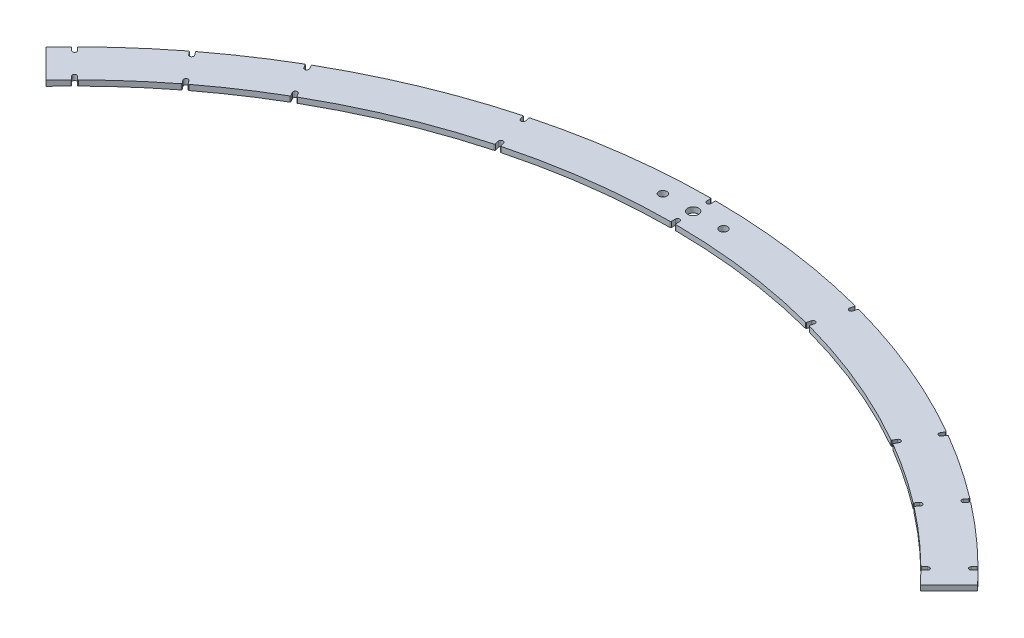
ISO-10303-21;
HEADER;
FILE_DESCRIPTION(('STEP AP214'),'2;1');
FILE_NAME('part.step','',(''),(''),'','','');
FILE_SCHEMA(('AUTOMOTIVE_DESIGN { 1 0 10303 214 1 1 1 1 }'));
ENDSEC;
DATA;
#1=APPLICATION_CONTEXT('core data for automotive mechanical design processes');
#2=APPLICATION_PROTOCOL_DEFINITION('international standard','automotive_design',2000,#1);
#3=PRODUCT_CONTEXT('',#1,'mechanical');
#4=PRODUCT('Part','Part','',(#3));
#5=PRODUCT_RELATED_PRODUCT_CATEGORY('part','',(#4));
#6=PRODUCT_DEFINITION_FORMATION('','',#4);
#7=PRODUCT_DEFINITION_CONTEXT('part definition',#1,'design');
#8=PRODUCT_DEFINITION('design','',#6,#7);
#9=PRODUCT_DEFINITION_SHAPE('','',#8);
#10=(LENGTH_UNIT() NAMED_UNIT(*) SI_UNIT(.MILLI.,.METRE.));
#11=(NAMED_UNIT(*) PLANE_ANGLE_UNIT() SI_UNIT($,.RADIAN.));
#12=(NAMED_UNIT(*) SI_UNIT($,.STERADIAN.) SOLID_ANGLE_UNIT());
#13=UNCERTAINTY_MEASURE_WITH_UNIT(LENGTH_MEASURE(1.E-05),#10,'distance_accuracy_value','');
#14=(GEOMETRIC_REPRESENTATION_CONTEXT(3) GLOBAL_UNCERTAINTY_ASSIGNED_CONTEXT((#13)) GLOBAL_UNIT_ASSIGNED_CONTEXT((#10,
#11,#12)) REPRESENTATION_CONTEXT('',''));
#15=CARTESIAN_POINT('',(0.,0.,0.));
#16=DIRECTION('',(0.,0.,1.));
#17=DIRECTION('',(1.,0.,0.));
#18=AXIS2_PLACEMENT_3D('',#15,#16,#17);
#19=CARTESIAN_POINT('',(1719.14886574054,4.,1695.44577037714));
#20=DIRECTION('',(0.,1.,0.));
#21=DIRECTION('',(0.,0.,-1.));
#22=AXIS2_PLACEMENT_3D('',#19,#20,#21);
#23=PLANE('',#22);
#24=CARTESIAN_POINT('',(1696.64886573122,4.,1236.52826204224));
#25=DIRECTION('',(0.,-1.,0.));
#26=DIRECTION('',(0.,0.,-1.));
#27=AXIS2_PLACEMENT_3D('',#24,#25,#26);
#28=CIRCLE('',#27,3.00000000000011);
#29=CARTESIAN_POINT('',(1696.64886573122,4.,1233.52826204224));
#30=VERTEX_POINT('',#29);
#31=EDGE_CURVE('E3017',#30,#30,#28,.T.);
#32=ORIENTED_EDGE('',*,*,#31,.T.);
#33=EDGE_LOOP('',(#32));
#34=FACE_BOUND('',#33,.T.);
#35=CARTESIAN_POINT('',(1719.14886574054,4.,1695.44577037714));
#36=DIRECTION('',(0.,-1.,0.));
#37=DIRECTION('',(0.,0.,-1.));
#38=AXIS2_PLACEMENT_3D('',#35,#36,#37);
#39=CIRCLE('',#38,473.917508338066);
#40=CARTESIAN_POINT('',(1373.59987739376,4.,1371.10998548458));
#41=VERTEX_POINT('',#40);
#42=CARTESIAN_POINT('',(1382.55538624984,4.,1361.82527599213));
#43=VERTEX_POINT('',#42);
#44=EDGE_CURVE('E1091',#41,#43,#39,.T.);
#45=ORIENTED_EDGE('',*,*,#44,.F.);
#46=DIRECTION('',(-0.707106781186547,0.,-0.707106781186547));
#47=VECTOR('',#46,1.);
#48=CARTESIAN_POINT('',(1373.59987739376,4.,1371.10998548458));
#49=LINE('',#48,#47);
#50=CARTESIAN_POINT('',(1394.82443362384,4.,1392.33454171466));
#51=VERTEX_POINT('',#50);
#52=EDGE_CURVE('E753',#51,#41,#49,.T.);
#53=ORIENTED_EDGE('',*,*,#52,.F.);
#54=CARTESIAN_POINT('',(1719.14886574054,4.,1695.44577037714));
#55=DIRECTION('',(0.,1.,0.));
#56=DIRECTION('',(0.,0.,-1.));
#57=AXIS2_PLACEMENT_3D('',#54,#55,#56);
#58=CIRCLE('',#57,443.917508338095);
#59=CARTESIAN_POINT('',(1403.77203611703,4.,1383.0354479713));
#60=VERTEX_POINT('',#59);
#61=EDGE_CURVE('E734',#60,#51,#58,.T.);
#62=ORIENTED_EDGE('',*,*,#61,.F.);
#63=CARTESIAN_POINT('',(1403.41681603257,4.,1382.68356916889));
#64=DIRECTION('',(0.,-1.,0.));
#65=DIRECTION('',(0.,0.,-1.));
#66=AXIS2_PLACEMENT_3D('',#63,#64,#65);
#67=CIRCLE('',#66,0.499999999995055);
#68=CARTESIAN_POINT('',(1403.77036942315,4.,1382.33001577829));
#69=VERTEX_POINT('',#68);
#70=EDGE_CURVE('E744',#69,#60,#67,.T.);
#71=ORIENTED_EDGE('',*,*,#70,.F.);
#72=DIRECTION('',(0.707106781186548,0.,0.707106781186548));
#73=VECTOR('',#72,1.);
#74=CARTESIAN_POINT('',(1401.71432776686,4.,1380.273974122));
#75=LINE('',#74,#73);
#76=CARTESIAN_POINT('',(1401.71432776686,4.,1380.273974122));
#77=VERTEX_POINT('',#76);
#78=EDGE_CURVE('E749',#77,#69,#75,.T.);
#79=ORIENTED_EDGE('',*,*,#78,.F.);
#80=CARTESIAN_POINT('',(1402.84762224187,4.,1379.14452689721));
#81=DIRECTION('',(0.,1.,0.));
#82=DIRECTION('',(0.,0.,-1.));
#83=AXIS2_PLACEMENT_3D('',#80,#81,#82);
#84=CIRCLE('',#83,1.60000231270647);
#85=CARTESIAN_POINT('',(1403.97706946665,4.,1378.0112324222));
#86=VERTEX_POINT('',#85);
#87=EDGE_CURVE('E1637',#86,#77,#84,.T.);
#88=ORIENTED_EDGE('',*,*,#87,.F.);
#89=DIRECTION('',(-0.707106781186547,0.,-0.707106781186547));
#90=VECTOR('',#89,1.);
#91=CARTESIAN_POINT('',(1403.97706946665,4.,1378.0112324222));
#92=LINE('',#91,#90);
#93=CARTESIAN_POINT('',(1406.03311112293,4.,1380.06727407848));
#94=VERTEX_POINT('',#93);
#95=EDGE_CURVE('E1634',#94,#86,#92,.T.);
#96=ORIENTED_EDGE('',*,*,#95,.F.);
#97=CARTESIAN_POINT('',(1406.38666451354,4.,1379.71372068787));
#98=DIRECTION('',(0.,-1.,0.));
#99=DIRECTION('',(0.,0.,-1.));
#100=AXIS2_PLACEMENT_3D('',#97,#98,#99);
#101=CIRCLE('',#100,0.500000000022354);
#102=CARTESIAN_POINT('',(1406.73854331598,4.,1380.06894077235));
#103=VERTEX_POINT('',#102);
#104=EDGE_CURVE('E1631',#103,#94,#101,.T.);
#105=ORIENTED_EDGE('',*,*,#104,.F.);
#106=CARTESIAN_POINT('',(1719.14886574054,4.,1695.44577037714));
#107=DIRECTION('',(0.,1.,0.));
#108=DIRECTION('',(0.,0.,-1.));
#109=AXIS2_PLACEMENT_3D('',#106,#107,#108);
#110=CIRCLE('',#109,443.917508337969);
#111=CARTESIAN_POINT('',(1447.24785840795,4.,1344.5432249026));
#112=VERTEX_POINT('',#111);
#113=EDGE_CURVE('E1628',#112,#103,#110,.T.);
#114=ORIENTED_EDGE('',*,*,#113,.F.);
#115=CARTESIAN_POINT('',(1446.94160668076,4.,1344.1479909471));
#116=DIRECTION('',(0.,-1.,0.));
#117=DIRECTION('',(0.,0.,-1.));
#118=AXIS2_PLACEMENT_3D('',#115,#116,#117);
#119=CIRCLE('',#118,0.499999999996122);
#120=CARTESIAN_POINT('',(1447.3382833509,4.,1343.84361023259));
#121=VERTEX_POINT('',#120);
#122=EDGE_CURVE('E1625',#121,#112,#119,.T.);
#123=ORIENTED_EDGE('',*,*,#122,.F.);
#124=DIRECTION('',(0.60876142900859,0.,0.793353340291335));
#125=VECTOR('',#124,1.);
#126=CARTESIAN_POINT('',(1445.56819870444,4.,1341.53679100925));
#127=LINE('',#126,#125);
#128=CARTESIAN_POINT('',(1445.56819870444,4.,1341.53679100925));
#129=VERTEX_POINT('',#128);
#130=EDGE_CURVE('E1622',#129,#121,#127,.T.);
#131=ORIENTED_EDGE('',*,*,#130,.F.);
#132=CARTESIAN_POINT('',(1446.83922013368,4.,1340.56493097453));
#133=DIRECTION('',(0.,1.,0.));
#134=DIRECTION('',(0.,0.,-1.));
#135=AXIS2_PLACEMENT_3D('',#132,#133,#134);
#136=CIRCLE('',#135,1.60000231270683);
#137=CARTESIAN_POINT('',(1448.10692939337,4.,1339.58875443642));
#138=VERTEX_POINT('',#137);
#139=EDGE_CURVE('E1619',#138,#129,#136,.T.);
#140=ORIENTED_EDGE('',*,*,#139,.F.);
#141=DIRECTION('',(-0.608761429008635,0.,-0.793353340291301));
#142=VECTOR('',#141,1.);
#143=CARTESIAN_POINT('',(1448.10692939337,4.,1339.58875443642));
#144=LINE('',#143,#142);
#145=CARTESIAN_POINT('',(1449.87701403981,4.,1341.89557365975));
#146=VERTEX_POINT('',#145);
#147=EDGE_CURVE('E1616',#146,#138,#144,.T.);
#148=ORIENTED_EDGE('',*,*,#147,.F.);
#149=CARTESIAN_POINT('',(1450.27369070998,4.,1341.59119294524));
#150=DIRECTION('',(0.,-1.,0.));
#151=DIRECTION('',(0.,0.,-1.));
#152=AXIS2_PLACEMENT_3D('',#149,#150,#151);
#153=CIRCLE('',#152,0.500000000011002);
#154=CARTESIAN_POINT('',(1450.57619361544,4.,1341.98930347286));
#155=VERTEX_POINT('',#154);
#156=EDGE_CURVE('E1613',#155,#146,#153,.T.);
#157=ORIENTED_EDGE('',*,*,#156,.F.);
#158=CARTESIAN_POINT('',(1719.14886574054,4.,1695.44577037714));
#159=DIRECTION('',(0.,1.,0.));
#160=DIRECTION('',(0.,0.,-1.));
#161=AXIS2_PLACEMENT_3D('',#158,#159,#160);
#162=CIRCLE('',#161,443.917508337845);
#163=CARTESIAN_POINT('',(1495.37598231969,4.,1312.05504167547));
#164=VERTEX_POINT('',#163);
#165=EDGE_CURVE('E1610',#164,#155,#162,.T.);
#166=ORIENTED_EDGE('',*,*,#165,.F.);
#167=CARTESIAN_POINT('',(1495.12393900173,4.,1311.62321512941));
#168=DIRECTION('',(0.,-1.,0.));
#169=DIRECTION('',(0.,0.,-1.));
#170=AXIS2_PLACEMENT_3D('',#167,#168,#169);
#171=CIRCLE('',#170,0.500000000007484);
#172=CARTESIAN_POINT('',(1495.55695170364,4.,1311.37321512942));
#173=VERTEX_POINT('',#172);
#174=EDGE_CURVE('E1607',#173,#164,#171,.T.);
#175=ORIENTED_EDGE('',*,*,#174,.F.);
#176=DIRECTION('',(0.500000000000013,0.,0.866025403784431));
#177=VECTOR('',#176,1.);
#178=CARTESIAN_POINT('',(1494.10311070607,4.,1308.85508865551));
#179=LINE('',#178,#177);
#180=CARTESIAN_POINT('',(1494.10311070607,4.,1308.85508865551));
#181=VERTEX_POINT('',#180);
#182=EDGE_CURVE('E1604',#181,#173,#179,.T.);
#183=ORIENTED_EDGE('',*,*,#182,.F.);
#184=CARTESIAN_POINT('',(1495.49011156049,4.,1308.0574446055));
#185=DIRECTION('',(0.,1.,0.));
#186=DIRECTION('',(0.,0.,-1.));
#187=AXIS2_PLACEMENT_3D('',#184,#185,#186);
#188=CIRCLE('',#187,1.60000231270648);
#189=CARTESIAN_POINT('',(1496.87439199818,4.,1307.25508865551));
#190=VERTEX_POINT('',#189);
#191=EDGE_CURVE('E1601',#190,#181,#188,.T.);
#192=ORIENTED_EDGE('',*,*,#191,.F.);
#193=DIRECTION('',(-0.500000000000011,0.,-0.866025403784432));
#194=VECTOR('',#193,1.);
#195=CARTESIAN_POINT('',(1496.87439199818,4.,1307.25508865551));
#196=LINE('',#195,#194);
#197=CARTESIAN_POINT('',(1498.32823299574,4.,1309.7732151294));
#198=VERTEX_POINT('',#197);
#199=EDGE_CURVE('E1598',#198,#190,#196,.T.);
#200=ORIENTED_EDGE('',*,*,#199,.F.);
#201=CARTESIAN_POINT('',(1498.76124569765,4.,1309.52321512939));
#202=DIRECTION('',(0.,-1.,0.));
#203=DIRECTION('',(0.,0.,-1.));
#204=AXIS2_PLACEMENT_3D('',#201,#202,#203);
#205=CIRCLE('',#204,0.500000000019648);
#206=CARTESIAN_POINT('',(1499.00919679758,4.,1309.95740431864));
#207=VERTEX_POINT('',#206);
#208=EDGE_CURVE('E1595',#207,#198,#205,.T.);
#209=ORIENTED_EDGE('',*,*,#208,.F.);
#210=CARTESIAN_POINT('',(1719.14886574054,4.,1695.44577037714));
#211=DIRECTION('',(0.,1.,0.));
#212=DIRECTION('',(0.,0.,-1.));
#213=AXIS2_PLACEMENT_3D('',#210,#211,#212);
#214=CIRCLE('',#213,443.917508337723);
#215=CARTESIAN_POINT('',(1602.22968072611,4.,1267.20207995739));
#216=VERTEX_POINT('',#215);
#217=EDGE_CURVE('E1592',#216,#207,#214,.T.);
#218=ORIENTED_EDGE('',*,*,#217,.F.);
#219=CARTESIAN_POINT('',(1602.09799051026,4.,1266.71973393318));
#220=DIRECTION('',(0.,-1.,0.));
#221=DIRECTION('',(0.,0.,-1.));
#222=AXIS2_PLACEMENT_3D('',#219,#220,#221);
#223=CIRCLE('',#222,0.500000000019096);
#224=CARTESIAN_POINT('',(1602.58095342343,4.,1266.59032441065));
#225=VERTEX_POINT('',#224);
#226=EDGE_CURVE('E1589',#225,#216,#223,.T.);
#227=ORIENTED_EDGE('',*,*,#226,.F.);
#228=DIRECTION('',(0.258819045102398,0.,0.965925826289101));
#229=VECTOR('',#228,1.);
#230=CARTESIAN_POINT('',(1601.82838994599,4.,1263.78171927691));
#231=LINE('',#230,#229);
#232=CARTESIAN_POINT('',(1601.82838994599,4.,1263.78171927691));
#233=VERTEX_POINT('',#232);
#234=EDGE_CURVE('E1586',#233,#225,#231,.T.);
#235=ORIENTED_EDGE('',*,*,#234,.F.);
#236=CARTESIAN_POINT('',(1603.37457536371,4.,1263.37023652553));
#237=DIRECTION('',(0.,1.,0.));
#238=DIRECTION('',(0.,0.,-1.));
#239=AXIS2_PLACEMENT_3D('',#236,#237,#238);
#240=CIRCLE('',#239,1.60000231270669);
#241=CARTESIAN_POINT('',(1604.91935259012,4.,1262.95349833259));
#242=VERTEX_POINT('',#241);
#243=EDGE_CURVE('E1583',#242,#233,#240,.T.);
#244=ORIENTED_EDGE('',*,*,#243,.F.);
#245=DIRECTION('',(-0.258819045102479,0.,-0.965925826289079));
#246=VECTOR('',#245,1.);
#247=CARTESIAN_POINT('',(1604.91935259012,4.,1262.95349833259));
#248=LINE('',#247,#246);
#249=CARTESIAN_POINT('',(1605.67191606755,4.,1265.7621034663));
#250=VERTEX_POINT('',#249);
#251=EDGE_CURVE('E1580',#250,#242,#248,.T.);
#252=ORIENTED_EDGE('',*,*,#251,.F.);
#253=CARTESIAN_POINT('',(1606.1548789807,4.,1265.63269394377));
#254=DIRECTION('',(0.,-1.,0.));
#255=DIRECTION('',(0.,0.,-1.));
#256=AXIS2_PLACEMENT_3D('',#253,#254,#255);
#257=CIRCLE('',#256,0.499999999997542);
#258=CARTESIAN_POINT('',(1606.2820049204,4.,1266.11626296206));
#259=VERTEX_POINT('',#258);
#260=EDGE_CURVE('E1577',#259,#250,#257,.T.);
#261=ORIENTED_EDGE('',*,*,#260,.F.);
#262=CARTESIAN_POINT('',(1719.14886574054,4.,1695.44577037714));
#263=DIRECTION('',(0.,1.,0.));
#264=DIRECTION('',(0.,0.,-1.));
#265=AXIS2_PLACEMENT_3D('',#262,#263,#264);
#266=CIRCLE('',#265,443.917508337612);
#267=CARTESIAN_POINT('',(1717.05122837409,4.,1251.53321803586));
#268=VERTEX_POINT('',#267);
#269=EDGE_CURVE('E1574',#268,#259,#266,.T.);
#270=ORIENTED_EDGE('',*,*,#269,.F.);
#271=CARTESIAN_POINT('',(1717.04886573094,4.,1251.03322361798));
#272=DIRECTION('',(0.,-1.,0.));
#273=DIRECTION('',(0.,0.,-1.));
#274=AXIS2_PLACEMENT_3D('',#271,#272,#273);
#275=CIRCLE('',#274,0.499999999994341);
#276=CARTESIAN_POINT('',(1717.54886573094,4.,1251.03322361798));
#277=VERTEX_POINT('',#276);
#278=EDGE_CURVE('E1571',#277,#268,#275,.T.);
#279=ORIENTED_EDGE('',*,*,#278,.F.);
#280=DIRECTION('',(0.,0.,1.));
#281=VECTOR('',#280,1.);
#282=CARTESIAN_POINT('',(1717.54886573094,4.,1248.12554162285));
#283=LINE('',#282,#281);
#284=CARTESIAN_POINT('',(1717.54886573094,4.,1248.12554162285));
#285=VERTEX_POINT('',#284);
#286=EDGE_CURVE('E1568',#285,#277,#283,.T.);
#287=ORIENTED_EDGE('',*,*,#286,.F.);
#288=CARTESIAN_POINT('',(1719.14886573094,4.,1248.12826203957));
#289=DIRECTION('',(0.,1.,0.));
#290=DIRECTION('',(0.,0.,-1.));
#291=AXIS2_PLACEMENT_3D('',#288,#289,#290);
#292=CIRCLE('',#291,1.60000231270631);
#293=CARTESIAN_POINT('',(1720.74886573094,4.,1248.12554162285));
#294=VERTEX_POINT('',#293);
#295=EDGE_CURVE('E1565',#294,#285,#292,.T.);
#296=ORIENTED_EDGE('',*,*,#295,.F.);
#297=DIRECTION('',(0.,0.,-1.));
#298=VECTOR('',#297,1.);
#299=CARTESIAN_POINT('',(1720.74886573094,4.,1248.12554162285));
#300=LINE('',#299,#298);
#301=CARTESIAN_POINT('',(1720.74886573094,4.,1251.03322361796));
#302=VERTEX_POINT('',#301);
#303=EDGE_CURVE('E1562',#302,#294,#300,.T.);
#304=ORIENTED_EDGE('',*,*,#303,.F.);
#305=CARTESIAN_POINT('',(1721.24886573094,4.,1251.03322362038));
#306=DIRECTION('',(0.,-1.,0.));
#307=DIRECTION('',(0.,0.,-1.));
#308=AXIS2_PLACEMENT_3D('',#305,#306,#307);
#309=CIRCLE('',#308,0.49999999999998);
#310=CARTESIAN_POINT('',(1721.24650308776,4.,1251.53321803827));
#311=VERTEX_POINT('',#310);
#312=EDGE_CURVE('E1559',#311,#302,#309,.T.);
#313=ORIENTED_EDGE('',*,*,#312,.F.);
#314=CARTESIAN_POINT('',(1719.14886574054,4.,1695.44577037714));
#315=DIRECTION('',(0.,1.,0.));
#316=DIRECTION('',(0.,0.,-1.));
#317=AXIS2_PLACEMENT_3D('',#314,#315,#316);
#318=CIRCLE('',#317,443.917508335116);
#319=CARTESIAN_POINT('',(1832.01572654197,4.,1266.11626295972));
#320=VERTEX_POINT('',#319);
#321=EDGE_CURVE('E1556',#320,#311,#318,.T.);
#322=ORIENTED_EDGE('',*,*,#321,.F.);
#323=CARTESIAN_POINT('',(1832.14285248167,4.,1265.63269394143));
#324=DIRECTION('',(0.,-1.,0.));
#325=DIRECTION('',(0.,0.,-1.));
#326=AXIS2_PLACEMENT_3D('',#323,#324,#325);
#327=CIRCLE('',#326,0.499999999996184);
#328=CARTESIAN_POINT('',(1832.62581539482,4.,1265.76210346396));
#329=VERTEX_POINT('',#328);
#330=EDGE_CURVE('E1553',#329,#320,#327,.T.);
#331=ORIENTED_EDGE('',*,*,#330,.F.);
#332=DIRECTION('',(-0.258819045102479,0.,0.965925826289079));
#333=VECTOR('',#332,1.);
#334=CARTESIAN_POINT('',(1833.37837887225,4.,1262.95349833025));
#335=LINE('',#334,#333);
#336=CARTESIAN_POINT('',(1833.37837887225,4.,1262.95349833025));
#337=VERTEX_POINT('',#336);
#338=EDGE_CURVE('E1550',#337,#329,#335,.T.);
#339=ORIENTED_EDGE('',*,*,#338,.F.);
#340=CARTESIAN_POINT('',(1834.92315609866,4.,1263.37023652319));
#341=DIRECTION('',(0.,1.,0.));
#342=DIRECTION('',(0.,0.,-1.));
#343=AXIS2_PLACEMENT_3D('',#340,#341,#342);
#344=CIRCLE('',#343,1.60000231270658);
#345=CARTESIAN_POINT('',(1836.46934151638,4.,1263.78171927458));
#346=VERTEX_POINT('',#345);
#347=EDGE_CURVE('E1547',#346,#337,#344,.T.);
#348=ORIENTED_EDGE('',*,*,#347,.F.);
#349=DIRECTION('',(0.258819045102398,0.,-0.965925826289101));
#350=VECTOR('',#349,1.);
#351=CARTESIAN_POINT('',(1836.46934151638,4.,1263.78171927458));
#352=LINE('',#351,#350);
#353=CARTESIAN_POINT('',(1835.71677803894,4.,1266.59032440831));
#354=VERTEX_POINT('',#353);
#355=EDGE_CURVE('E1544',#354,#346,#352,.T.);
#356=ORIENTED_EDGE('',*,*,#355,.F.);
#357=CARTESIAN_POINT('',(1836.19974095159,4.,1266.71973393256));
#358=DIRECTION('',(0.,-1.,0.));
#359=DIRECTION('',(0.,0.,-1.));
#360=AXIS2_PLACEMENT_3D('',#357,#358,#359);
#361=CIRCLE('',#360,0.499999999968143);
#362=CARTESIAN_POINT('',(1836.06805073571,4.,1267.20207995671));
#363=VERTEX_POINT('',#362);
#364=EDGE_CURVE('E1541',#363,#354,#361,.T.);
#365=ORIENTED_EDGE('',*,*,#364,.F.);
#366=CARTESIAN_POINT('',(1719.14886574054,4.,1695.44577037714));
#367=DIRECTION('',(0.,1.,0.));
#368=DIRECTION('',(0.,0.,-1.));
#369=AXIS2_PLACEMENT_3D('',#366,#367,#368);
#370=CIRCLE('',#369,443.917508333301);
#371=CARTESIAN_POINT('',(1939.28853466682,4.,1309.9574043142));
#372=VERTEX_POINT('',#371);
#373=EDGE_CURVE('E1538',#372,#363,#370,.T.);
#374=ORIENTED_EDGE('',*,*,#373,.F.);
#375=CARTESIAN_POINT('',(1939.53648576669,4.,1309.52321512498));
#376=DIRECTION('',(0.,-1.,0.));
#377=DIRECTION('',(0.,0.,-1.));
#378=AXIS2_PLACEMENT_3D('',#375,#376,#377);
#379=CIRCLE('',#378,0.499999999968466);
#380=CARTESIAN_POINT('',(1939.96949846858,4.,1309.77321512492));
#381=VERTEX_POINT('',#380);
#382=EDGE_CURVE('E1535',#381,#372,#379,.T.);
#383=ORIENTED_EDGE('',*,*,#382,.F.);
#384=DIRECTION('',(-0.500000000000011,0.,0.866025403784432));
#385=VECTOR('',#384,1.);
#386=CARTESIAN_POINT('',(1941.42333946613,4.,1307.25508865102));
#387=LINE('',#386,#385);
#388=CARTESIAN_POINT('',(1941.42333946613,4.,1307.25508865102));
#389=VERTEX_POINT('',#388);
#390=EDGE_CURVE('E1532',#389,#381,#387,.T.);
#391=ORIENTED_EDGE('',*,*,#390,.F.);
#392=CARTESIAN_POINT('',(1942.80761990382,4.,1308.05744460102));
#393=DIRECTION('',(0.,1.,0.));
#394=DIRECTION('',(0.,0.,-1.));
#395=AXIS2_PLACEMENT_3D('',#392,#393,#394);
#396=CIRCLE('',#395,1.60000231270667);
#397=CARTESIAN_POINT('',(1944.19462075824,4.,1308.85508865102));
#398=VERTEX_POINT('',#397);
#399=EDGE_CURVE('E1529',#398,#389,#396,.T.);
#400=ORIENTED_EDGE('',*,*,#399,.F.);
#401=DIRECTION('',(0.49999999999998,0.,-0.86602540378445));
#402=VECTOR('',#401,1.);
#403=CARTESIAN_POINT('',(1944.19462075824,4.,1308.85508865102));
#404=LINE('',#403,#402);
#405=CARTESIAN_POINT('',(1942.74077976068,4.,1311.37321512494));
#406=VERTEX_POINT('',#405);
#407=EDGE_CURVE('E1526',#406,#398,#404,.T.);
#408=ORIENTED_EDGE('',*,*,#407,.F.);
#409=CARTESIAN_POINT('',(1943.17379246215,4.,1311.62321512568));
#410=DIRECTION('',(0.,-1.,0.));
#411=DIRECTION('',(0.,0.,-1.));
#412=AXIS2_PLACEMENT_3D('',#409,#410,#411);
#413=CIRCLE('',#412,0.500000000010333);
#414=CARTESIAN_POINT('',(1942.92174914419,4.,1312.05504167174));
#415=VERTEX_POINT('',#414);
#416=EDGE_CURVE('E1523',#415,#406,#413,.T.);
#417=ORIENTED_EDGE('',*,*,#416,.F.);
#418=CARTESIAN_POINT('',(1719.14886574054,4.,1695.44577037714));
#419=DIRECTION('',(0.,1.,0.));
#420=DIRECTION('',(0.,0.,-1.));
#421=AXIS2_PLACEMENT_3D('',#418,#419,#420);
#422=CIRCLE('',#421,443.917508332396);
#423=CARTESIAN_POINT('',(1987.72153785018,4.,1341.98930346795));
#424=VERTEX_POINT('',#423);
#425=EDGE_CURVE('E1520',#424,#415,#422,.T.);
#426=ORIENTED_EDGE('',*,*,#425,.F.);
#427=CARTESIAN_POINT('',(1988.02404075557,4.,1341.59119294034));
#428=DIRECTION('',(0.,-1.,0.));
#429=DIRECTION('',(0.,0.,-1.));
#430=AXIS2_PLACEMENT_3D('',#427,#428,#429);
#431=CIRCLE('',#430,0.499999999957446);
#432=CARTESIAN_POINT('',(1988.42071742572,4.,1341.89557365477));
#433=VERTEX_POINT('',#432);
#434=EDGE_CURVE('E1517',#433,#424,#431,.T.);
#435=ORIENTED_EDGE('',*,*,#434,.F.);
#436=DIRECTION('',(-0.608761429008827,0.,0.793353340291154));
#437=VECTOR('',#436,1.);
#438=CARTESIAN_POINT('',(1990.19080207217,4.,1339.58875443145));
#439=LINE('',#438,#437);
#440=CARTESIAN_POINT('',(1990.19080207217,4.,1339.58875443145));
#441=VERTEX_POINT('',#440);
#442=EDGE_CURVE('E1514',#441,#433,#439,.T.);
#443=ORIENTED_EDGE('',*,*,#442,.F.);
#444=CARTESIAN_POINT('',(1991.46016741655,4.,1340.56277271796));
#445=DIRECTION('',(0.,1.,0.));
#446=DIRECTION('',(0.,0.,-1.));
#447=AXIS2_PLACEMENT_3D('',#444,#445,#446);
#448=CIRCLE('',#447,1.60000000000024);
#449=CARTESIAN_POINT('',(1992.72953276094,4.,1341.53679100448));
#450=VERTEX_POINT('',#449);
#451=EDGE_CURVE('E1511',#450,#441,#448,.T.);
#452=ORIENTED_EDGE('',*,*,#451,.F.);
#453=DIRECTION('',(0.608761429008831,0.,-0.793353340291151));
#454=VECTOR('',#453,1.);
#455=CARTESIAN_POINT('',(1992.72953276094,4.,1341.53679100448));
#456=LINE('',#455,#454);
#457=CARTESIAN_POINT('',(1990.95944811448,4.,1343.84361022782));
#458=VERTEX_POINT('',#457);
#459=EDGE_CURVE('E1508',#458,#450,#456,.T.);
#460=ORIENTED_EDGE('',*,*,#459,.F.);
#461=CARTESIAN_POINT('',(1991.35612478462,4.,1344.14799094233));
#462=DIRECTION('',(0.,-1.,0.));
#463=DIRECTION('',(0.,0.,-1.));
#464=AXIS2_PLACEMENT_3D('',#461,#462,#463);
#465=CIRCLE('',#464,0.499999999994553);
#466=CARTESIAN_POINT('',(1991.04987305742,4.,1344.54322489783));
#467=VERTEX_POINT('',#466);
#468=EDGE_CURVE('E1505',#467,#458,#465,.T.);
#469=ORIENTED_EDGE('',*,*,#468,.F.);
#470=CARTESIAN_POINT('',(1719.14886574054,4.,1695.44577037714));
#471=DIRECTION('',(0.,1.,0.));
#472=DIRECTION('',(0.,0.,-1.));
#473=AXIS2_PLACEMENT_3D('',#470,#471,#472);
#474=CIRCLE('',#473,443.917508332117);
#475=CARTESIAN_POINT('',(2031.55918815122,4.,1380.06894076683));
#476=VERTEX_POINT('',#475);
#477=EDGE_CURVE('E1502',#476,#467,#474,.T.);
#478=ORIENTED_EDGE('',*,*,#477,.F.);
#479=CARTESIAN_POINT('',(2031.91106695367,4.,1379.71372068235));
#480=DIRECTION('',(0.,-1.,0.));
#481=DIRECTION('',(0.,0.,-1.));
#482=AXIS2_PLACEMENT_3D('',#479,#480,#481);
#483=CIRCLE('',#482,0.500000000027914);
#484=CARTESIAN_POINT('',(2032.26462034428,4.,1380.06727407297));
#485=VERTEX_POINT('',#484);
#486=EDGE_CURVE('E1499',#485,#476,#483,.T.);
#487=ORIENTED_EDGE('',*,*,#486,.F.);
#488=DIRECTION('',(-0.707106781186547,0.,0.707106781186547));
#489=VECTOR('',#488,1.);
#490=CARTESIAN_POINT('',(2034.32066200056,4.,1378.01123241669));
#491=LINE('',#490,#489);
#492=CARTESIAN_POINT('',(2034.32066200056,4.,1378.01123241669));
#493=VERTEX_POINT('',#492);
#494=EDGE_CURVE('E1496',#493,#485,#491,.T.);
#495=ORIENTED_EDGE('',*,*,#494,.F.);
#496=CARTESIAN_POINT('',(2035.45203285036,4.,1379.14260326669));
#497=DIRECTION('',(0.,1.,0.));
#498=DIRECTION('',(0.,0.,-1.));
#499=AXIS2_PLACEMENT_3D('',#496,#497,#498);
#500=CIRCLE('',#499,1.59999999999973);
#501=CARTESIAN_POINT('',(2036.58340370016,4.,1380.27397411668));
#502=VERTEX_POINT('',#501);
#503=EDGE_CURVE('E1493',#502,#493,#500,.T.);
#504=ORIENTED_EDGE('',*,*,#503,.F.);
#505=DIRECTION('',(0.707106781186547,0.,-0.707106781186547));
#506=VECTOR('',#505,1.);
#507=CARTESIAN_POINT('',(2036.58340370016,4.,1380.27397411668));
#508=LINE('',#507,#506);
#509=CARTESIAN_POINT('',(2034.52736204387,4.,1382.33001577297));
#510=VERTEX_POINT('',#509);
#511=EDGE_CURVE('E1490',#510,#502,#508,.T.);
#512=ORIENTED_EDGE('',*,*,#511,.F.);
#513=CARTESIAN_POINT('',(2034.88091543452,4.,1382.68356916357));
#514=DIRECTION('',(0.,-1.,0.));
#515=DIRECTION('',(0.,0.,-1.));
#516=AXIS2_PLACEMENT_3D('',#513,#514,#515);
#517=CIRCLE('',#516,0.500000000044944);
#518=CARTESIAN_POINT('',(2034.52569535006,4.,1383.03544796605));
#519=VERTEX_POINT('',#518);
#520=EDGE_CURVE('E1487',#519,#510,#517,.T.);
#521=ORIENTED_EDGE('',*,*,#520,.F.);
#522=CARTESIAN_POINT('',(1719.14886574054,4.,1695.44577037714));
#523=DIRECTION('',(0.,1.,0.));
#524=DIRECTION('',(0.,0.,-1.));
#525=AXIS2_PLACEMENT_3D('',#522,#523,#524);
#526=CIRCLE('',#525,443.917508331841);
#527=CARTESIAN_POINT('',(2043.47329784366,4.,1392.33454170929));
#528=VERTEX_POINT('',#527);
#529=EDGE_CURVE('E1484',#528,#519,#526,.T.);
#530=ORIENTED_EDGE('',*,*,#529,.F.);
#531=DIRECTION('',(-0.707106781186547,0.,0.707106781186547));
#532=VECTOR('',#531,1.);
#533=CARTESIAN_POINT('',(2043.47329784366,4.,1392.33454170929));
#534=LINE('',#533,#532);
#535=CARTESIAN_POINT('',(2064.69785407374,4.,1371.10998547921));
#536=VERTEX_POINT('',#535);
#537=EDGE_CURVE('E1481',#536,#528,#534,.T.);
#538=ORIENTED_EDGE('',*,*,#537,.F.);
#539=CARTESIAN_POINT('',(1719.14886574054,4.,1695.44577037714));
#540=DIRECTION('',(0.,-1.,0.));
#541=DIRECTION('',(0.,0.,-1.));
#542=AXIS2_PLACEMENT_3D('',#539,#540,#541);
#543=CIRCLE('',#542,473.917508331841);
#544=CARTESIAN_POINT('',(2055.74234521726,4.,1361.82527598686));
#545=VERTEX_POINT('',#544);
#546=EDGE_CURVE('E1478',#545,#536,#543,.T.);
#547=ORIENTED_EDGE('',*,*,#546,.F.);
#548=CARTESIAN_POINT('',(2055.387227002,4.,1362.17725759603));
#549=DIRECTION('',(0.,-1.,0.));
#550=DIRECTION('',(0.,0.,-1.));
#551=AXIS2_PLACEMENT_3D('',#548,#549,#550);
#552=CIRCLE('',#551,0.500000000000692);
#553=CARTESIAN_POINT('',(2055.03367361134,4.,1361.82370420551));
#554=VERTEX_POINT('',#553);
#555=EDGE_CURVE('E1475',#554,#545,#552,.T.);
#556=ORIENTED_EDGE('',*,*,#555,.F.);
#557=DIRECTION('',(0.707106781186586,0.,-0.707106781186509));
#558=VECTOR('',#557,1.);
#559=CARTESIAN_POINT('',(2052.98443377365,4.,1363.87294404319));
#560=LINE('',#559,#558);
#561=CARTESIAN_POINT('',(2052.98443377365,4.,1363.87294404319));
#562=VERTEX_POINT('',#561);
#563=EDGE_CURVE('E1472',#562,#554,#560,.T.);
#564=ORIENTED_EDGE('',*,*,#563,.F.);
#565=CARTESIAN_POINT('',(2051.85498654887,4.,1362.73964956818));
#566=DIRECTION('',(0.,1.,0.));
#567=DIRECTION('',(0.,0.,-1.));
#568=AXIS2_PLACEMENT_3D('',#565,#566,#567);
#569=CIRCLE('',#568,1.60000231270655);
#570=CARTESIAN_POINT('',(2050.72169207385,4.,1361.6102023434));
#571=VERTEX_POINT('',#570);
#572=EDGE_CURVE('E1469',#571,#562,#569,.T.);
#573=ORIENTED_EDGE('',*,*,#572,.F.);
#574=DIRECTION('',(-0.707106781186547,0.,0.707106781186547));
#575=VECTOR('',#574,1.);
#576=CARTESIAN_POINT('',(2050.72169207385,4.,1361.6102023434));
#577=LINE('',#576,#575);
#578=CARTESIAN_POINT('',(2052.77093191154,4.,1359.56096250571));
#579=VERTEX_POINT('',#578);
#580=EDGE_CURVE('E1466',#579,#571,#577,.T.);
#581=ORIENTED_EDGE('',*,*,#580,.F.);
#582=CARTESIAN_POINT('',(2052.41737852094,4.,1359.20740911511));
#583=DIRECTION('',(0.,-1.,0.));
#584=DIRECTION('',(0.,0.,-1.));
#585=AXIS2_PLACEMENT_3D('',#582,#583,#584);
#586=CIRCLE('',#585,0.500000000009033);
#587=CARTESIAN_POINT('',(2052.7693601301,4.,1358.85229089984));
#588=VERTEX_POINT('',#587);
#589=EDGE_CURVE('E1463',#588,#579,#586,.T.);
#590=ORIENTED_EDGE('',*,*,#589,.F.);
#591=CARTESIAN_POINT('',(1719.14886574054,4.,1695.44577037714));
#592=DIRECTION('',(0.,-1.,0.));
#593=DIRECTION('',(0.,0.,-1.));
#594=AXIS2_PLACEMENT_3D('',#591,#592,#593);
#595=CIRCLE('',#594,473.917508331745);
#596=CARTESIAN_POINT('',(2009.3165285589,4.,1320.74518036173));
#597=VERTEX_POINT('',#596);
#598=EDGE_CURVE('E1460',#597,#588,#595,.T.);
#599=ORIENTED_EDGE('',*,*,#598,.F.);
#600=CARTESIAN_POINT('',(2009.01039124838,4.,1321.14050294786));
#601=DIRECTION('',(0.,-1.,0.));
#602=DIRECTION('',(0.,0.,-1.));
#603=AXIS2_PLACEMENT_3D('',#600,#601,#602);
#604=CIRCLE('',#603,0.500000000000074);
#605=CARTESIAN_POINT('',(2008.61371457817,4.,1320.83612223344));
#606=VERTEX_POINT('',#605);
#607=EDGE_CURVE('E1457',#606,#597,#604,.T.);
#608=ORIENTED_EDGE('',*,*,#607,.F.);
#609=DIRECTION('',(0.608761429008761,0.,-0.793353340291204));
#610=VECTOR('',#609,1.);
#611=CARTESIAN_POINT('',(2006.84948574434,4.,1323.1353100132));
#612=LINE('',#611,#610);
#613=CARTESIAN_POINT('',(2006.84948574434,4.,1323.1353100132));
#614=VERTEX_POINT('',#613);
#615=EDGE_CURVE('E1454',#614,#606,#612,.T.);
#616=ORIENTED_EDGE('',*,*,#615,.F.);
#617=CARTESIAN_POINT('',(2005.58177648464,4.,1322.15913347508));
#618=DIRECTION('',(0.,1.,0.));
#619=DIRECTION('',(0.,0.,-1.));
#620=AXIS2_PLACEMENT_3D('',#617,#618,#619);
#621=CIRCLE('',#620,1.60000231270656);
#622=CARTESIAN_POINT('',(2004.3107550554,4.,1321.18727344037));
#623=VERTEX_POINT('',#622);
#624=EDGE_CURVE('E1451',#623,#614,#621,.T.);
#625=ORIENTED_EDGE('',*,*,#624,.F.);
#626=DIRECTION('',(-0.608761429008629,0.,0.793353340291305));
#627=VECTOR('',#626,1.);
#628=CARTESIAN_POINT('',(2004.3107550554,4.,1321.18727344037));
#629=LINE('',#628,#627);
#630=CARTESIAN_POINT('',(2006.07498388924,4.,1318.88808566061));
#631=VERTEX_POINT('',#630);
#632=EDGE_CURVE('E1448',#631,#623,#629,.T.);
#633=ORIENTED_EDGE('',*,*,#632,.F.);
#634=CARTESIAN_POINT('',(2005.67830721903,4.,1318.58370494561));
#635=DIRECTION('',(0.,-1.,0.));
#636=DIRECTION('',(0.,0.,-1.));
#637=AXIS2_PLACEMENT_3D('',#634,#635,#636);
#638=CIRCLE('',#637,0.50000000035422);
#639=CARTESIAN_POINT('',(2005.98092534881,4.,1318.18568199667));
#640=VERTEX_POINT('',#639);
#641=EDGE_CURVE('E1445',#640,#631,#638,.T.);
#642=ORIENTED_EDGE('',*,*,#641,.F.);
#643=CARTESIAN_POINT('',(1719.14886574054,4.,1695.44577037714));
#644=DIRECTION('',(0.,-1.,0.));
#645=DIRECTION('',(0.,0.,-1.));
#646=AXIS2_PLACEMENT_3D('',#643,#644,#645);
#647=CIRCLE('',#646,473.917508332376);
#648=CARTESIAN_POINT('',(1957.92586274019,4.,1286.07631571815));
#649=VERTEX_POINT('',#648);
#650=EDGE_CURVE('E1442',#649,#640,#647,.T.);
#651=ORIENTED_EDGE('',*,*,#650,.F.);
#652=CARTESIAN_POINT('',(1957.67394442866,4.,1286.5082152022));
#653=DIRECTION('',(0.,-1.,0.));
#654=DIRECTION('',(0.,0.,-1.));
#655=AXIS2_PLACEMENT_3D('',#652,#653,#654);
#656=CIRCLE('',#655,0.500000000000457);
#657=CARTESIAN_POINT('',(1957.24093172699,4.,1286.25821520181));
#658=VERTEX_POINT('',#657);
#659=EDGE_CURVE('E1439',#658,#649,#656,.T.);
#660=ORIENTED_EDGE('',*,*,#659,.F.);
#661=DIRECTION('',(0.499999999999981,0.,-0.86602540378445));
#662=VECTOR('',#661,1.);
#663=CARTESIAN_POINT('',(1955.79190034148,4.,1288.76801118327));
#664=LINE('',#663,#662);
#665=CARTESIAN_POINT('',(1955.79190034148,4.,1288.76801118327));
#666=VERTEX_POINT('',#665);
#667=EDGE_CURVE('E1436',#666,#658,#664,.T.);
#668=ORIENTED_EDGE('',*,*,#667,.F.);
#669=CARTESIAN_POINT('',(1954.40761990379,4.,1287.96565523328));
#670=DIRECTION('',(0.,1.,0.));
#671=DIRECTION('',(0.,0.,-1.));
#672=AXIS2_PLACEMENT_3D('',#669,#670,#671);
#673=CIRCLE('',#672,1.60000231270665);
#674=CARTESIAN_POINT('',(1953.02061904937,4.,1287.16801118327));
#675=VERTEX_POINT('',#674);
#676=EDGE_CURVE('E1433',#675,#666,#673,.T.);
#677=ORIENTED_EDGE('',*,*,#676,.F.);
#678=DIRECTION('',(-0.5,0.,0.866025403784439));
#679=VECTOR('',#678,1.);
#680=CARTESIAN_POINT('',(1953.02061904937,4.,1287.16801118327));
#681=LINE('',#680,#679);
#682=CARTESIAN_POINT('',(1954.46965043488,4.,1284.65821520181));
#683=VERTEX_POINT('',#682);
#684=EDGE_CURVE('E1430',#683,#675,#681,.T.);
#685=ORIENTED_EDGE('',*,*,#684,.F.);
#686=CARTESIAN_POINT('',(1954.03663773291,4.,1284.40821520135));
#687=DIRECTION('',(0.,-1.,0.));
#688=DIRECTION('',(0.,0.,-1.));
#689=AXIS2_PLACEMENT_3D('',#686,#687,#688);
#690=CIRCLE('',#689,0.500000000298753);
#691=CARTESIAN_POINT('',(1954.28471450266,4.,1283.97409780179));
#692=VERTEX_POINT('',#691);
#693=EDGE_CURVE('E1427',#692,#683,#690,.T.);
#694=ORIENTED_EDGE('',*,*,#693,.F.);
#695=CARTESIAN_POINT('',(1719.14886574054,4.,1695.44577037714));
#696=DIRECTION('',(0.,-1.,0.));
#697=DIRECTION('',(0.,0.,-1.));
#698=AXIS2_PLACEMENT_3D('',#695,#696,#697);
#699=CIRCLE('',#698,473.917508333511);
#700=CARTESIAN_POINT('',(1843.8371225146,4.,1238.22520727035));
#701=VERTEX_POINT('',#700);
#702=EDGE_CURVE('E1424',#701,#692,#699,.T.);
#703=ORIENTED_EDGE('',*,*,#702,.F.);
#704=CARTESIAN_POINT('',(1843.70557192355,4.,1238.70759139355));
#705=DIRECTION('',(0.,-1.,0.));
#706=DIRECTION('',(0.,0.,-1.));
#707=AXIS2_PLACEMENT_3D('',#704,#705,#706);
#708=CIRCLE('',#707,0.500000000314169);
#709=CARTESIAN_POINT('',(1843.22260901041,4.,1238.57818186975));
#710=VERTEX_POINT('',#709);
#711=EDGE_CURVE('E1421',#710,#701,#708,.T.);
#712=ORIENTED_EDGE('',*,*,#711,.F.);
#713=DIRECTION('',(0.258819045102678,0.,-0.965925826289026));
#714=VECTOR('',#713,1.);
#715=CARTESIAN_POINT('',(1842.47253517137,4.,1241.37749554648));
#716=LINE('',#715,#714);
#717=CARTESIAN_POINT('',(1842.47253517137,4.,1241.37749554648));
#718=VERTEX_POINT('',#717);
#719=EDGE_CURVE('E1418',#718,#710,#716,.T.);
#720=ORIENTED_EDGE('',*,*,#719,.F.);
#721=CARTESIAN_POINT('',(1840.92775794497,4.,1240.96075735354));
#722=DIRECTION('',(0.,1.,0.));
#723=DIRECTION('',(0.,0.,-1.));
#724=AXIS2_PLACEMENT_3D('',#721,#722,#723);
#725=CIRCLE('',#724,1.60000231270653);
#726=CARTESIAN_POINT('',(1839.38157252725,4.,1240.54927460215));
#727=VERTEX_POINT('',#726);
#728=EDGE_CURVE('E1415',#727,#718,#725,.T.);
#729=ORIENTED_EDGE('',*,*,#728,.F.);
#730=DIRECTION('',(-0.2588190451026,0.,0.965925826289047));
#731=VECTOR('',#730,1.);
#732=CARTESIAN_POINT('',(1839.38157252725,4.,1240.54927460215));
#733=LINE('',#732,#731);
#734=CARTESIAN_POINT('',(1840.13164636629,4.,1237.74996092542));
#735=VERTEX_POINT('',#734);
#736=EDGE_CURVE('E1412',#735,#727,#733,.T.);
#737=ORIENTED_EDGE('',*,*,#736,.F.);
#738=CARTESIAN_POINT('',(1839.64868345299,4.,1237.62055140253));
#739=DIRECTION('',(0.,-1.,0.));
#740=DIRECTION('',(0.,0.,-1.));
#741=AXIS2_PLACEMENT_3D('',#738,#739,#740);
#742=CIRCLE('',#741,0.50000000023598);
#743=CARTESIAN_POINT('',(1839.7759493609,4.,1237.13701920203));
#744=VERTEX_POINT('',#743);
#745=EDGE_CURVE('E1409',#744,#735,#742,.T.);
#746=ORIENTED_EDGE('',*,*,#745,.F.);
#747=CARTESIAN_POINT('',(1719.14886574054,4.,1695.44577037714));
#748=DIRECTION('',(0.,-1.,0.));
#749=DIRECTION('',(0.,0.,-1.));
#750=AXIS2_PLACEMENT_3D('',#747,#748,#749);
#751=CIRCLE('',#750,473.917508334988);
#752=CARTESIAN_POINT('',(1721.25108364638,4.,1221.53292460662));
#753=VERTEX_POINT('',#752);
#754=EDGE_CURVE('E1406',#753,#744,#751,.T.);
#755=ORIENTED_EDGE('',*,*,#754,.F.);
#756=CARTESIAN_POINT('',(1721.24886573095,4.,1222.03291968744));
#757=DIRECTION('',(0.,-1.,0.));
#758=DIRECTION('',(0.,0.,-1.));
#759=AXIS2_PLACEMENT_3D('',#756,#757,#758);
#760=CIRCLE('',#759,0.499999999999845);
#761=CARTESIAN_POINT('',(1720.74886573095,4.,1222.03291968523));
#762=VERTEX_POINT('',#761);
#763=EDGE_CURVE('E1403',#762,#753,#760,.T.);
#764=ORIENTED_EDGE('',*,*,#763,.F.);
#765=DIRECTION('',(0.,0.,-1.));
#766=VECTOR('',#765,1.);
#767=CARTESIAN_POINT('',(1720.74886573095,4.,1224.93098245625));
#768=LINE('',#767,#766);
#769=CARTESIAN_POINT('',(1720.74886573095,4.,1224.93098245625));
#770=VERTEX_POINT('',#769);
#771=EDGE_CURVE('E1400',#770,#762,#768,.T.);
#772=ORIENTED_EDGE('',*,*,#771,.F.);
#773=CARTESIAN_POINT('',(1719.14886573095,4.,1224.92826203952));
#774=DIRECTION('',(0.,1.,0.));
#775=DIRECTION('',(0.,0.,-1.));
#776=AXIS2_PLACEMENT_3D('',#773,#774,#775);
#777=CIRCLE('',#776,1.60000231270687);
#778=CARTESIAN_POINT('',(1717.54886573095,4.,1224.93098245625));
#779=VERTEX_POINT('',#778);
#780=EDGE_CURVE('E1397',#779,#770,#777,.T.);
#781=ORIENTED_EDGE('',*,*,#780,.F.);
#782=DIRECTION('',(0.,0.,1.));
#783=VECTOR('',#782,1.);
#784=CARTESIAN_POINT('',(1717.54886573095,4.,1224.93098245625));
#785=LINE('',#784,#783);
#786=CARTESIAN_POINT('',(1717.54886573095,4.,1222.03291968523));
#787=VERTEX_POINT('',#786);
#788=EDGE_CURVE('E1394',#787,#779,#785,.T.);
#789=ORIENTED_EDGE('',*,*,#788,.F.);
#790=CARTESIAN_POINT('',(1717.04886573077,4.,1222.03291968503));
#791=DIRECTION('',(0.,-1.,0.));
#792=DIRECTION('',(0.,0.,-1.));
#793=AXIS2_PLACEMENT_3D('',#790,#791,#792);
#794=CIRCLE('',#793,0.500000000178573);
#795=CARTESIAN_POINT('',(1717.04664781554,4.,1221.53292460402));
#796=VERTEX_POINT('',#795);
#797=EDGE_CURVE('E1391',#796,#787,#794,.T.);
#798=ORIENTED_EDGE('',*,*,#797,.F.);
#799=CARTESIAN_POINT('',(1719.14886574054,4.,1695.44577037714));
#800=DIRECTION('',(0.,-1.,0.));
#801=DIRECTION('',(0.,0.,-1.));
#802=AXIS2_PLACEMENT_3D('',#799,#800,#801);
#803=CIRCLE('',#802,473.91750833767);
#804=CARTESIAN_POINT('',(1598.52178210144,4.,1237.13701920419));
#805=VERTEX_POINT('',#804);
#806=EDGE_CURVE('E1388',#805,#796,#803,.T.);
#807=ORIENTED_EDGE('',*,*,#806,.F.);
#808=CARTESIAN_POINT('',(1598.64904800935,4.,1237.62055140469));
#809=DIRECTION('',(0.,-1.,0.));
#810=DIRECTION('',(0.,0.,-1.));
#811=AXIS2_PLACEMENT_3D('',#808,#809,#810);
#812=CIRCLE('',#811,0.500000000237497);
#813=CARTESIAN_POINT('',(1598.16608509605,4.,1237.74996092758));
#814=VERTEX_POINT('',#813);
#815=EDGE_CURVE('E1385',#814,#805,#812,.T.);
#816=ORIENTED_EDGE('',*,*,#815,.F.);
#817=DIRECTION('',(-0.258819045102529,0.,-0.965925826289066));
#818=VECTOR('',#817,1.);
#819=CARTESIAN_POINT('',(1598.91615893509,4.,1240.54927460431));
#820=LINE('',#819,#818);
#821=CARTESIAN_POINT('',(1598.91615893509,4.,1240.54927460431));
#822=VERTEX_POINT('',#821);
#823=EDGE_CURVE('E1382',#822,#814,#820,.T.);
#824=ORIENTED_EDGE('',*,*,#823,.F.);
#825=CARTESIAN_POINT('',(1597.36997351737,4.,1240.9607573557));
#826=DIRECTION('',(0.,1.,0.));
#827=DIRECTION('',(0.,0.,-1.));
#828=AXIS2_PLACEMENT_3D('',#825,#826,#827);
#829=CIRCLE('',#828,1.60000231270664);
#830=CARTESIAN_POINT('',(1595.82519629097,4.,1241.37749554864));
#831=VERTEX_POINT('',#830);
#832=EDGE_CURVE('E1379',#831,#822,#829,.T.);
#833=ORIENTED_EDGE('',*,*,#832,.F.);
#834=DIRECTION('',(0.258819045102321,0.,0.965925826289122));
#835=VECTOR('',#834,1.);
#836=CARTESIAN_POINT('',(1595.82519629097,4.,1241.37749554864));
#837=LINE('',#836,#835);
#838=CARTESIAN_POINT('',(1595.07512245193,4.,1238.57818187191));
#839=VERTEX_POINT('',#838);
#840=EDGE_CURVE('E1376',#839,#831,#837,.T.);
#841=ORIENTED_EDGE('',*,*,#840,.F.);
#842=CARTESIAN_POINT('',(1594.59215953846,4.,1238.70759139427));
#843=DIRECTION('',(0.,-1.,0.));
#844=DIRECTION('',(0.,0.,-1.));
#845=AXIS2_PLACEMENT_3D('',#842,#843,#844);
#846=CIRCLE('',#845,0.500000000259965);
#847=CARTESIAN_POINT('',(1594.46060894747,4.,1238.22520727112));
#848=VERTEX_POINT('',#847);
#849=EDGE_CURVE('E1373',#848,#839,#846,.T.);
#850=ORIENTED_EDGE('',*,*,#849,.F.);
#851=CARTESIAN_POINT('',(1719.14886574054,4.,1695.44577037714));
#852=DIRECTION('',(0.,-1.,0.));
#853=DIRECTION('',(0.,0.,-1.));
#854=AXIS2_PLACEMENT_3D('',#851,#852,#853);
#855=CIRCLE('',#854,473.917508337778);
#856=CARTESIAN_POINT('',(1484.01301696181,4.,1283.97409780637));
#857=VERTEX_POINT('',#856);
#858=EDGE_CURVE('E1370',#857,#848,#855,.T.);
#859=ORIENTED_EDGE('',*,*,#858,.F.);
#860=CARTESIAN_POINT('',(1484.26109373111,4.,1284.40821520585));
#861=DIRECTION('',(0.,-1.,0.));
#862=DIRECTION('',(0.,0.,-1.));
#863=AXIS2_PLACEMENT_3D('',#860,#861,#862);
#864=CIRCLE('',#863,0.499999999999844);
#865=CARTESIAN_POINT('',(1483.82808102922,4.,1284.65821520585));
#866=VERTEX_POINT('',#865);
#867=EDGE_CURVE('E1367',#866,#857,#864,.T.);
#868=ORIENTED_EDGE('',*,*,#867,.F.);
#869=DIRECTION('',(-0.500000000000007,0.,-0.866025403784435));
#870=VECTOR('',#869,1.);
#871=CARTESIAN_POINT('',(1485.27711241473,4.,1287.16801118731));
#872=LINE('',#871,#870);
#873=CARTESIAN_POINT('',(1485.27711241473,4.,1287.16801118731));
#874=VERTEX_POINT('',#873);
#875=EDGE_CURVE('E1364',#874,#866,#872,.T.);
#876=ORIENTED_EDGE('',*,*,#875,.F.);
#877=CARTESIAN_POINT('',(1483.89011156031,4.,1287.96565523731));
#878=DIRECTION('',(0.,1.,0.));
#879=DIRECTION('',(0.,0.,-1.));
#880=AXIS2_PLACEMENT_3D('',#877,#878,#879);
#881=CIRCLE('',#880,1.60000231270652);
#882=CARTESIAN_POINT('',(1482.50583112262,4.,1288.76801118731));
#883=VERTEX_POINT('',#882);
#884=EDGE_CURVE('E1361',#883,#874,#881,.T.);
#885=ORIENTED_EDGE('',*,*,#884,.F.);
#886=DIRECTION('',(0.499999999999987,0.,0.866025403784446));
#887=VECTOR('',#886,1.);
#888=CARTESIAN_POINT('',(1482.50583112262,4.,1288.76801118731));
#889=LINE('',#888,#887);
#890=CARTESIAN_POINT('',(1481.05679973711,4.,1286.25821520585));
#891=VERTEX_POINT('',#890);
#892=EDGE_CURVE('E1358',#891,#883,#889,.T.);
#893=ORIENTED_EDGE('',*,*,#892,.F.);
#894=CARTESIAN_POINT('',(1480.62378703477,4.,1286.50821520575));
#895=DIRECTION('',(0.,-1.,0.));
#896=DIRECTION('',(0.,0.,-1.));
#897=AXIS2_PLACEMENT_3D('',#894,#895,#896);
#898=CIRCLE('',#897,0.500000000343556);
#899=CARTESIAN_POINT('',(1480.37186872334,4.,1286.07631572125));
#900=VERTEX_POINT('',#899);
#901=EDGE_CURVE('E1355',#900,#891,#898,.T.);
#902=ORIENTED_EDGE('',*,*,#901,.F.);
#903=CARTESIAN_POINT('',(1719.14886574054,4.,1695.44577037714));
#904=DIRECTION('',(0.,-1.,0.));
#905=DIRECTION('',(0.,0.,-1.));
#906=AXIS2_PLACEMENT_3D('',#903,#904,#905);
#907=CIRCLE('',#906,473.917508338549);
#908=CARTESIAN_POINT('',(1432.31680611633,4.,1318.18568200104));
#909=VERTEX_POINT('',#908);
#910=EDGE_CURVE('E1352',#909,#900,#907,.T.);
#911=ORIENTED_EDGE('',*,*,#910,.F.);
#912=CARTESIAN_POINT('',(1432.61942424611,4.,1318.58370494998));
#913=DIRECTION('',(0.,-1.,0.));
#914=DIRECTION('',(0.,0.,-1.));
#915=AXIS2_PLACEMENT_3D('',#912,#913,#914);
#916=CIRCLE('',#915,0.500000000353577);
#917=CARTESIAN_POINT('',(1432.2227475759,4.,1318.88808566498));
#918=VERTEX_POINT('',#917);
#919=EDGE_CURVE('E1349',#918,#909,#916,.T.);
#920=ORIENTED_EDGE('',*,*,#919,.F.);
#921=DIRECTION('',(-0.608761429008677,0.,-0.793353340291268));
#922=VECTOR('',#921,1.);
#923=CARTESIAN_POINT('',(1433.98697640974,4.,1321.18727344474));
#924=LINE('',#923,#922);
#925=CARTESIAN_POINT('',(1433.98697640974,4.,1321.18727344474));
#926=VERTEX_POINT('',#925);
#927=EDGE_CURVE('E1346',#926,#918,#924,.T.);
#928=ORIENTED_EDGE('',*,*,#927,.F.);
#929=CARTESIAN_POINT('',(1432.7159549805,4.,1322.15913347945));
#930=DIRECTION('',(0.,1.,0.));
#931=DIRECTION('',(0.,0.,-1.));
#932=AXIS2_PLACEMENT_3D('',#929,#930,#931);
#933=CIRCLE('',#932,1.60000231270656);
#934=CARTESIAN_POINT('',(1431.4482457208,4.,1323.13531001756));
#935=VERTEX_POINT('',#934);
#936=EDGE_CURVE('E1343',#935,#926,#933,.T.);
#937=ORIENTED_EDGE('',*,*,#936,.F.);
#938=DIRECTION('',(0.608761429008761,0.,0.793353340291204));
#939=VECTOR('',#938,1.);
#940=CARTESIAN_POINT('',(1431.4482457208,4.,1323.13531001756));
#941=LINE('',#940,#939);
#942=CARTESIAN_POINT('',(1429.68401688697,4.,1320.83612223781));
#943=VERTEX_POINT('',#942);
#944=EDGE_CURVE('E1340',#943,#935,#941,.T.);
#945=ORIENTED_EDGE('',*,*,#944,.F.);
#946=CARTESIAN_POINT('',(1429.28734021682,4.,1321.14050295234));
#947=DIRECTION('',(0.,-1.,0.));
#948=DIRECTION('',(0.,0.,-1.));
#949=AXIS2_PLACEMENT_3D('',#946,#947,#948);
#950=CIRCLE('',#949,0.500000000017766);
#951=CARTESIAN_POINT('',(1428.98120290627,4.,1320.7451803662));
#952=VERTEX_POINT('',#951);
#953=EDGE_CURVE('E1337',#952,#943,#950,.T.);
#954=ORIENTED_EDGE('',*,*,#953,.F.);
#955=CARTESIAN_POINT('',(1719.14886574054,4.,1695.44577037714));
#956=DIRECTION('',(0.,-1.,0.));
#957=DIRECTION('',(0.,0.,-1.));
#958=AXIS2_PLACEMENT_3D('',#955,#956,#957);
#959=CIRCLE('',#958,473.917508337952);
#960=CARTESIAN_POINT('',(1385.5283713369,4.,1358.85229090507));
#961=VERTEX_POINT('',#960);
#962=EDGE_CURVE('E1334',#961,#952,#959,.T.);
#963=ORIENTED_EDGE('',*,*,#962,.F.);
#964=CARTESIAN_POINT('',(1385.88035294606,4.,1359.20740912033));
#965=DIRECTION('',(0.,-1.,0.));
#966=DIRECTION('',(0.,0.,-1.));
#967=AXIS2_PLACEMENT_3D('',#964,#965,#966);
#968=CIRCLE('',#967,0.500000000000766);
#969=CARTESIAN_POINT('',(1385.52679955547,4.,1359.56096251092));
#970=VERTEX_POINT('',#969);
#971=EDGE_CURVE('E1331',#970,#961,#968,.T.);
#972=ORIENTED_EDGE('',*,*,#971,.F.);
#973=DIRECTION('',(-0.707106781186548,0.,-0.707106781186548));
#974=VECTOR('',#973,1.);
#975=CARTESIAN_POINT('',(1387.57603939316,4.,1361.61020234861));
#976=LINE('',#975,#974);
#977=CARTESIAN_POINT('',(1387.57603939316,4.,1361.61020234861));
#978=VERTEX_POINT('',#977);
#979=EDGE_CURVE('E1328',#978,#970,#976,.T.);
#980=ORIENTED_EDGE('',*,*,#979,.F.);
#981=CARTESIAN_POINT('',(1386.44274491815,4.,1362.73964957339));
#982=DIRECTION('',(0.,1.,0.));
#983=DIRECTION('',(0.,0.,-1.));
#984=AXIS2_PLACEMENT_3D('',#981,#982,#983);
#985=CIRCLE('',#984,1.60000231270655);
#986=CARTESIAN_POINT('',(1385.31329769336,4.,1363.87294404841));
#987=VERTEX_POINT('',#986);
#988=EDGE_CURVE('E1325',#987,#978,#985,.T.);
#989=ORIENTED_EDGE('',*,*,#988,.F.);
#990=DIRECTION('',(0.707106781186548,0.,0.707106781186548));
#991=VECTOR('',#990,1.);
#992=CARTESIAN_POINT('',(1385.31329769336,4.,1363.87294404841));
#993=LINE('',#992,#991);
#994=CARTESIAN_POINT('',(1383.26405785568,4.,1361.82370421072));
#995=VERTEX_POINT('',#994);
#996=EDGE_CURVE('E1318',#995,#987,#993,.T.);
#997=ORIENTED_EDGE('',*,*,#996,.F.);
#998=CARTESIAN_POINT('',(1382.91050446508,4.,1362.1772576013));
#999=DIRECTION('',(0.,-1.,0.));
#1000=DIRECTION('',(0.,0.,-1.));
#1001=AXIS2_PLACEMENT_3D('',#998,#999,#1000);
#1002=CIRCLE('',#1001,0.499999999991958);
#1003=EDGE_CURVE('E1308',#43,#995,#1002,.T.);
#1004=ORIENTED_EDGE('',*,*,#1003,.F.);
#1005=EDGE_LOOP('',(#45,#53,#62,#71,#79,#88,#96,#105,#114,#123,#131,#140,#148,#157,#166,#175,
#183,#192,#200,#209,#218,#227,#235,#244,#252,#261,#270,#279,#287,#296,#304,#313,#322,#331,#339,
#348,#356,#365,#374,#383,#391,#400,#408,#417,#426,#435,#443,#452,#460,#469,#478,#487,#495,#504,
#512,#521,#530,#538,#547,#556,#564,#573,#581,#590,#599,#608,#616,#625,#633,#642,#651,#660,#668,
#677,#685,#694,#703,#712,#720,#729,#737,#746,#755,#764,#772,#781,#789,#798,#807,#816,#824,#833,
#841,#850,#859,#868,#876,#885,#893,#902,#911,#920,#928,#937,#945,#954,#963,#972,#980,#989,#997,#1004));
#1006=FACE_BOUND('',#1005,.T.);
#1007=CARTESIAN_POINT('',(1719.14886573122,4.,1236.52826204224));
#1008=DIRECTION('',(0.,-1.,0.));
#1009=DIRECTION('',(0.,0.,-1.));
#1010=AXIS2_PLACEMENT_3D('',#1007,#1008,#1009);
#1011=CIRCLE('',#1010,4.05000000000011);
#1012=CARTESIAN_POINT('',(1719.14886573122,4.,1232.47826204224));
#1013=VERTEX_POINT('',#1012);
#1014=EDGE_CURVE('E762',#1013,#1013,#1011,.T.);
#1015=ORIENTED_EDGE('',*,*,#1014,.T.);
#1016=EDGE_LOOP('',(#1015));
#1017=FACE_BOUND('',#1016,.T.);
#1018=CARTESIAN_POINT('',(1741.64886573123,4.,1236.52826204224));
#1019=DIRECTION('',(0.,-1.,0.));
#1020=DIRECTION('',(0.,0.,-1.));
#1021=AXIS2_PLACEMENT_3D('',#1018,#1019,#1020);
#1022=CIRCLE('',#1021,2.99999999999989);
#1023=CARTESIAN_POINT('',(1741.64886573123,4.,1233.52826204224));
#1024=VERTEX_POINT('',#1023);
#1025=EDGE_CURVE('E3008',#1024,#1024,#1022,.T.);
#1026=ORIENTED_EDGE('',*,*,#1025,.T.);
#1027=EDGE_LOOP('',(#1026));
#1028=FACE_BOUND('',#1027,.T.);
#1029=ADVANCED_FACE('F37',(#34,#1006,#1017,#1028),#23,.T.);
#1030=CARTESIAN_POINT('',(1719.14886574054,0.,1695.44577037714));
#1031=DIRECTION('',(0.,1.,0.));
#1032=DIRECTION('',(0.,0.,-1.));
#1033=AXIS2_PLACEMENT_3D('',#1030,#1031,#1032);
#1034=PLANE('',#1033);
#1035=CARTESIAN_POINT('',(1696.64886573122,0.,1236.52826204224));
#1036=DIRECTION('',(0.,-1.,0.));
#1037=DIRECTION('',(0.,0.,-1.));
#1038=AXIS2_PLACEMENT_3D('',#1035,#1036,#1037);
#1039=CIRCLE('',#1038,3.00000000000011);
#1040=CARTESIAN_POINT('',(1696.64886573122,0.,1233.52826204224));
#1041=VERTEX_POINT('',#1040);
#1042=EDGE_CURVE('E3014',#1041,#1041,#1039,.T.);
#1043=ORIENTED_EDGE('',*,*,#1042,.F.);
#1044=EDGE_LOOP('',(#1043));
#1045=FACE_BOUND('',#1044,.T.);
#1046=CARTESIAN_POINT('',(1719.14886574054,0.,1695.44577037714));
#1047=DIRECTION('',(0.,-1.,0.));
#1048=DIRECTION('',(0.,0.,-1.));
#1049=AXIS2_PLACEMENT_3D('',#1046,#1047,#1048);
#1050=CIRCLE('',#1049,473.917508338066);
#1051=CARTESIAN_POINT('',(1373.59987739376,0.,1371.10998548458));
#1052=VERTEX_POINT('',#1051);
#1053=CARTESIAN_POINT('',(1382.55538624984,0.,1361.82527599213));
#1054=VERTEX_POINT('',#1053);
#1055=EDGE_CURVE('E758',#1052,#1054,#1050,.T.);
#1056=ORIENTED_EDGE('',*,*,#1055,.T.);
#1057=CARTESIAN_POINT('',(1382.91050446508,0.,1362.1772576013));
#1058=DIRECTION('',(0.,-1.,0.));
#1059=DIRECTION('',(0.,0.,-1.));
#1060=AXIS2_PLACEMENT_3D('',#1057,#1058,#1059);
#1061=CIRCLE('',#1060,0.499999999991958);
#1062=CARTESIAN_POINT('',(1383.26405785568,0.,1361.82370421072));
#1063=VERTEX_POINT('',#1062);
#1064=EDGE_CURVE('E761',#1054,#1063,#1061,.T.);
#1065=ORIENTED_EDGE('',*,*,#1064,.T.);
#1066=DIRECTION('',(0.707106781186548,0.,0.707106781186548));
#1067=VECTOR('',#1066,1.);
#1068=CARTESIAN_POINT('',(1385.31329769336,0.,1363.87294404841));
#1069=LINE('',#1068,#1067);
#1070=CARTESIAN_POINT('',(1385.31329769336,0.,1363.87294404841));
#1071=VERTEX_POINT('',#1070);
#1072=EDGE_CURVE('E765',#1063,#1071,#1069,.T.);
#1073=ORIENTED_EDGE('',*,*,#1072,.T.);
#1074=CARTESIAN_POINT('',(1386.44274491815,0.,1362.73964957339));
#1075=DIRECTION('',(0.,1.,0.));
#1076=DIRECTION('',(0.,0.,-1.));
#1077=AXIS2_PLACEMENT_3D('',#1074,#1075,#1076);
#1078=CIRCLE('',#1077,1.60000231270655);
#1079=CARTESIAN_POINT('',(1387.57603939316,0.,1361.61020234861));
#1080=VERTEX_POINT('',#1079);
#1081=EDGE_CURVE('E768',#1071,#1080,#1078,.T.);
#1082=ORIENTED_EDGE('',*,*,#1081,.T.);
#1083=DIRECTION('',(-0.707106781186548,0.,-0.707106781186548));
#1084=VECTOR('',#1083,1.);
#1085=CARTESIAN_POINT('',(1387.57603939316,0.,1361.61020234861));
#1086=LINE('',#1085,#1084);
#1087=CARTESIAN_POINT('',(1385.52679955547,0.,1359.56096251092));
#1088=VERTEX_POINT('',#1087);
#1089=EDGE_CURVE('E771',#1080,#1088,#1086,.T.);
#1090=ORIENTED_EDGE('',*,*,#1089,.T.);
#1091=CARTESIAN_POINT('',(1385.88035294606,0.,1359.20740912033));
#1092=DIRECTION('',(0.,-1.,0.));
#1093=DIRECTION('',(0.,0.,-1.));
#1094=AXIS2_PLACEMENT_3D('',#1091,#1092,#1093);
#1095=CIRCLE('',#1094,0.500000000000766);
#1096=CARTESIAN_POINT('',(1385.5283713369,0.,1358.85229090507));
#1097=VERTEX_POINT('',#1096);
#1098=EDGE_CURVE('E774',#1088,#1097,#1095,.T.);
#1099=ORIENTED_EDGE('',*,*,#1098,.T.);
#1100=CARTESIAN_POINT('',(1719.14886574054,0.,1695.44577037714));
#1101=DIRECTION('',(0.,-1.,0.));
#1102=DIRECTION('',(0.,0.,-1.));
#1103=AXIS2_PLACEMENT_3D('',#1100,#1101,#1102);
#1104=CIRCLE('',#1103,473.917508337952);
#1105=CARTESIAN_POINT('',(1428.98120290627,0.,1320.7451803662));
#1106=VERTEX_POINT('',#1105);
#1107=EDGE_CURVE('E777',#1097,#1106,#1104,.T.);
#1108=ORIENTED_EDGE('',*,*,#1107,.T.);
#1109=CARTESIAN_POINT('',(1429.28734021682,0.,1321.14050295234));
#1110=DIRECTION('',(0.,-1.,0.));
#1111=DIRECTION('',(0.,0.,-1.));
#1112=AXIS2_PLACEMENT_3D('',#1109,#1110,#1111);
#1113=CIRCLE('',#1112,0.500000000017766);
#1114=CARTESIAN_POINT('',(1429.68401688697,0.,1320.83612223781));
#1115=VERTEX_POINT('',#1114);
#1116=EDGE_CURVE('E780',#1106,#1115,#1113,.T.);
#1117=ORIENTED_EDGE('',*,*,#1116,.T.);
#1118=DIRECTION('',(0.608761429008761,0.,0.793353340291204));
#1119=VECTOR('',#1118,1.);
#1120=CARTESIAN_POINT('',(1431.4482457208,0.,1323.13531001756));
#1121=LINE('',#1120,#1119);
#1122=CARTESIAN_POINT('',(1431.4482457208,0.,1323.13531001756));
#1123=VERTEX_POINT('',#1122);
#1124=EDGE_CURVE('E783',#1115,#1123,#1121,.T.);
#1125=ORIENTED_EDGE('',*,*,#1124,.T.);
#1126=CARTESIAN_POINT('',(1432.7159549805,0.,1322.15913347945));
#1127=DIRECTION('',(0.,1.,0.));
#1128=DIRECTION('',(0.,0.,-1.));
#1129=AXIS2_PLACEMENT_3D('',#1126,#1127,#1128);
#1130=CIRCLE('',#1129,1.60000231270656);
#1131=CARTESIAN_POINT('',(1433.98697640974,0.,1321.18727344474));
#1132=VERTEX_POINT('',#1131);
#1133=EDGE_CURVE('E786',#1123,#1132,#1130,.T.);
#1134=ORIENTED_EDGE('',*,*,#1133,.T.);
#1135=DIRECTION('',(-0.608761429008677,0.,-0.793353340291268));
#1136=VECTOR('',#1135,1.);
#1137=CARTESIAN_POINT('',(1433.98697640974,0.,1321.18727344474));
#1138=LINE('',#1137,#1136);
#1139=CARTESIAN_POINT('',(1432.2227475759,0.,1318.88808566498));
#1140=VERTEX_POINT('',#1139);
#1141=EDGE_CURVE('E789',#1132,#1140,#1138,.T.);
#1142=ORIENTED_EDGE('',*,*,#1141,.T.);
#1143=CARTESIAN_POINT('',(1432.61942424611,0.,1318.58370494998));
#1144=DIRECTION('',(0.,-1.,0.));
#1145=DIRECTION('',(0.,0.,-1.));
#1146=AXIS2_PLACEMENT_3D('',#1143,#1144,#1145);
#1147=CIRCLE('',#1146,0.500000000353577);
#1148=CARTESIAN_POINT('',(1432.31680611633,0.,1318.18568200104));
#1149=VERTEX_POINT('',#1148);
#1150=EDGE_CURVE('E792',#1140,#1149,#1147,.T.);
#1151=ORIENTED_EDGE('',*,*,#1150,.T.);
#1152=CARTESIAN_POINT('',(1719.14886574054,0.,1695.44577037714));
#1153=DIRECTION('',(0.,-1.,0.));
#1154=DIRECTION('',(0.,0.,-1.));
#1155=AXIS2_PLACEMENT_3D('',#1152,#1153,#1154);
#1156=CIRCLE('',#1155,473.917508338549);
#1157=CARTESIAN_POINT('',(1480.37186872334,0.,1286.07631572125));
#1158=VERTEX_POINT('',#1157);
#1159=EDGE_CURVE('E795',#1149,#1158,#1156,.T.);
#1160=ORIENTED_EDGE('',*,*,#1159,.T.);
#1161=CARTESIAN_POINT('',(1480.62378703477,0.,1286.50821520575));
#1162=DIRECTION('',(0.,-1.,0.));
#1163=DIRECTION('',(0.,0.,-1.));
#1164=AXIS2_PLACEMENT_3D('',#1161,#1162,#1163);
#1165=CIRCLE('',#1164,0.500000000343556);
#1166=CARTESIAN_POINT('',(1481.05679973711,0.,1286.25821520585));
#1167=VERTEX_POINT('',#1166);
#1168=EDGE_CURVE('E798',#1158,#1167,#1165,.T.);
#1169=ORIENTED_EDGE('',*,*,#1168,.T.);
#1170=DIRECTION('',(0.499999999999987,0.,0.866025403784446));
#1171=VECTOR('',#1170,1.);
#1172=CARTESIAN_POINT('',(1482.50583112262,0.,1288.76801118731));
#1173=LINE('',#1172,#1171);
#1174=CARTESIAN_POINT('',(1482.50583112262,0.,1288.76801118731));
#1175=VERTEX_POINT('',#1174);
#1176=EDGE_CURVE('E801',#1167,#1175,#1173,.T.);
#1177=ORIENTED_EDGE('',*,*,#1176,.T.);
#1178=CARTESIAN_POINT('',(1483.89011156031,0.,1287.96565523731));
#1179=DIRECTION('',(0.,1.,0.));
#1180=DIRECTION('',(0.,0.,-1.));
#1181=AXIS2_PLACEMENT_3D('',#1178,#1179,#1180);
#1182=CIRCLE('',#1181,1.60000231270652);
#1183=CARTESIAN_POINT('',(1485.27711241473,0.,1287.16801118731));
#1184=VERTEX_POINT('',#1183);
#1185=EDGE_CURVE('E804',#1175,#1184,#1182,.T.);
#1186=ORIENTED_EDGE('',*,*,#1185,.T.);
#1187=DIRECTION('',(-0.500000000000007,0.,-0.866025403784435));
#1188=VECTOR('',#1187,1.);
#1189=CARTESIAN_POINT('',(1485.27711241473,0.,1287.16801118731));
#1190=LINE('',#1189,#1188);
#1191=CARTESIAN_POINT('',(1483.82808102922,0.,1284.65821520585));
#1192=VERTEX_POINT('',#1191);
#1193=EDGE_CURVE('E807',#1184,#1192,#1190,.T.);
#1194=ORIENTED_EDGE('',*,*,#1193,.T.);
#1195=CARTESIAN_POINT('',(1484.26109373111,0.,1284.40821520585));
#1196=DIRECTION('',(0.,-1.,0.));
#1197=DIRECTION('',(0.,0.,-1.));
#1198=AXIS2_PLACEMENT_3D('',#1195,#1196,#1197);
#1199=CIRCLE('',#1198,0.499999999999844);
#1200=CARTESIAN_POINT('',(1484.01301696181,0.,1283.97409780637));
#1201=VERTEX_POINT('',#1200);
#1202=EDGE_CURVE('E810',#1192,#1201,#1199,.T.);
#1203=ORIENTED_EDGE('',*,*,#1202,.T.);
#1204=CARTESIAN_POINT('',(1719.14886574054,0.,1695.44577037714));
#1205=DIRECTION('',(0.,-1.,0.));
#1206=DIRECTION('',(0.,0.,-1.));
#1207=AXIS2_PLACEMENT_3D('',#1204,#1205,#1206);
#1208=CIRCLE('',#1207,473.917508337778);
#1209=CARTESIAN_POINT('',(1594.46060894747,0.,1238.22520727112));
#1210=VERTEX_POINT('',#1209);
#1211=EDGE_CURVE('E813',#1201,#1210,#1208,.T.);
#1212=ORIENTED_EDGE('',*,*,#1211,.T.);
#1213=CARTESIAN_POINT('',(1594.59215953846,0.,1238.70759139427));
#1214=DIRECTION('',(0.,-1.,0.));
#1215=DIRECTION('',(0.,0.,-1.));
#1216=AXIS2_PLACEMENT_3D('',#1213,#1214,#1215);
#1217=CIRCLE('',#1216,0.500000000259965);
#1218=CARTESIAN_POINT('',(1595.07512245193,0.,1238.57818187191));
#1219=VERTEX_POINT('',#1218);
#1220=EDGE_CURVE('E816',#1210,#1219,#1217,.T.);
#1221=ORIENTED_EDGE('',*,*,#1220,.T.);
#1222=DIRECTION('',(0.258819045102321,0.,0.965925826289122));
#1223=VECTOR('',#1222,1.);
#1224=CARTESIAN_POINT('',(1595.82519629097,0.,1241.37749554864));
#1225=LINE('',#1224,#1223);
#1226=CARTESIAN_POINT('',(1595.82519629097,0.,1241.37749554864));
#1227=VERTEX_POINT('',#1226);
#1228=EDGE_CURVE('E819',#1219,#1227,#1225,.T.);
#1229=ORIENTED_EDGE('',*,*,#1228,.T.);
#1230=CARTESIAN_POINT('',(1597.36997351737,0.,1240.9607573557));
#1231=DIRECTION('',(0.,1.,0.));
#1232=DIRECTION('',(0.,0.,-1.));
#1233=AXIS2_PLACEMENT_3D('',#1230,#1231,#1232);
#1234=CIRCLE('',#1233,1.60000231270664);
#1235=CARTESIAN_POINT('',(1598.91615893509,0.,1240.54927460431));
#1236=VERTEX_POINT('',#1235);
#1237=EDGE_CURVE('E822',#1227,#1236,#1234,.T.);
#1238=ORIENTED_EDGE('',*,*,#1237,.T.);
#1239=DIRECTION('',(-0.258819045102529,0.,-0.965925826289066));
#1240=VECTOR('',#1239,1.);
#1241=CARTESIAN_POINT('',(1598.91615893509,0.,1240.54927460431));
#1242=LINE('',#1241,#1240);
#1243=CARTESIAN_POINT('',(1598.16608509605,0.,1237.74996092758));
#1244=VERTEX_POINT('',#1243);
#1245=EDGE_CURVE('E825',#1236,#1244,#1242,.T.);
#1246=ORIENTED_EDGE('',*,*,#1245,.T.);
#1247=CARTESIAN_POINT('',(1598.64904800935,0.,1237.62055140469));
#1248=DIRECTION('',(0.,-1.,0.));
#1249=DIRECTION('',(0.,0.,-1.));
#1250=AXIS2_PLACEMENT_3D('',#1247,#1248,#1249);
#1251=CIRCLE('',#1250,0.500000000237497);
#1252=CARTESIAN_POINT('',(1598.52178210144,0.,1237.13701920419));
#1253=VERTEX_POINT('',#1252);
#1254=EDGE_CURVE('E828',#1244,#1253,#1251,.T.);
#1255=ORIENTED_EDGE('',*,*,#1254,.T.);
#1256=CARTESIAN_POINT('',(1719.14886574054,0.,1695.44577037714));
#1257=DIRECTION('',(0.,-1.,0.));
#1258=DIRECTION('',(0.,0.,-1.));
#1259=AXIS2_PLACEMENT_3D('',#1256,#1257,#1258);
#1260=CIRCLE('',#1259,473.91750833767);
#1261=CARTESIAN_POINT('',(1717.04664781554,0.,1221.53292460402));
#1262=VERTEX_POINT('',#1261);
#1263=EDGE_CURVE('E831',#1253,#1262,#1260,.T.);
#1264=ORIENTED_EDGE('',*,*,#1263,.T.);
#1265=CARTESIAN_POINT('',(1717.04886573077,0.,1222.03291968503));
#1266=DIRECTION('',(0.,-1.,0.));
#1267=DIRECTION('',(0.,0.,-1.));
#1268=AXIS2_PLACEMENT_3D('',#1265,#1266,#1267);
#1269=CIRCLE('',#1268,0.500000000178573);
#1270=CARTESIAN_POINT('',(1717.54886573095,0.,1222.03291968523));
#1271=VERTEX_POINT('',#1270);
#1272=EDGE_CURVE('E834',#1262,#1271,#1269,.T.);
#1273=ORIENTED_EDGE('',*,*,#1272,.T.);
#1274=DIRECTION('',(0.,0.,1.));
#1275=VECTOR('',#1274,1.);
#1276=CARTESIAN_POINT('',(1717.54886573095,0.,1224.93098245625));
#1277=LINE('',#1276,#1275);
#1278=CARTESIAN_POINT('',(1717.54886573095,0.,1224.93098245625));
#1279=VERTEX_POINT('',#1278);
#1280=EDGE_CURVE('E837',#1271,#1279,#1277,.T.);
#1281=ORIENTED_EDGE('',*,*,#1280,.T.);
#1282=CARTESIAN_POINT('',(1719.14886573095,0.,1224.92826203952));
#1283=DIRECTION('',(0.,1.,0.));
#1284=DIRECTION('',(0.,0.,-1.));
#1285=AXIS2_PLACEMENT_3D('',#1282,#1283,#1284);
#1286=CIRCLE('',#1285,1.60000231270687);
#1287=CARTESIAN_POINT('',(1720.74886573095,0.,1224.93098245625));
#1288=VERTEX_POINT('',#1287);
#1289=EDGE_CURVE('E840',#1279,#1288,#1286,.T.);
#1290=ORIENTED_EDGE('',*,*,#1289,.T.);
#1291=DIRECTION('',(0.,0.,-1.));
#1292=VECTOR('',#1291,1.);
#1293=CARTESIAN_POINT('',(1720.74886573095,0.,1224.93098245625));
#1294=LINE('',#1293,#1292);
#1295=CARTESIAN_POINT('',(1720.74886573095,0.,1222.03291968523));
#1296=VERTEX_POINT('',#1295);
#1297=EDGE_CURVE('E843',#1288,#1296,#1294,.T.);
#1298=ORIENTED_EDGE('',*,*,#1297,.T.);
#1299=CARTESIAN_POINT('',(1721.24886573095,0.,1222.03291968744));
#1300=DIRECTION('',(0.,-1.,0.));
#1301=DIRECTION('',(0.,0.,-1.));
#1302=AXIS2_PLACEMENT_3D('',#1299,#1300,#1301);
#1303=CIRCLE('',#1302,0.499999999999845);
#1304=CARTESIAN_POINT('',(1721.25108364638,0.,1221.53292460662));
#1305=VERTEX_POINT('',#1304);
#1306=EDGE_CURVE('E846',#1296,#1305,#1303,.T.);
#1307=ORIENTED_EDGE('',*,*,#1306,.T.);
#1308=CARTESIAN_POINT('',(1719.14886574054,0.,1695.44577037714));
#1309=DIRECTION('',(0.,-1.,0.));
#1310=DIRECTION('',(0.,0.,-1.));
#1311=AXIS2_PLACEMENT_3D('',#1308,#1309,#1310);
#1312=CIRCLE('',#1311,473.917508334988);
#1313=CARTESIAN_POINT('',(1839.7759493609,0.,1237.13701920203));
#1314=VERTEX_POINT('',#1313);
#1315=EDGE_CURVE('E849',#1305,#1314,#1312,.T.);
#1316=ORIENTED_EDGE('',*,*,#1315,.T.);
#1317=CARTESIAN_POINT('',(1839.64868345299,0.,1237.62055140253));
#1318=DIRECTION('',(0.,-1.,0.));
#1319=DIRECTION('',(0.,0.,-1.));
#1320=AXIS2_PLACEMENT_3D('',#1317,#1318,#1319);
#1321=CIRCLE('',#1320,0.50000000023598);
#1322=CARTESIAN_POINT('',(1840.13164636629,0.,1237.74996092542));
#1323=VERTEX_POINT('',#1322);
#1324=EDGE_CURVE('E852',#1314,#1323,#1321,.T.);
#1325=ORIENTED_EDGE('',*,*,#1324,.T.);
#1326=DIRECTION('',(-0.2588190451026,0.,0.965925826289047));
#1327=VECTOR('',#1326,1.);
#1328=CARTESIAN_POINT('',(1839.38157252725,0.,1240.54927460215));
#1329=LINE('',#1328,#1327);
#1330=CARTESIAN_POINT('',(1839.38157252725,0.,1240.54927460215));
#1331=VERTEX_POINT('',#1330);
#1332=EDGE_CURVE('E855',#1323,#1331,#1329,.T.);
#1333=ORIENTED_EDGE('',*,*,#1332,.T.);
#1334=CARTESIAN_POINT('',(1840.92775794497,0.,1240.96075735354));
#1335=DIRECTION('',(0.,1.,0.));
#1336=DIRECTION('',(0.,0.,-1.));
#1337=AXIS2_PLACEMENT_3D('',#1334,#1335,#1336);
#1338=CIRCLE('',#1337,1.60000231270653);
#1339=CARTESIAN_POINT('',(1842.47253517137,0.,1241.37749554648));
#1340=VERTEX_POINT('',#1339);
#1341=EDGE_CURVE('E858',#1331,#1340,#1338,.T.);
#1342=ORIENTED_EDGE('',*,*,#1341,.T.);
#1343=DIRECTION('',(0.258819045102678,0.,-0.965925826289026));
#1344=VECTOR('',#1343,1.);
#1345=CARTESIAN_POINT('',(1842.47253517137,0.,1241.37749554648));
#1346=LINE('',#1345,#1344);
#1347=CARTESIAN_POINT('',(1843.22260901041,0.,1238.57818186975));
#1348=VERTEX_POINT('',#1347);
#1349=EDGE_CURVE('E861',#1340,#1348,#1346,.T.);
#1350=ORIENTED_EDGE('',*,*,#1349,.T.);
#1351=CARTESIAN_POINT('',(1843.70557192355,0.,1238.70759139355));
#1352=DIRECTION('',(0.,-1.,0.));
#1353=DIRECTION('',(0.,0.,-1.));
#1354=AXIS2_PLACEMENT_3D('',#1351,#1352,#1353);
#1355=CIRCLE('',#1354,0.500000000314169);
#1356=CARTESIAN_POINT('',(1843.8371225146,0.,1238.22520727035));
#1357=VERTEX_POINT('',#1356);
#1358=EDGE_CURVE('E864',#1348,#1357,#1355,.T.);
#1359=ORIENTED_EDGE('',*,*,#1358,.T.);
#1360=CARTESIAN_POINT('',(1719.14886574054,0.,1695.44577037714));
#1361=DIRECTION('',(0.,-1.,0.));
#1362=DIRECTION('',(0.,0.,-1.));
#1363=AXIS2_PLACEMENT_3D('',#1360,#1361,#1362);
#1364=CIRCLE('',#1363,473.917508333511);
#1365=CARTESIAN_POINT('',(1954.28471450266,0.,1283.97409780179));
#1366=VERTEX_POINT('',#1365);
#1367=EDGE_CURVE('E867',#1357,#1366,#1364,.T.);
#1368=ORIENTED_EDGE('',*,*,#1367,.T.);
#1369=CARTESIAN_POINT('',(1954.03663773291,0.,1284.40821520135));
#1370=DIRECTION('',(0.,-1.,0.));
#1371=DIRECTION('',(0.,0.,-1.));
#1372=AXIS2_PLACEMENT_3D('',#1369,#1370,#1371);
#1373=CIRCLE('',#1372,0.500000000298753);
#1374=CARTESIAN_POINT('',(1954.46965043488,0.,1284.65821520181));
#1375=VERTEX_POINT('',#1374);
#1376=EDGE_CURVE('E870',#1366,#1375,#1373,.T.);
#1377=ORIENTED_EDGE('',*,*,#1376,.T.);
#1378=DIRECTION('',(-0.5,0.,0.866025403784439));
#1379=VECTOR('',#1378,1.);
#1380=CARTESIAN_POINT('',(1953.02061904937,0.,1287.16801118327));
#1381=LINE('',#1380,#1379);
#1382=CARTESIAN_POINT('',(1953.02061904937,0.,1287.16801118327));
#1383=VERTEX_POINT('',#1382);
#1384=EDGE_CURVE('E873',#1375,#1383,#1381,.T.);
#1385=ORIENTED_EDGE('',*,*,#1384,.T.);
#1386=CARTESIAN_POINT('',(1954.40761990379,0.,1287.96565523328));
#1387=DIRECTION('',(0.,1.,0.));
#1388=DIRECTION('',(0.,0.,-1.));
#1389=AXIS2_PLACEMENT_3D('',#1386,#1387,#1388);
#1390=CIRCLE('',#1389,1.60000231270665);
#1391=CARTESIAN_POINT('',(1955.79190034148,0.,1288.76801118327));
#1392=VERTEX_POINT('',#1391);
#1393=EDGE_CURVE('E876',#1383,#1392,#1390,.T.);
#1394=ORIENTED_EDGE('',*,*,#1393,.T.);
#1395=DIRECTION('',(0.499999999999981,0.,-0.86602540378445));
#1396=VECTOR('',#1395,1.);
#1397=CARTESIAN_POINT('',(1955.79190034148,0.,1288.76801118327));
#1398=LINE('',#1397,#1396);
#1399=CARTESIAN_POINT('',(1957.24093172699,0.,1286.25821520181));
#1400=VERTEX_POINT('',#1399);
#1401=EDGE_CURVE('E879',#1392,#1400,#1398,.T.);
#1402=ORIENTED_EDGE('',*,*,#1401,.T.);
#1403=CARTESIAN_POINT('',(1957.67394442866,0.,1286.5082152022));
#1404=DIRECTION('',(0.,-1.,0.));
#1405=DIRECTION('',(0.,0.,-1.));
#1406=AXIS2_PLACEMENT_3D('',#1403,#1404,#1405);
#1407=CIRCLE('',#1406,0.500000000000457);
#1408=CARTESIAN_POINT('',(1957.92586274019,0.,1286.07631571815));
#1409=VERTEX_POINT('',#1408);
#1410=EDGE_CURVE('E882',#1400,#1409,#1407,.T.);
#1411=ORIENTED_EDGE('',*,*,#1410,.T.);
#1412=CARTESIAN_POINT('',(1719.14886574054,0.,1695.44577037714));
#1413=DIRECTION('',(0.,-1.,0.));
#1414=DIRECTION('',(0.,0.,-1.));
#1415=AXIS2_PLACEMENT_3D('',#1412,#1413,#1414);
#1416=CIRCLE('',#1415,473.917508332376);
#1417=CARTESIAN_POINT('',(2005.98092534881,0.,1318.18568199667));
#1418=VERTEX_POINT('',#1417);
#1419=EDGE_CURVE('E885',#1409,#1418,#1416,.T.);
#1420=ORIENTED_EDGE('',*,*,#1419,.T.);
#1421=CARTESIAN_POINT('',(2005.67830721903,0.,1318.58370494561));
#1422=DIRECTION('',(0.,-1.,0.));
#1423=DIRECTION('',(0.,0.,-1.));
#1424=AXIS2_PLACEMENT_3D('',#1421,#1422,#1423);
#1425=CIRCLE('',#1424,0.50000000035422);
#1426=CARTESIAN_POINT('',(2006.07498388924,0.,1318.88808566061));
#1427=VERTEX_POINT('',#1426);
#1428=EDGE_CURVE('E888',#1418,#1427,#1425,.T.);
#1429=ORIENTED_EDGE('',*,*,#1428,.T.);
#1430=DIRECTION('',(-0.608761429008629,0.,0.793353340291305));
#1431=VECTOR('',#1430,1.);
#1432=CARTESIAN_POINT('',(2004.3107550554,0.,1321.18727344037));
#1433=LINE('',#1432,#1431);
#1434=CARTESIAN_POINT('',(2004.3107550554,0.,1321.18727344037));
#1435=VERTEX_POINT('',#1434);
#1436=EDGE_CURVE('E891',#1427,#1435,#1433,.T.);
#1437=ORIENTED_EDGE('',*,*,#1436,.T.);
#1438=CARTESIAN_POINT('',(2005.58177648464,0.,1322.15913347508));
#1439=DIRECTION('',(0.,1.,0.));
#1440=DIRECTION('',(0.,0.,-1.));
#1441=AXIS2_PLACEMENT_3D('',#1438,#1439,#1440);
#1442=CIRCLE('',#1441,1.60000231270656);
#1443=CARTESIAN_POINT('',(2006.84948574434,0.,1323.1353100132));
#1444=VERTEX_POINT('',#1443);
#1445=EDGE_CURVE('E894',#1435,#1444,#1442,.T.);
#1446=ORIENTED_EDGE('',*,*,#1445,.T.);
#1447=DIRECTION('',(0.608761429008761,0.,-0.793353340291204));
#1448=VECTOR('',#1447,1.);
#1449=CARTESIAN_POINT('',(2006.84948574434,0.,1323.1353100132));
#1450=LINE('',#1449,#1448);
#1451=CARTESIAN_POINT('',(2008.61371457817,0.,1320.83612223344));
#1452=VERTEX_POINT('',#1451);
#1453=EDGE_CURVE('E897',#1444,#1452,#1450,.T.);
#1454=ORIENTED_EDGE('',*,*,#1453,.T.);
#1455=CARTESIAN_POINT('',(2009.01039124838,0.,1321.14050294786));
#1456=DIRECTION('',(0.,-1.,0.));
#1457=DIRECTION('',(0.,0.,-1.));
#1458=AXIS2_PLACEMENT_3D('',#1455,#1456,#1457);
#1459=CIRCLE('',#1458,0.500000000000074);
#1460=CARTESIAN_POINT('',(2009.3165285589,0.,1320.74518036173));
#1461=VERTEX_POINT('',#1460);
#1462=EDGE_CURVE('E900',#1452,#1461,#1459,.T.);
#1463=ORIENTED_EDGE('',*,*,#1462,.T.);
#1464=CARTESIAN_POINT('',(1719.14886574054,0.,1695.44577037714));
#1465=DIRECTION('',(0.,-1.,0.));
#1466=DIRECTION('',(0.,0.,-1.));
#1467=AXIS2_PLACEMENT_3D('',#1464,#1465,#1466);
#1468=CIRCLE('',#1467,473.917508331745);
#1469=CARTESIAN_POINT('',(2052.7693601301,0.,1358.85229089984));
#1470=VERTEX_POINT('',#1469);
#1471=EDGE_CURVE('E903',#1461,#1470,#1468,.T.);
#1472=ORIENTED_EDGE('',*,*,#1471,.T.);
#1473=CARTESIAN_POINT('',(2052.41737852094,0.,1359.20740911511));
#1474=DIRECTION('',(0.,-1.,0.));
#1475=DIRECTION('',(0.,0.,-1.));
#1476=AXIS2_PLACEMENT_3D('',#1473,#1474,#1475);
#1477=CIRCLE('',#1476,0.500000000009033);
#1478=CARTESIAN_POINT('',(2052.77093191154,0.,1359.56096250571));
#1479=VERTEX_POINT('',#1478);
#1480=EDGE_CURVE('E906',#1470,#1479,#1477,.T.);
#1481=ORIENTED_EDGE('',*,*,#1480,.T.);
#1482=DIRECTION('',(-0.707106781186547,0.,0.707106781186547));
#1483=VECTOR('',#1482,1.);
#1484=CARTESIAN_POINT('',(2050.72169207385,0.,1361.6102023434));
#1485=LINE('',#1484,#1483);
#1486=CARTESIAN_POINT('',(2050.72169207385,0.,1361.6102023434));
#1487=VERTEX_POINT('',#1486);
#1488=EDGE_CURVE('E909',#1479,#1487,#1485,.T.);
#1489=ORIENTED_EDGE('',*,*,#1488,.T.);
#1490=CARTESIAN_POINT('',(2051.85498654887,0.,1362.73964956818));
#1491=DIRECTION('',(0.,1.,0.));
#1492=DIRECTION('',(0.,0.,-1.));
#1493=AXIS2_PLACEMENT_3D('',#1490,#1491,#1492);
#1494=CIRCLE('',#1493,1.60000231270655);
#1495=CARTESIAN_POINT('',(2052.98443377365,0.,1363.87294404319));
#1496=VERTEX_POINT('',#1495);
#1497=EDGE_CURVE('E912',#1487,#1496,#1494,.T.);
#1498=ORIENTED_EDGE('',*,*,#1497,.T.);
#1499=DIRECTION('',(0.707106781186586,0.,-0.707106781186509));
#1500=VECTOR('',#1499,1.);
#1501=CARTESIAN_POINT('',(2052.98443377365,0.,1363.87294404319));
#1502=LINE('',#1501,#1500);
#1503=CARTESIAN_POINT('',(2055.03367361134,0.,1361.82370420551));
#1504=VERTEX_POINT('',#1503);
#1505=EDGE_CURVE('E915',#1496,#1504,#1502,.T.);
#1506=ORIENTED_EDGE('',*,*,#1505,.T.);
#1507=CARTESIAN_POINT('',(2055.387227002,0.,1362.17725759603));
#1508=DIRECTION('',(0.,-1.,0.));
#1509=DIRECTION('',(0.,0.,-1.));
#1510=AXIS2_PLACEMENT_3D('',#1507,#1508,#1509);
#1511=CIRCLE('',#1510,0.500000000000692);
#1512=CARTESIAN_POINT('',(2055.74234521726,0.,1361.82527598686));
#1513=VERTEX_POINT('',#1512);
#1514=EDGE_CURVE('E918',#1504,#1513,#1511,.T.);
#1515=ORIENTED_EDGE('',*,*,#1514,.T.);
#1516=CARTESIAN_POINT('',(1719.14886574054,0.,1695.44577037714));
#1517=DIRECTION('',(0.,-1.,0.));
#1518=DIRECTION('',(0.,0.,-1.));
#1519=AXIS2_PLACEMENT_3D('',#1516,#1517,#1518);
#1520=CIRCLE('',#1519,473.917508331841);
#1521=CARTESIAN_POINT('',(2064.69785407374,0.,1371.10998547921));
#1522=VERTEX_POINT('',#1521);
#1523=EDGE_CURVE('E921',#1513,#1522,#1520,.T.);
#1524=ORIENTED_EDGE('',*,*,#1523,.T.);
#1525=DIRECTION('',(-0.707106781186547,0.,0.707106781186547));
#1526=VECTOR('',#1525,1.);
#1527=CARTESIAN_POINT('',(2043.47329784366,0.,1392.33454170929));
#1528=LINE('',#1527,#1526);
#1529=CARTESIAN_POINT('',(2043.47329784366,0.,1392.33454170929));
#1530=VERTEX_POINT('',#1529);
#1531=EDGE_CURVE('E924',#1522,#1530,#1528,.T.);
#1532=ORIENTED_EDGE('',*,*,#1531,.T.);
#1533=CARTESIAN_POINT('',(1719.14886574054,0.,1695.44577037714));
#1534=DIRECTION('',(0.,1.,0.));
#1535=DIRECTION('',(0.,0.,-1.));
#1536=AXIS2_PLACEMENT_3D('',#1533,#1534,#1535);
#1537=CIRCLE('',#1536,443.917508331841);
#1538=CARTESIAN_POINT('',(2034.52569535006,0.,1383.03544796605));
#1539=VERTEX_POINT('',#1538);
#1540=EDGE_CURVE('E927',#1530,#1539,#1537,.T.);
#1541=ORIENTED_EDGE('',*,*,#1540,.T.);
#1542=CARTESIAN_POINT('',(2034.88091543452,0.,1382.68356916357));
#1543=DIRECTION('',(0.,-1.,0.));
#1544=DIRECTION('',(0.,0.,-1.));
#1545=AXIS2_PLACEMENT_3D('',#1542,#1543,#1544);
#1546=CIRCLE('',#1545,0.500000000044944);
#1547=CARTESIAN_POINT('',(2034.52736204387,0.,1382.33001577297));
#1548=VERTEX_POINT('',#1547);
#1549=EDGE_CURVE('E930',#1539,#1548,#1546,.T.);
#1550=ORIENTED_EDGE('',*,*,#1549,.T.);
#1551=DIRECTION('',(0.707106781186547,0.,-0.707106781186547));
#1552=VECTOR('',#1551,1.);
#1553=CARTESIAN_POINT('',(2036.58340370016,0.,1380.27397411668));
#1554=LINE('',#1553,#1552);
#1555=CARTESIAN_POINT('',(2036.58340370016,0.,1380.27397411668));
#1556=VERTEX_POINT('',#1555);
#1557=EDGE_CURVE('E933',#1548,#1556,#1554,.T.);
#1558=ORIENTED_EDGE('',*,*,#1557,.T.);
#1559=CARTESIAN_POINT('',(2035.45203285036,0.,1379.14260326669));
#1560=DIRECTION('',(0.,1.,0.));
#1561=DIRECTION('',(0.,0.,-1.));
#1562=AXIS2_PLACEMENT_3D('',#1559,#1560,#1561);
#1563=CIRCLE('',#1562,1.59999999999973);
#1564=CARTESIAN_POINT('',(2034.32066200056,0.,1378.01123241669));
#1565=VERTEX_POINT('',#1564);
#1566=EDGE_CURVE('E936',#1556,#1565,#1563,.T.);
#1567=ORIENTED_EDGE('',*,*,#1566,.T.);
#1568=DIRECTION('',(-0.707106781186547,0.,0.707106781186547));
#1569=VECTOR('',#1568,1.);
#1570=CARTESIAN_POINT('',(2034.32066200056,0.,1378.01123241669));
#1571=LINE('',#1570,#1569);
#1572=CARTESIAN_POINT('',(2032.26462034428,0.,1380.06727407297));
#1573=VERTEX_POINT('',#1572);
#1574=EDGE_CURVE('E939',#1565,#1573,#1571,.T.);
#1575=ORIENTED_EDGE('',*,*,#1574,.T.);
#1576=CARTESIAN_POINT('',(2031.91106695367,0.,1379.71372068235));
#1577=DIRECTION('',(0.,-1.,0.));
#1578=DIRECTION('',(0.,0.,-1.));
#1579=AXIS2_PLACEMENT_3D('',#1576,#1577,#1578);
#1580=CIRCLE('',#1579,0.500000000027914);
#1581=CARTESIAN_POINT('',(2031.55918815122,0.,1380.06894076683));
#1582=VERTEX_POINT('',#1581);
#1583=EDGE_CURVE('E942',#1573,#1582,#1580,.T.);
#1584=ORIENTED_EDGE('',*,*,#1583,.T.);
#1585=CARTESIAN_POINT('',(1719.14886574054,0.,1695.44577037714));
#1586=DIRECTION('',(0.,1.,0.));
#1587=DIRECTION('',(0.,0.,-1.));
#1588=AXIS2_PLACEMENT_3D('',#1585,#1586,#1587);
#1589=CIRCLE('',#1588,443.917508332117);
#1590=CARTESIAN_POINT('',(1991.04987305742,0.,1344.54322489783));
#1591=VERTEX_POINT('',#1590);
#1592=EDGE_CURVE('E945',#1582,#1591,#1589,.T.);
#1593=ORIENTED_EDGE('',*,*,#1592,.T.);
#1594=CARTESIAN_POINT('',(1991.35612478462,0.,1344.14799094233));
#1595=DIRECTION('',(0.,-1.,0.));
#1596=DIRECTION('',(0.,0.,-1.));
#1597=AXIS2_PLACEMENT_3D('',#1594,#1595,#1596);
#1598=CIRCLE('',#1597,0.499999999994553);
#1599=CARTESIAN_POINT('',(1990.95944811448,0.,1343.84361022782));
#1600=VERTEX_POINT('',#1599);
#1601=EDGE_CURVE('E948',#1591,#1600,#1598,.T.);
#1602=ORIENTED_EDGE('',*,*,#1601,.T.);
#1603=DIRECTION('',(0.608761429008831,0.,-0.793353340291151));
#1604=VECTOR('',#1603,1.);
#1605=CARTESIAN_POINT('',(1992.72953276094,0.,1341.53679100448));
#1606=LINE('',#1605,#1604);
#1607=CARTESIAN_POINT('',(1992.72953276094,0.,1341.53679100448));
#1608=VERTEX_POINT('',#1607);
#1609=EDGE_CURVE('E951',#1600,#1608,#1606,.T.);
#1610=ORIENTED_EDGE('',*,*,#1609,.T.);
#1611=CARTESIAN_POINT('',(1991.46016741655,0.,1340.56277271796));
#1612=DIRECTION('',(0.,1.,0.));
#1613=DIRECTION('',(0.,0.,-1.));
#1614=AXIS2_PLACEMENT_3D('',#1611,#1612,#1613);
#1615=CIRCLE('',#1614,1.60000000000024);
#1616=CARTESIAN_POINT('',(1990.19080207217,0.,1339.58875443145));
#1617=VERTEX_POINT('',#1616);
#1618=EDGE_CURVE('E954',#1608,#1617,#1615,.T.);
#1619=ORIENTED_EDGE('',*,*,#1618,.T.);
#1620=DIRECTION('',(-0.608761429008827,0.,0.793353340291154));
#1621=VECTOR('',#1620,1.);
#1622=CARTESIAN_POINT('',(1990.19080207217,0.,1339.58875443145));
#1623=LINE('',#1622,#1621);
#1624=CARTESIAN_POINT('',(1988.42071742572,0.,1341.89557365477));
#1625=VERTEX_POINT('',#1624);
#1626=EDGE_CURVE('E957',#1617,#1625,#1623,.T.);
#1627=ORIENTED_EDGE('',*,*,#1626,.T.);
#1628=CARTESIAN_POINT('',(1988.02404075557,0.,1341.59119294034));
#1629=DIRECTION('',(0.,-1.,0.));
#1630=DIRECTION('',(0.,0.,-1.));
#1631=AXIS2_PLACEMENT_3D('',#1628,#1629,#1630);
#1632=CIRCLE('',#1631,0.499999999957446);
#1633=CARTESIAN_POINT('',(1987.72153785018,0.,1341.98930346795));
#1634=VERTEX_POINT('',#1633);
#1635=EDGE_CURVE('E960',#1625,#1634,#1632,.T.);
#1636=ORIENTED_EDGE('',*,*,#1635,.T.);
#1637=CARTESIAN_POINT('',(1719.14886574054,0.,1695.44577037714));
#1638=DIRECTION('',(0.,1.,0.));
#1639=DIRECTION('',(0.,0.,-1.));
#1640=AXIS2_PLACEMENT_3D('',#1637,#1638,#1639);
#1641=CIRCLE('',#1640,443.917508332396);
#1642=CARTESIAN_POINT('',(1942.92174914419,0.,1312.05504167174));
#1643=VERTEX_POINT('',#1642);
#1644=EDGE_CURVE('E963',#1634,#1643,#1641,.T.);
#1645=ORIENTED_EDGE('',*,*,#1644,.T.);
#1646=CARTESIAN_POINT('',(1943.17379246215,0.,1311.62321512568));
#1647=DIRECTION('',(0.,-1.,0.));
#1648=DIRECTION('',(0.,0.,-1.));
#1649=AXIS2_PLACEMENT_3D('',#1646,#1647,#1648);
#1650=CIRCLE('',#1649,0.500000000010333);
#1651=CARTESIAN_POINT('',(1942.74077976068,0.,1311.37321512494));
#1652=VERTEX_POINT('',#1651);
#1653=EDGE_CURVE('E966',#1643,#1652,#1650,.T.);
#1654=ORIENTED_EDGE('',*,*,#1653,.T.);
#1655=DIRECTION('',(0.49999999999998,0.,-0.86602540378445));
#1656=VECTOR('',#1655,1.);
#1657=CARTESIAN_POINT('',(1944.19462075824,0.,1308.85508865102));
#1658=LINE('',#1657,#1656);
#1659=CARTESIAN_POINT('',(1944.19462075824,0.,1308.85508865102));
#1660=VERTEX_POINT('',#1659);
#1661=EDGE_CURVE('E969',#1652,#1660,#1658,.T.);
#1662=ORIENTED_EDGE('',*,*,#1661,.T.);
#1663=CARTESIAN_POINT('',(1942.80761990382,0.,1308.05744460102));
#1664=DIRECTION('',(0.,1.,0.));
#1665=DIRECTION('',(0.,0.,-1.));
#1666=AXIS2_PLACEMENT_3D('',#1663,#1664,#1665);
#1667=CIRCLE('',#1666,1.60000231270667);
#1668=CARTESIAN_POINT('',(1941.42333946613,0.,1307.25508865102));
#1669=VERTEX_POINT('',#1668);
#1670=EDGE_CURVE('E972',#1660,#1669,#1667,.T.);
#1671=ORIENTED_EDGE('',*,*,#1670,.T.);
#1672=DIRECTION('',(-0.500000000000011,0.,0.866025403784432));
#1673=VECTOR('',#1672,1.);
#1674=CARTESIAN_POINT('',(1941.42333946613,0.,1307.25508865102));
#1675=LINE('',#1674,#1673);
#1676=CARTESIAN_POINT('',(1939.96949846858,0.,1309.77321512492));
#1677=VERTEX_POINT('',#1676);
#1678=EDGE_CURVE('E975',#1669,#1677,#1675,.T.);
#1679=ORIENTED_EDGE('',*,*,#1678,.T.);
#1680=CARTESIAN_POINT('',(1939.53648576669,0.,1309.52321512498));
#1681=DIRECTION('',(0.,-1.,0.));
#1682=DIRECTION('',(0.,0.,-1.));
#1683=AXIS2_PLACEMENT_3D('',#1680,#1681,#1682);
#1684=CIRCLE('',#1683,0.499999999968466);
#1685=CARTESIAN_POINT('',(1939.28853466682,0.,1309.9574043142));
#1686=VERTEX_POINT('',#1685);
#1687=EDGE_CURVE('E978',#1677,#1686,#1684,.T.);
#1688=ORIENTED_EDGE('',*,*,#1687,.T.);
#1689=CARTESIAN_POINT('',(1719.14886574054,0.,1695.44577037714));
#1690=DIRECTION('',(0.,1.,0.));
#1691=DIRECTION('',(0.,0.,-1.));
#1692=AXIS2_PLACEMENT_3D('',#1689,#1690,#1691);
#1693=CIRCLE('',#1692,443.917508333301);
#1694=CARTESIAN_POINT('',(1836.06805073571,0.,1267.20207995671));
#1695=VERTEX_POINT('',#1694);
#1696=EDGE_CURVE('E981',#1686,#1695,#1693,.T.);
#1697=ORIENTED_EDGE('',*,*,#1696,.T.);
#1698=CARTESIAN_POINT('',(1836.19974095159,0.,1266.71973393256));
#1699=DIRECTION('',(0.,-1.,0.));
#1700=DIRECTION('',(0.,0.,-1.));
#1701=AXIS2_PLACEMENT_3D('',#1698,#1699,#1700);
#1702=CIRCLE('',#1701,0.499999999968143);
#1703=CARTESIAN_POINT('',(1835.71677803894,0.,1266.59032440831));
#1704=VERTEX_POINT('',#1703);
#1705=EDGE_CURVE('E984',#1695,#1704,#1702,.T.);
#1706=ORIENTED_EDGE('',*,*,#1705,.T.);
#1707=DIRECTION('',(0.258819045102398,0.,-0.965925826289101));
#1708=VECTOR('',#1707,1.);
#1709=CARTESIAN_POINT('',(1836.46934151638,0.,1263.78171927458));
#1710=LINE('',#1709,#1708);
#1711=CARTESIAN_POINT('',(1836.46934151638,0.,1263.78171927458));
#1712=VERTEX_POINT('',#1711);
#1713=EDGE_CURVE('E987',#1704,#1712,#1710,.T.);
#1714=ORIENTED_EDGE('',*,*,#1713,.T.);
#1715=CARTESIAN_POINT('',(1834.92315609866,0.,1263.37023652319));
#1716=DIRECTION('',(0.,1.,0.));
#1717=DIRECTION('',(0.,0.,-1.));
#1718=AXIS2_PLACEMENT_3D('',#1715,#1716,#1717);
#1719=CIRCLE('',#1718,1.60000231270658);
#1720=CARTESIAN_POINT('',(1833.37837887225,0.,1262.95349833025));
#1721=VERTEX_POINT('',#1720);
#1722=EDGE_CURVE('E990',#1712,#1721,#1719,.T.);
#1723=ORIENTED_EDGE('',*,*,#1722,.T.);
#1724=DIRECTION('',(-0.258819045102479,0.,0.965925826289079));
#1725=VECTOR('',#1724,1.);
#1726=CARTESIAN_POINT('',(1833.37837887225,0.,1262.95349833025));
#1727=LINE('',#1726,#1725);
#1728=CARTESIAN_POINT('',(1832.62581539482,0.,1265.76210346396));
#1729=VERTEX_POINT('',#1728);
#1730=EDGE_CURVE('E993',#1721,#1729,#1727,.T.);
#1731=ORIENTED_EDGE('',*,*,#1730,.T.);
#1732=CARTESIAN_POINT('',(1832.14285248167,0.,1265.63269394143));
#1733=DIRECTION('',(0.,-1.,0.));
#1734=DIRECTION('',(0.,0.,-1.));
#1735=AXIS2_PLACEMENT_3D('',#1732,#1733,#1734);
#1736=CIRCLE('',#1735,0.499999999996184);
#1737=CARTESIAN_POINT('',(1832.01572654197,0.,1266.11626295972));
#1738=VERTEX_POINT('',#1737);
#1739=EDGE_CURVE('E996',#1729,#1738,#1736,.T.);
#1740=ORIENTED_EDGE('',*,*,#1739,.T.);
#1741=CARTESIAN_POINT('',(1719.14886574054,0.,1695.44577037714));
#1742=DIRECTION('',(0.,1.,0.));
#1743=DIRECTION('',(0.,0.,-1.));
#1744=AXIS2_PLACEMENT_3D('',#1741,#1742,#1743);
#1745=CIRCLE('',#1744,443.917508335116);
#1746=CARTESIAN_POINT('',(1721.24650308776,0.,1251.53321803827));
#1747=VERTEX_POINT('',#1746);
#1748=EDGE_CURVE('E999',#1738,#1747,#1745,.T.);
#1749=ORIENTED_EDGE('',*,*,#1748,.T.);
#1750=CARTESIAN_POINT('',(1721.24886573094,0.,1251.03322362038));
#1751=DIRECTION('',(0.,-1.,0.));
#1752=DIRECTION('',(0.,0.,-1.));
#1753=AXIS2_PLACEMENT_3D('',#1750,#1751,#1752);
#1754=CIRCLE('',#1753,0.49999999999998);
#1755=CARTESIAN_POINT('',(1720.74886573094,0.,1251.03322361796));
#1756=VERTEX_POINT('',#1755);
#1757=EDGE_CURVE('E1002',#1747,#1756,#1754,.T.);
#1758=ORIENTED_EDGE('',*,*,#1757,.T.);
#1759=DIRECTION('',(0.,0.,-1.));
#1760=VECTOR('',#1759,1.);
#1761=CARTESIAN_POINT('',(1720.74886573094,0.,1248.12554162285));
#1762=LINE('',#1761,#1760);
#1763=CARTESIAN_POINT('',(1720.74886573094,0.,1248.12554162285));
#1764=VERTEX_POINT('',#1763);
#1765=EDGE_CURVE('E1005',#1756,#1764,#1762,.T.);
#1766=ORIENTED_EDGE('',*,*,#1765,.T.);
#1767=CARTESIAN_POINT('',(1719.14886573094,0.,1248.12826203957));
#1768=DIRECTION('',(0.,1.,0.));
#1769=DIRECTION('',(0.,0.,-1.));
#1770=AXIS2_PLACEMENT_3D('',#1767,#1768,#1769);
#1771=CIRCLE('',#1770,1.60000231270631);
#1772=CARTESIAN_POINT('',(1717.54886573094,0.,1248.12554162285));
#1773=VERTEX_POINT('',#1772);
#1774=EDGE_CURVE('E1008',#1764,#1773,#1771,.T.);
#1775=ORIENTED_EDGE('',*,*,#1774,.T.);
#1776=DIRECTION('',(0.,0.,1.));
#1777=VECTOR('',#1776,1.);
#1778=CARTESIAN_POINT('',(1717.54886573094,0.,1248.12554162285));
#1779=LINE('',#1778,#1777);
#1780=CARTESIAN_POINT('',(1717.54886573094,0.,1251.03322361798));
#1781=VERTEX_POINT('',#1780);
#1782=EDGE_CURVE('E1011',#1773,#1781,#1779,.T.);
#1783=ORIENTED_EDGE('',*,*,#1782,.T.);
#1784=CARTESIAN_POINT('',(1717.04886573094,0.,1251.03322361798));
#1785=DIRECTION('',(0.,-1.,0.));
#1786=DIRECTION('',(0.,0.,-1.));
#1787=AXIS2_PLACEMENT_3D('',#1784,#1785,#1786);
#1788=CIRCLE('',#1787,0.499999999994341);
#1789=CARTESIAN_POINT('',(1717.05122837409,0.,1251.53321803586));
#1790=VERTEX_POINT('',#1789);
#1791=EDGE_CURVE('E1014',#1781,#1790,#1788,.T.);
#1792=ORIENTED_EDGE('',*,*,#1791,.T.);
#1793=CARTESIAN_POINT('',(1719.14886574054,0.,1695.44577037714));
#1794=DIRECTION('',(0.,1.,0.));
#1795=DIRECTION('',(0.,0.,-1.));
#1796=AXIS2_PLACEMENT_3D('',#1793,#1794,#1795);
#1797=CIRCLE('',#1796,443.917508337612);
#1798=CARTESIAN_POINT('',(1606.2820049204,0.,1266.11626296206));
#1799=VERTEX_POINT('',#1798);
#1800=EDGE_CURVE('E1017',#1790,#1799,#1797,.T.);
#1801=ORIENTED_EDGE('',*,*,#1800,.T.);
#1802=CARTESIAN_POINT('',(1606.1548789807,0.,1265.63269394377));
#1803=DIRECTION('',(0.,-1.,0.));
#1804=DIRECTION('',(0.,0.,-1.));
#1805=AXIS2_PLACEMENT_3D('',#1802,#1803,#1804);
#1806=CIRCLE('',#1805,0.499999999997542);
#1807=CARTESIAN_POINT('',(1605.67191606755,0.,1265.7621034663));
#1808=VERTEX_POINT('',#1807);
#1809=EDGE_CURVE('E1020',#1799,#1808,#1806,.T.);
#1810=ORIENTED_EDGE('',*,*,#1809,.T.);
#1811=DIRECTION('',(-0.258819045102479,0.,-0.965925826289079));
#1812=VECTOR('',#1811,1.);
#1813=CARTESIAN_POINT('',(1604.91935259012,0.,1262.95349833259));
#1814=LINE('',#1813,#1812);
#1815=CARTESIAN_POINT('',(1604.91935259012,0.,1262.95349833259));
#1816=VERTEX_POINT('',#1815);
#1817=EDGE_CURVE('E1023',#1808,#1816,#1814,.T.);
#1818=ORIENTED_EDGE('',*,*,#1817,.T.);
#1819=CARTESIAN_POINT('',(1603.37457536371,0.,1263.37023652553));
#1820=DIRECTION('',(0.,1.,0.));
#1821=DIRECTION('',(0.,0.,-1.));
#1822=AXIS2_PLACEMENT_3D('',#1819,#1820,#1821);
#1823=CIRCLE('',#1822,1.60000231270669);
#1824=CARTESIAN_POINT('',(1601.82838994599,0.,1263.78171927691));
#1825=VERTEX_POINT('',#1824);
#1826=EDGE_CURVE('E1026',#1816,#1825,#1823,.T.);
#1827=ORIENTED_EDGE('',*,*,#1826,.T.);
#1828=DIRECTION('',(0.258819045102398,0.,0.965925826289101));
#1829=VECTOR('',#1828,1.);
#1830=CARTESIAN_POINT('',(1601.82838994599,0.,1263.78171927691));
#1831=LINE('',#1830,#1829);
#1832=CARTESIAN_POINT('',(1602.58095342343,0.,1266.59032441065));
#1833=VERTEX_POINT('',#1832);
#1834=EDGE_CURVE('E1029',#1825,#1833,#1831,.T.);
#1835=ORIENTED_EDGE('',*,*,#1834,.T.);
#1836=CARTESIAN_POINT('',(1602.09799051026,0.,1266.71973393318));
#1837=DIRECTION('',(0.,-1.,0.));
#1838=DIRECTION('',(0.,0.,-1.));
#1839=AXIS2_PLACEMENT_3D('',#1836,#1837,#1838);
#1840=CIRCLE('',#1839,0.500000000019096);
#1841=CARTESIAN_POINT('',(1602.22968072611,0.,1267.20207995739));
#1842=VERTEX_POINT('',#1841);
#1843=EDGE_CURVE('E1032',#1833,#1842,#1840,.T.);
#1844=ORIENTED_EDGE('',*,*,#1843,.T.);
#1845=CARTESIAN_POINT('',(1719.14886574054,0.,1695.44577037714));
#1846=DIRECTION('',(0.,1.,0.));
#1847=DIRECTION('',(0.,0.,-1.));
#1848=AXIS2_PLACEMENT_3D('',#1845,#1846,#1847);
#1849=CIRCLE('',#1848,443.917508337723);
#1850=CARTESIAN_POINT('',(1499.00919679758,0.,1309.95740431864));
#1851=VERTEX_POINT('',#1850);
#1852=EDGE_CURVE('E1035',#1842,#1851,#1849,.T.);
#1853=ORIENTED_EDGE('',*,*,#1852,.T.);
#1854=CARTESIAN_POINT('',(1498.76124569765,0.,1309.52321512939));
#1855=DIRECTION('',(0.,-1.,0.));
#1856=DIRECTION('',(0.,0.,-1.));
#1857=AXIS2_PLACEMENT_3D('',#1854,#1855,#1856);
#1858=CIRCLE('',#1857,0.500000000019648);
#1859=CARTESIAN_POINT('',(1498.32823299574,0.,1309.7732151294));
#1860=VERTEX_POINT('',#1859);
#1861=EDGE_CURVE('E1038',#1851,#1860,#1858,.T.);
#1862=ORIENTED_EDGE('',*,*,#1861,.T.);
#1863=DIRECTION('',(-0.500000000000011,0.,-0.866025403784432));
#1864=VECTOR('',#1863,1.);
#1865=CARTESIAN_POINT('',(1496.87439199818,0.,1307.25508865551));
#1866=LINE('',#1865,#1864);
#1867=CARTESIAN_POINT('',(1496.87439199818,0.,1307.25508865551));
#1868=VERTEX_POINT('',#1867);
#1869=EDGE_CURVE('E1041',#1860,#1868,#1866,.T.);
#1870=ORIENTED_EDGE('',*,*,#1869,.T.);
#1871=CARTESIAN_POINT('',(1495.49011156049,0.,1308.0574446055));
#1872=DIRECTION('',(0.,1.,0.));
#1873=DIRECTION('',(0.,0.,-1.));
#1874=AXIS2_PLACEMENT_3D('',#1871,#1872,#1873);
#1875=CIRCLE('',#1874,1.60000231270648);
#1876=CARTESIAN_POINT('',(1494.10311070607,0.,1308.85508865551));
#1877=VERTEX_POINT('',#1876);
#1878=EDGE_CURVE('E1044',#1868,#1877,#1875,.T.);
#1879=ORIENTED_EDGE('',*,*,#1878,.T.);
#1880=DIRECTION('',(0.500000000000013,0.,0.866025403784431));
#1881=VECTOR('',#1880,1.);
#1882=CARTESIAN_POINT('',(1494.10311070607,0.,1308.85508865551));
#1883=LINE('',#1882,#1881);
#1884=CARTESIAN_POINT('',(1495.55695170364,0.,1311.37321512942));
#1885=VERTEX_POINT('',#1884);
#1886=EDGE_CURVE('E1047',#1877,#1885,#1883,.T.);
#1887=ORIENTED_EDGE('',*,*,#1886,.T.);
#1888=CARTESIAN_POINT('',(1495.12393900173,0.,1311.62321512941));
#1889=DIRECTION('',(0.,-1.,0.));
#1890=DIRECTION('',(0.,0.,-1.));
#1891=AXIS2_PLACEMENT_3D('',#1888,#1889,#1890);
#1892=CIRCLE('',#1891,0.500000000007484);
#1893=CARTESIAN_POINT('',(1495.37598231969,0.,1312.05504167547));
#1894=VERTEX_POINT('',#1893);
#1895=EDGE_CURVE('E1050',#1885,#1894,#1892,.T.);
#1896=ORIENTED_EDGE('',*,*,#1895,.T.);
#1897=CARTESIAN_POINT('',(1719.14886574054,0.,1695.44577037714));
#1898=DIRECTION('',(0.,1.,0.));
#1899=DIRECTION('',(0.,0.,-1.));
#1900=AXIS2_PLACEMENT_3D('',#1897,#1898,#1899);
#1901=CIRCLE('',#1900,443.917508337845);
#1902=CARTESIAN_POINT('',(1450.57619361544,0.,1341.98930347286));
#1903=VERTEX_POINT('',#1902);
#1904=EDGE_CURVE('E1053',#1894,#1903,#1901,.T.);
#1905=ORIENTED_EDGE('',*,*,#1904,.T.);
#1906=CARTESIAN_POINT('',(1450.27369070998,0.,1341.59119294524));
#1907=DIRECTION('',(0.,-1.,0.));
#1908=DIRECTION('',(0.,0.,-1.));
#1909=AXIS2_PLACEMENT_3D('',#1906,#1907,#1908);
#1910=CIRCLE('',#1909,0.500000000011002);
#1911=CARTESIAN_POINT('',(1449.87701403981,0.,1341.89557365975));
#1912=VERTEX_POINT('',#1911);
#1913=EDGE_CURVE('E1056',#1903,#1912,#1910,.T.);
#1914=ORIENTED_EDGE('',*,*,#1913,.T.);
#1915=DIRECTION('',(-0.608761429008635,0.,-0.793353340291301));
#1916=VECTOR('',#1915,1.);
#1917=CARTESIAN_POINT('',(1448.10692939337,0.,1339.58875443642));
#1918=LINE('',#1917,#1916);
#1919=CARTESIAN_POINT('',(1448.10692939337,0.,1339.58875443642));
#1920=VERTEX_POINT('',#1919);
#1921=EDGE_CURVE('E1059',#1912,#1920,#1918,.T.);
#1922=ORIENTED_EDGE('',*,*,#1921,.T.);
#1923=CARTESIAN_POINT('',(1446.83922013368,0.,1340.56493097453));
#1924=DIRECTION('',(0.,1.,0.));
#1925=DIRECTION('',(0.,0.,-1.));
#1926=AXIS2_PLACEMENT_3D('',#1923,#1924,#1925);
#1927=CIRCLE('',#1926,1.60000231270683);
#1928=CARTESIAN_POINT('',(1445.56819870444,0.,1341.53679100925));
#1929=VERTEX_POINT('',#1928);
#1930=EDGE_CURVE('E1062',#1920,#1929,#1927,.T.);
#1931=ORIENTED_EDGE('',*,*,#1930,.T.);
#1932=DIRECTION('',(0.60876142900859,0.,0.793353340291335));
#1933=VECTOR('',#1932,1.);
#1934=CARTESIAN_POINT('',(1445.56819870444,0.,1341.53679100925));
#1935=LINE('',#1934,#1933);
#1936=CARTESIAN_POINT('',(1447.3382833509,0.,1343.84361023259));
#1937=VERTEX_POINT('',#1936);
#1938=EDGE_CURVE('E1065',#1929,#1937,#1935,.T.);
#1939=ORIENTED_EDGE('',*,*,#1938,.T.);
#1940=CARTESIAN_POINT('',(1446.94160668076,0.,1344.1479909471));
#1941=DIRECTION('',(0.,-1.,0.));
#1942=DIRECTION('',(0.,0.,-1.));
#1943=AXIS2_PLACEMENT_3D('',#1940,#1941,#1942);
#1944=CIRCLE('',#1943,0.499999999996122);
#1945=CARTESIAN_POINT('',(1447.24785840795,0.,1344.5432249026));
#1946=VERTEX_POINT('',#1945);
#1947=EDGE_CURVE('E1068',#1937,#1946,#1944,.T.);
#1948=ORIENTED_EDGE('',*,*,#1947,.T.);
#1949=CARTESIAN_POINT('',(1719.14886574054,0.,1695.44577037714));
#1950=DIRECTION('',(0.,1.,0.));
#1951=DIRECTION('',(0.,0.,-1.));
#1952=AXIS2_PLACEMENT_3D('',#1949,#1950,#1951);
#1953=CIRCLE('',#1952,443.917508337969);
#1954=CARTESIAN_POINT('',(1406.73854331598,0.,1380.06894077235));
#1955=VERTEX_POINT('',#1954);
#1956=EDGE_CURVE('E1071',#1946,#1955,#1953,.T.);
#1957=ORIENTED_EDGE('',*,*,#1956,.T.);
#1958=CARTESIAN_POINT('',(1406.38666451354,0.,1379.71372068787));
#1959=DIRECTION('',(0.,-1.,0.));
#1960=DIRECTION('',(0.,0.,-1.));
#1961=AXIS2_PLACEMENT_3D('',#1958,#1959,#1960);
#1962=CIRCLE('',#1961,0.500000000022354);
#1963=CARTESIAN_POINT('',(1406.03311112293,0.,1380.06727407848));
#1964=VERTEX_POINT('',#1963);
#1965=EDGE_CURVE('E1074',#1955,#1964,#1962,.T.);
#1966=ORIENTED_EDGE('',*,*,#1965,.T.);
#1967=DIRECTION('',(-0.707106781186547,0.,-0.707106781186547));
#1968=VECTOR('',#1967,1.);
#1969=CARTESIAN_POINT('',(1403.97706946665,0.,1378.0112324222));
#1970=LINE('',#1969,#1968);
#1971=CARTESIAN_POINT('',(1403.97706946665,0.,1378.0112324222));
#1972=VERTEX_POINT('',#1971);
#1973=EDGE_CURVE('E1077',#1964,#1972,#1970,.T.);
#1974=ORIENTED_EDGE('',*,*,#1973,.T.);
#1975=CARTESIAN_POINT('',(1402.84762224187,0.,1379.14452689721));
#1976=DIRECTION('',(0.,1.,0.));
#1977=DIRECTION('',(0.,0.,-1.));
#1978=AXIS2_PLACEMENT_3D('',#1975,#1976,#1977);
#1979=CIRCLE('',#1978,1.60000231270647);
#1980=CARTESIAN_POINT('',(1401.71432776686,0.,1380.273974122));
#1981=VERTEX_POINT('',#1980);
#1982=EDGE_CURVE('E1080',#1972,#1981,#1979,.T.);
#1983=ORIENTED_EDGE('',*,*,#1982,.T.);
#1984=DIRECTION('',(0.707106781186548,0.,0.707106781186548));
#1985=VECTOR('',#1984,1.);
#1986=CARTESIAN_POINT('',(1401.71432776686,0.,1380.273974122));
#1987=LINE('',#1986,#1985);
#1988=CARTESIAN_POINT('',(1403.77036942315,0.,1382.33001577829));
#1989=VERTEX_POINT('',#1988);
#1990=EDGE_CURVE('E1083',#1981,#1989,#1987,.T.);
#1991=ORIENTED_EDGE('',*,*,#1990,.T.);
#1992=CARTESIAN_POINT('',(1403.41681603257,0.,1382.68356916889));
#1993=DIRECTION('',(0.,-1.,0.));
#1994=DIRECTION('',(0.,0.,-1.));
#1995=AXIS2_PLACEMENT_3D('',#1992,#1993,#1994);
#1996=CIRCLE('',#1995,0.499999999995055);
#1997=CARTESIAN_POINT('',(1403.77203611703,0.,1383.0354479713));
#1998=VERTEX_POINT('',#1997);
#1999=EDGE_CURVE('E1086',#1989,#1998,#1996,.T.);
#2000=ORIENTED_EDGE('',*,*,#1999,.T.);
#2001=CARTESIAN_POINT('',(1719.14886574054,0.,1695.44577037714));
#2002=DIRECTION('',(0.,1.,0.));
#2003=DIRECTION('',(0.,0.,-1.));
#2004=AXIS2_PLACEMENT_3D('',#2001,#2002,#2003);
#2005=CIRCLE('',#2004,443.917508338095);
#2006=CARTESIAN_POINT('',(1394.82443362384,0.,1392.33454171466));
#2007=VERTEX_POINT('',#2006);
#2008=EDGE_CURVE('E737',#1998,#2007,#2005,.T.);
#2009=ORIENTED_EDGE('',*,*,#2008,.T.);
#2010=DIRECTION('',(-0.707106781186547,0.,-0.707106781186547));
#2011=VECTOR('',#2010,1.);
#2012=CARTESIAN_POINT('',(1373.59987739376,0.,1371.10998548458));
#2013=LINE('',#2012,#2011);
#2014=EDGE_CURVE('E1089',#2007,#1052,#2013,.T.);
#2015=ORIENTED_EDGE('',*,*,#2014,.T.);
#2016=EDGE_LOOP('',(#1056,#1065,#1073,#1082,#1090,#1099,#1108,#1117,#1125,#1134,#1142,#1151,
#1160,#1169,#1177,#1186,#1194,#1203,#1212,#1221,#1229,#1238,#1246,#1255,#1264,#1273,#1281,#1290,
#1298,#1307,#1316,#1325,#1333,#1342,#1350,#1359,#1368,#1377,#1385,#1394,#1402,#1411,#1420,#1429,
#1437,#1446,#1454,#1463,#1472,#1481,#1489,#1498,#1506,#1515,#1524,#1532,#1541,#1550,#1558,#1567,
#1575,#1584,#1593,#1602,#1610,#1619,#1627,#1636,#1645,#1654,#1662,#1671,#1679,#1688,#1697,#1706,
#1714,#1723,#1731,#1740,#1749,#1758,#1766,#1775,#1783,#1792,#1801,#1810,#1818,#1827,#1835,#1844,
#1853,#1862,#1870,#1879,#1887,#1896,#1905,#1914,#1922,#1931,#1939,#1948,#1957,#1966,#1974,#1983,
#1991,#2000,#2009,#2015));
#2017=FACE_BOUND('',#2016,.T.);
#2018=CARTESIAN_POINT('',(1719.14886573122,0.,1236.52826204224));
#2019=DIRECTION('',(0.,-1.,0.));
#2020=DIRECTION('',(0.,0.,-1.));
#2021=AXIS2_PLACEMENT_3D('',#2018,#2019,#2020);
#2022=CIRCLE('',#2021,4.05000000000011);
#2023=CARTESIAN_POINT('',(1719.14886573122,0.,1232.47826204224));
#2024=VERTEX_POINT('',#2023);
#2025=EDGE_CURVE('E1321',#2024,#2024,#2022,.T.);
#2026=ORIENTED_EDGE('',*,*,#2025,.F.);
#2027=EDGE_LOOP('',(#2026));
#2028=FACE_BOUND('',#2027,.T.);
#2029=CARTESIAN_POINT('',(1741.64886573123,0.,1236.52826204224));
#2030=DIRECTION('',(0.,-1.,0.));
#2031=DIRECTION('',(0.,0.,-1.));
#2032=AXIS2_PLACEMENT_3D('',#2029,#2030,#2031);
#2033=CIRCLE('',#2032,2.99999999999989);
#2034=CARTESIAN_POINT('',(1741.64886573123,0.,1233.52826204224));
#2035=VERTEX_POINT('',#2034);
#2036=EDGE_CURVE('E3011',#2035,#2035,#2033,.T.);
#2037=ORIENTED_EDGE('',*,*,#2036,.F.);
#2038=EDGE_LOOP('',(#2037));
#2039=FACE_BOUND('',#2038,.T.);
#2040=ADVANCED_FACE('F1315',(#1045,#2017,#2028,#2039),#1034,.F.);
#2041=CARTESIAN_POINT('',(1719.14886574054,4.,1695.44577037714));
#2042=DIRECTION('',(0.,-1.,0.));
#2043=DIRECTION('',(0.,0.,1.));
#2044=AXIS2_PLACEMENT_3D('',#2041,#2042,#2043);
#2045=CYLINDRICAL_SURFACE('',#2044,473.917508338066);
#2046=ORIENTED_EDGE('',*,*,#1055,.F.);
#2047=DIRECTION('',(0.,-1.,0.));
#2048=VECTOR('',#2047,1.);
#2049=CARTESIAN_POINT('',(1373.59987739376,4.,1371.10998548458));
#2050=LINE('',#2049,#2048);
#2051=EDGE_CURVE('E54',#41,#1052,#2050,.T.);
#2052=ORIENTED_EDGE('',*,*,#2051,.F.);
#2053=ORIENTED_EDGE('',*,*,#44,.T.);
#2054=DIRECTION('',(0.,-1.,0.));
#2055=VECTOR('',#2054,1.);
#2056=CARTESIAN_POINT('',(1382.55538624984,4.,1361.82527599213));
#2057=LINE('',#2056,#2055);
#2058=EDGE_CURVE('E11',#43,#1054,#2057,.T.);
#2059=ORIENTED_EDGE('',*,*,#2058,.T.);
#2060=EDGE_LOOP('',(#2046,#2052,#2053,#2059));
#2061=FACE_BOUND('',#2060,.T.);
#2062=ADVANCED_FACE('F39',(#2061),#2045,.T.);
#2063=CARTESIAN_POINT('',(1382.91050446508,4.,1362.1772576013));
#2064=DIRECTION('',(0.,-1.,0.));
#2065=DIRECTION('',(0.,0.,1.));
#2066=AXIS2_PLACEMENT_3D('',#2063,#2064,#2065);
#2067=CYLINDRICAL_SURFACE('',#2066,0.499999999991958);
#2068=ORIENTED_EDGE('',*,*,#1064,.F.);
#2069=ORIENTED_EDGE('',*,*,#2058,.F.);
#2070=ORIENTED_EDGE('',*,*,#1003,.T.);
#2071=DIRECTION('',(0.,-1.,0.));
#2072=VECTOR('',#2071,1.);
#2073=CARTESIAN_POINT('',(1383.26405785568,4.,1361.82370421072));
#2074=LINE('',#2073,#2072);
#2075=EDGE_CURVE('E46',#995,#1063,#2074,.T.);
#2076=ORIENTED_EDGE('',*,*,#2075,.T.);
#2077=EDGE_LOOP('',(#2068,#2069,#2070,#2076));
#2078=FACE_BOUND('',#2077,.T.);
#2079=ADVANCED_FACE('F1307',(#2078),#2067,.T.);
#2080=CARTESIAN_POINT('',(1385.31329769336,4.,1363.87294404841));
#2081=DIRECTION('',(-0.707106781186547,0.,0.707106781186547));
#2082=DIRECTION('',(-0.707106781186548,0.,-0.707106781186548));
#2083=AXIS2_PLACEMENT_3D('',#2080,#2081,#2082);
#2084=PLANE('',#2083);
#2085=ORIENTED_EDGE('',*,*,#1072,.F.);
#2086=ORIENTED_EDGE('',*,*,#2075,.F.);
#2087=ORIENTED_EDGE('',*,*,#996,.T.);
#2088=DIRECTION('',(0.,-1.,0.));
#2089=VECTOR('',#2088,1.);
#2090=CARTESIAN_POINT('',(1385.31329769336,4.,1363.87294404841));
#2091=LINE('',#2090,#2089);
#2092=EDGE_CURVE('E1305',#987,#1071,#2091,.T.);
#2093=ORIENTED_EDGE('',*,*,#2092,.T.);
#2094=EDGE_LOOP('',(#2085,#2086,#2087,#2093));
#2095=FACE_BOUND('',#2094,.T.);
#2096=ADVANCED_FACE('F1312',(#2095),#2084,.F.);
#2097=CARTESIAN_POINT('',(1386.44274491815,4.,1362.73964957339));
#2098=DIRECTION('',(0.,-1.,0.));
#2099=DIRECTION('',(0.,0.,1.));
#2100=AXIS2_PLACEMENT_3D('',#2097,#2098,#2099);
#2101=CYLINDRICAL_SURFACE('',#2100,1.60000231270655);
#2102=ORIENTED_EDGE('',*,*,#1081,.F.);
#2103=ORIENTED_EDGE('',*,*,#2092,.F.);
#2104=ORIENTED_EDGE('',*,*,#988,.T.);
#2105=DIRECTION('',(0.,-1.,0.));
#2106=VECTOR('',#2105,1.);
#2107=CARTESIAN_POINT('',(1387.57603939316,4.,1361.61020234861));
#2108=LINE('',#2107,#2106);
#2109=EDGE_CURVE('E1303',#978,#1080,#2108,.T.);
#2110=ORIENTED_EDGE('',*,*,#2109,.T.);
#2111=EDGE_LOOP('',(#2102,#2103,#2104,#2110));
#2112=FACE_BOUND('',#2111,.T.);
#2113=ADVANCED_FACE('F2060',(#2112),#2101,.F.);
#2114=CARTESIAN_POINT('',(1387.57603939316,4.,1361.61020234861));
#2115=DIRECTION('',(0.707106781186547,0.,-0.707106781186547));
#2116=DIRECTION('',(0.707106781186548,0.,0.707106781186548));
#2117=AXIS2_PLACEMENT_3D('',#2114,#2115,#2116);
#2118=PLANE('',#2117);
#2119=ORIENTED_EDGE('',*,*,#1089,.F.);
#2120=ORIENTED_EDGE('',*,*,#2109,.F.);
#2121=ORIENTED_EDGE('',*,*,#979,.T.);
#2122=DIRECTION('',(0.,-1.,0.));
#2123=VECTOR('',#2122,1.);
#2124=CARTESIAN_POINT('',(1385.52679955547,4.,1359.56096251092));
#2125=LINE('',#2124,#2123);
#2126=EDGE_CURVE('E1301',#970,#1088,#2125,.T.);
#2127=ORIENTED_EDGE('',*,*,#2126,.T.);
#2128=EDGE_LOOP('',(#2119,#2120,#2121,#2127));
#2129=FACE_BOUND('',#2128,.T.);
#2130=ADVANCED_FACE('F2058',(#2129),#2118,.F.);
#2131=CARTESIAN_POINT('',(1385.88035294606,4.,1359.20740912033));
#2132=DIRECTION('',(0.,-1.,0.));
#2133=DIRECTION('',(0.,0.,1.));
#2134=AXIS2_PLACEMENT_3D('',#2131,#2132,#2133);
#2135=CYLINDRICAL_SURFACE('',#2134,0.500000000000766);
#2136=ORIENTED_EDGE('',*,*,#1098,.F.);
#2137=ORIENTED_EDGE('',*,*,#2126,.F.);
#2138=ORIENTED_EDGE('',*,*,#971,.T.);
#2139=DIRECTION('',(0.,-1.,0.));
#2140=VECTOR('',#2139,1.);
#2141=CARTESIAN_POINT('',(1385.5283713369,4.,1358.85229090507));
#2142=LINE('',#2141,#2140);
#2143=EDGE_CURVE('E1299',#961,#1097,#2142,.T.);
#2144=ORIENTED_EDGE('',*,*,#2143,.T.);
#2145=EDGE_LOOP('',(#2136,#2137,#2138,#2144));
#2146=FACE_BOUND('',#2145,.T.);
#2147=ADVANCED_FACE('F2055',(#2146),#2135,.T.);
#2148=CARTESIAN_POINT('',(1719.14886574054,4.,1695.44577037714));
#2149=DIRECTION('',(0.,-1.,0.));
#2150=DIRECTION('',(0.,0.,1.));
#2151=AXIS2_PLACEMENT_3D('',#2148,#2149,#2150);
#2152=CYLINDRICAL_SURFACE('',#2151,473.917508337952);
#2153=ORIENTED_EDGE('',*,*,#1107,.F.);
#2154=ORIENTED_EDGE('',*,*,#2143,.F.);
#2155=ORIENTED_EDGE('',*,*,#962,.T.);
#2156=DIRECTION('',(0.,-1.,0.));
#2157=VECTOR('',#2156,1.);
#2158=CARTESIAN_POINT('',(1428.98120290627,4.,1320.7451803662));
#2159=LINE('',#2158,#2157);
#2160=EDGE_CURVE('E1297',#952,#1106,#2159,.T.);
#2161=ORIENTED_EDGE('',*,*,#2160,.T.);
#2162=EDGE_LOOP('',(#2153,#2154,#2155,#2161));
#2163=FACE_BOUND('',#2162,.T.);
#2164=ADVANCED_FACE('F2049',(#2163),#2152,.T.);
#2165=CARTESIAN_POINT('',(1429.28734021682,4.,1321.14050295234));
#2166=DIRECTION('',(0.,-1.,0.));
#2167=DIRECTION('',(0.,0.,1.));
#2168=AXIS2_PLACEMENT_3D('',#2165,#2166,#2167);
#2169=CYLINDRICAL_SURFACE('',#2168,0.500000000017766);
#2170=ORIENTED_EDGE('',*,*,#1116,.F.);
#2171=ORIENTED_EDGE('',*,*,#2160,.F.);
#2172=ORIENTED_EDGE('',*,*,#953,.T.);
#2173=DIRECTION('',(0.,-1.,0.));
#2174=VECTOR('',#2173,1.);
#2175=CARTESIAN_POINT('',(1429.68401688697,4.,1320.83612223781));
#2176=LINE('',#2175,#2174);
#2177=EDGE_CURVE('E1295',#943,#1115,#2176,.T.);
#2178=ORIENTED_EDGE('',*,*,#2177,.T.);
#2179=EDGE_LOOP('',(#2170,#2171,#2172,#2178));
#2180=FACE_BOUND('',#2179,.T.);
#2181=ADVANCED_FACE('F2046',(#2180),#2169,.T.);
#2182=CARTESIAN_POINT('',(1431.4482457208,4.,1323.13531001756));
#2183=DIRECTION('',(-0.793353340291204,0.,0.608761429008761));
#2184=DIRECTION('',(-0.608761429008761,0.,-0.793353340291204));
#2185=AXIS2_PLACEMENT_3D('',#2182,#2183,#2184);
#2186=PLANE('',#2185);
#2187=ORIENTED_EDGE('',*,*,#1124,.F.);
#2188=ORIENTED_EDGE('',*,*,#2177,.F.);
#2189=ORIENTED_EDGE('',*,*,#944,.T.);
#2190=DIRECTION('',(0.,-1.,0.));
#2191=VECTOR('',#2190,1.);
#2192=CARTESIAN_POINT('',(1431.4482457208,4.,1323.13531001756));
#2193=LINE('',#2192,#2191);
#2194=EDGE_CURVE('E1293',#935,#1123,#2193,.T.);
#2195=ORIENTED_EDGE('',*,*,#2194,.T.);
#2196=EDGE_LOOP('',(#2187,#2188,#2189,#2195));
#2197=FACE_BOUND('',#2196,.T.);
#2198=ADVANCED_FACE('F2043',(#2197),#2186,.F.);
#2199=CARTESIAN_POINT('',(1432.7159549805,4.,1322.15913347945));
#2200=DIRECTION('',(0.,-1.,0.));
#2201=DIRECTION('',(0.,0.,1.));
#2202=AXIS2_PLACEMENT_3D('',#2199,#2200,#2201);
#2203=CYLINDRICAL_SURFACE('',#2202,1.60000231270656);
#2204=ORIENTED_EDGE('',*,*,#1133,.F.);
#2205=ORIENTED_EDGE('',*,*,#2194,.F.);
#2206=ORIENTED_EDGE('',*,*,#936,.T.);
#2207=DIRECTION('',(0.,-1.,0.));
#2208=VECTOR('',#2207,1.);
#2209=CARTESIAN_POINT('',(1433.98697640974,4.,1321.18727344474));
#2210=LINE('',#2209,#2208);
#2211=EDGE_CURVE('E1291',#926,#1132,#2210,.T.);
#2212=ORIENTED_EDGE('',*,*,#2211,.T.);
#2213=EDGE_LOOP('',(#2204,#2205,#2206,#2212));
#2214=FACE_BOUND('',#2213,.T.);
#2215=ADVANCED_FACE('F2037',(#2214),#2203,.F.);
#2216=CARTESIAN_POINT('',(1433.98697640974,4.,1321.18727344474));
#2217=DIRECTION('',(0.793353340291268,0.,-0.608761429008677));
#2218=DIRECTION('',(0.608761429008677,0.,0.793353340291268));
#2219=AXIS2_PLACEMENT_3D('',#2216,#2217,#2218);
#2220=PLANE('',#2219);
#2221=ORIENTED_EDGE('',*,*,#1141,.F.);
#2222=ORIENTED_EDGE('',*,*,#2211,.F.);
#2223=ORIENTED_EDGE('',*,*,#927,.T.);
#2224=DIRECTION('',(0.,-1.,0.));
#2225=VECTOR('',#2224,1.);
#2226=CARTESIAN_POINT('',(1432.2227475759,4.,1318.88808566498));
#2227=LINE('',#2226,#2225);
#2228=EDGE_CURVE('E1289',#918,#1140,#2227,.T.);
#2229=ORIENTED_EDGE('',*,*,#2228,.T.);
#2230=EDGE_LOOP('',(#2221,#2222,#2223,#2229));
#2231=FACE_BOUND('',#2230,.T.);
#2232=ADVANCED_FACE('F2034',(#2231),#2220,.F.);
#2233=CARTESIAN_POINT('',(1432.61942424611,4.,1318.58370494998));
#2234=DIRECTION('',(0.,-1.,0.));
#2235=DIRECTION('',(0.,0.,1.));
#2236=AXIS2_PLACEMENT_3D('',#2233,#2234,#2235);
#2237=CYLINDRICAL_SURFACE('',#2236,0.500000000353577);
#2238=ORIENTED_EDGE('',*,*,#1150,.F.);
#2239=ORIENTED_EDGE('',*,*,#2228,.F.);
#2240=ORIENTED_EDGE('',*,*,#919,.T.);
#2241=DIRECTION('',(0.,-1.,0.));
#2242=VECTOR('',#2241,1.);
#2243=CARTESIAN_POINT('',(1432.31680611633,4.,1318.18568200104));
#2244=LINE('',#2243,#2242);
#2245=EDGE_CURVE('E1287',#909,#1149,#2244,.T.);
#2246=ORIENTED_EDGE('',*,*,#2245,.T.);
#2247=EDGE_LOOP('',(#2238,#2239,#2240,#2246));
#2248=FACE_BOUND('',#2247,.T.);
#2249=ADVANCED_FACE('F2031',(#2248),#2237,.T.);
#2250=CARTESIAN_POINT('',(1719.14886574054,4.,1695.44577037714));
#2251=DIRECTION('',(0.,-1.,0.));
#2252=DIRECTION('',(0.,0.,1.));
#2253=AXIS2_PLACEMENT_3D('',#2250,#2251,#2252);
#2254=CYLINDRICAL_SURFACE('',#2253,473.917508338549);
#2255=ORIENTED_EDGE('',*,*,#1159,.F.);
#2256=ORIENTED_EDGE('',*,*,#2245,.F.);
#2257=ORIENTED_EDGE('',*,*,#910,.T.);
#2258=DIRECTION('',(0.,-1.,0.));
#2259=VECTOR('',#2258,1.);
#2260=CARTESIAN_POINT('',(1480.37186872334,4.,1286.07631572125));
#2261=LINE('',#2260,#2259);
#2262=EDGE_CURVE('E1285',#900,#1158,#2261,.T.);
#2263=ORIENTED_EDGE('',*,*,#2262,.T.);
#2264=EDGE_LOOP('',(#2255,#2256,#2257,#2263));
#2265=FACE_BOUND('',#2264,.T.);
#2266=ADVANCED_FACE('F2025',(#2265),#2254,.T.);
#2267=CARTESIAN_POINT('',(1480.62378703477,4.,1286.50821520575));
#2268=DIRECTION('',(0.,-1.,0.));
#2269=DIRECTION('',(0.,0.,1.));
#2270=AXIS2_PLACEMENT_3D('',#2267,#2268,#2269);
#2271=CYLINDRICAL_SURFACE('',#2270,0.500000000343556);
#2272=ORIENTED_EDGE('',*,*,#1168,.F.);
#2273=ORIENTED_EDGE('',*,*,#2262,.F.);
#2274=ORIENTED_EDGE('',*,*,#901,.T.);
#2275=DIRECTION('',(0.,-1.,0.));
#2276=VECTOR('',#2275,1.);
#2277=CARTESIAN_POINT('',(1481.05679973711,4.,1286.25821520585));
#2278=LINE('',#2277,#2276);
#2279=EDGE_CURVE('E1283',#891,#1167,#2278,.T.);
#2280=ORIENTED_EDGE('',*,*,#2279,.T.);
#2281=EDGE_LOOP('',(#2272,#2273,#2274,#2280));
#2282=FACE_BOUND('',#2281,.T.);
#2283=ADVANCED_FACE('F2022',(#2282),#2271,.T.);
#2284=CARTESIAN_POINT('',(1482.50583112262,4.,1288.76801118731));
#2285=DIRECTION('',(-0.866025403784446,0.,0.499999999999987));
#2286=DIRECTION('',(-0.499999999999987,0.,-0.866025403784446));
#2287=AXIS2_PLACEMENT_3D('',#2284,#2285,#2286);
#2288=PLANE('',#2287);
#2289=ORIENTED_EDGE('',*,*,#1176,.F.);
#2290=ORIENTED_EDGE('',*,*,#2279,.F.);
#2291=ORIENTED_EDGE('',*,*,#892,.T.);
#2292=DIRECTION('',(0.,-1.,0.));
#2293=VECTOR('',#2292,1.);
#2294=CARTESIAN_POINT('',(1482.50583112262,4.,1288.76801118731));
#2295=LINE('',#2294,#2293);
#2296=EDGE_CURVE('E1281',#883,#1175,#2295,.T.);
#2297=ORIENTED_EDGE('',*,*,#2296,.T.);
#2298=EDGE_LOOP('',(#2289,#2290,#2291,#2297));
#2299=FACE_BOUND('',#2298,.T.);
#2300=ADVANCED_FACE('F2019',(#2299),#2288,.F.);
#2301=CARTESIAN_POINT('',(1483.89011156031,4.,1287.96565523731));
#2302=DIRECTION('',(0.,-1.,0.));
#2303=DIRECTION('',(0.,0.,1.));
#2304=AXIS2_PLACEMENT_3D('',#2301,#2302,#2303);
#2305=CYLINDRICAL_SURFACE('',#2304,1.60000231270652);
#2306=ORIENTED_EDGE('',*,*,#1185,.F.);
#2307=ORIENTED_EDGE('',*,*,#2296,.F.);
#2308=ORIENTED_EDGE('',*,*,#884,.T.);
#2309=DIRECTION('',(0.,-1.,0.));
#2310=VECTOR('',#2309,1.);
#2311=CARTESIAN_POINT('',(1485.27711241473,4.,1287.16801118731));
#2312=LINE('',#2311,#2310);
#2313=EDGE_CURVE('E1279',#874,#1184,#2312,.T.);
#2314=ORIENTED_EDGE('',*,*,#2313,.T.);
#2315=EDGE_LOOP('',(#2306,#2307,#2308,#2314));
#2316=FACE_BOUND('',#2315,.T.);
#2317=ADVANCED_FACE('F2013',(#2316),#2305,.F.);
#2318=CARTESIAN_POINT('',(1485.27711241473,4.,1287.16801118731));
#2319=DIRECTION('',(0.866025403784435,0.,-0.500000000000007));
#2320=DIRECTION('',(0.500000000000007,0.,0.866025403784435));
#2321=AXIS2_PLACEMENT_3D('',#2318,#2319,#2320);
#2322=PLANE('',#2321);
#2323=ORIENTED_EDGE('',*,*,#1193,.F.);
#2324=ORIENTED_EDGE('',*,*,#2313,.F.);
#2325=ORIENTED_EDGE('',*,*,#875,.T.);
#2326=DIRECTION('',(0.,-1.,0.));
#2327=VECTOR('',#2326,1.);
#2328=CARTESIAN_POINT('',(1483.82808102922,4.,1284.65821520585));
#2329=LINE('',#2328,#2327);
#2330=EDGE_CURVE('E1277',#866,#1192,#2329,.T.);
#2331=ORIENTED_EDGE('',*,*,#2330,.T.);
#2332=EDGE_LOOP('',(#2323,#2324,#2325,#2331));
#2333=FACE_BOUND('',#2332,.T.);
#2334=ADVANCED_FACE('F2010',(#2333),#2322,.F.);
#2335=CARTESIAN_POINT('',(1484.26109373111,4.,1284.40821520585));
#2336=DIRECTION('',(0.,-1.,0.));
#2337=DIRECTION('',(0.,0.,1.));
#2338=AXIS2_PLACEMENT_3D('',#2335,#2336,#2337);
#2339=CYLINDRICAL_SURFACE('',#2338,0.499999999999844);
#2340=ORIENTED_EDGE('',*,*,#1202,.F.);
#2341=ORIENTED_EDGE('',*,*,#2330,.F.);
#2342=ORIENTED_EDGE('',*,*,#867,.T.);
#2343=DIRECTION('',(0.,-1.,0.));
#2344=VECTOR('',#2343,1.);
#2345=CARTESIAN_POINT('',(1484.01301696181,4.,1283.97409780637));
#2346=LINE('',#2345,#2344);
#2347=EDGE_CURVE('E1275',#857,#1201,#2346,.T.);
#2348=ORIENTED_EDGE('',*,*,#2347,.T.);
#2349=EDGE_LOOP('',(#2340,#2341,#2342,#2348));
#2350=FACE_BOUND('',#2349,.T.);
#2351=ADVANCED_FACE('F2007',(#2350),#2339,.T.);
#2352=CARTESIAN_POINT('',(1719.14886574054,4.,1695.44577037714));
#2353=DIRECTION('',(0.,-1.,0.));
#2354=DIRECTION('',(0.,0.,1.));
#2355=AXIS2_PLACEMENT_3D('',#2352,#2353,#2354);
#2356=CYLINDRICAL_SURFACE('',#2355,473.917508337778);
#2357=ORIENTED_EDGE('',*,*,#1211,.F.);
#2358=ORIENTED_EDGE('',*,*,#2347,.F.);
#2359=ORIENTED_EDGE('',*,*,#858,.T.);
#2360=DIRECTION('',(0.,-1.,0.));
#2361=VECTOR('',#2360,1.);
#2362=CARTESIAN_POINT('',(1594.46060894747,4.,1238.22520727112));
#2363=LINE('',#2362,#2361);
#2364=EDGE_CURVE('E1273',#848,#1210,#2363,.T.);
#2365=ORIENTED_EDGE('',*,*,#2364,.T.);
#2366=EDGE_LOOP('',(#2357,#2358,#2359,#2365));
#2367=FACE_BOUND('',#2366,.T.);
#2368=ADVANCED_FACE('F2001',(#2367),#2356,.T.);
#2369=CARTESIAN_POINT('',(1594.59215953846,4.,1238.70759139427));
#2370=DIRECTION('',(0.,-1.,0.));
#2371=DIRECTION('',(0.,0.,1.));
#2372=AXIS2_PLACEMENT_3D('',#2369,#2370,#2371);
#2373=CYLINDRICAL_SURFACE('',#2372,0.500000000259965);
#2374=ORIENTED_EDGE('',*,*,#1220,.F.);
#2375=ORIENTED_EDGE('',*,*,#2364,.F.);
#2376=ORIENTED_EDGE('',*,*,#849,.T.);
#2377=DIRECTION('',(0.,-1.,0.));
#2378=VECTOR('',#2377,1.);
#2379=CARTESIAN_POINT('',(1595.07512245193,4.,1238.57818187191));
#2380=LINE('',#2379,#2378);
#2381=EDGE_CURVE('E1271',#839,#1219,#2380,.T.);
#2382=ORIENTED_EDGE('',*,*,#2381,.T.);
#2383=EDGE_LOOP('',(#2374,#2375,#2376,#2382));
#2384=FACE_BOUND('',#2383,.T.);
#2385=ADVANCED_FACE('F1998',(#2384),#2373,.T.);
#2386=CARTESIAN_POINT('',(1595.82519629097,4.,1241.37749554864));
#2387=DIRECTION('',(-0.965925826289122,0.,0.258819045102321));
#2388=DIRECTION('',(-0.258819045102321,0.,-0.965925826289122));
#2389=AXIS2_PLACEMENT_3D('',#2386,#2387,#2388);
#2390=PLANE('',#2389);
#2391=ORIENTED_EDGE('',*,*,#1228,.F.);
#2392=ORIENTED_EDGE('',*,*,#2381,.F.);
#2393=ORIENTED_EDGE('',*,*,#840,.T.);
#2394=DIRECTION('',(0.,-1.,0.));
#2395=VECTOR('',#2394,1.);
#2396=CARTESIAN_POINT('',(1595.82519629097,4.,1241.37749554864));
#2397=LINE('',#2396,#2395);
#2398=EDGE_CURVE('E1269',#831,#1227,#2397,.T.);
#2399=ORIENTED_EDGE('',*,*,#2398,.T.);
#2400=EDGE_LOOP('',(#2391,#2392,#2393,#2399));
#2401=FACE_BOUND('',#2400,.T.);
#2402=ADVANCED_FACE('F1995',(#2401),#2390,.F.);
#2403=CARTESIAN_POINT('',(1597.36997351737,4.,1240.9607573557));
#2404=DIRECTION('',(0.,-1.,0.));
#2405=DIRECTION('',(0.,0.,1.));
#2406=AXIS2_PLACEMENT_3D('',#2403,#2404,#2405);
#2407=CYLINDRICAL_SURFACE('',#2406,1.60000231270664);
#2408=ORIENTED_EDGE('',*,*,#1237,.F.);
#2409=ORIENTED_EDGE('',*,*,#2398,.F.);
#2410=ORIENTED_EDGE('',*,*,#832,.T.);
#2411=DIRECTION('',(0.,-1.,0.));
#2412=VECTOR('',#2411,1.);
#2413=CARTESIAN_POINT('',(1598.91615893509,4.,1240.54927460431));
#2414=LINE('',#2413,#2412);
#2415=EDGE_CURVE('E1267',#822,#1236,#2414,.T.);
#2416=ORIENTED_EDGE('',*,*,#2415,.T.);
#2417=EDGE_LOOP('',(#2408,#2409,#2410,#2416));
#2418=FACE_BOUND('',#2417,.T.);
#2419=ADVANCED_FACE('F1989',(#2418),#2407,.F.);
#2420=CARTESIAN_POINT('',(1598.91615893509,4.,1240.54927460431));
#2421=DIRECTION('',(0.965925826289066,0.,-0.258819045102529));
#2422=DIRECTION('',(0.258819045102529,0.,0.965925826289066));
#2423=AXIS2_PLACEMENT_3D('',#2420,#2421,#2422);
#2424=PLANE('',#2423);
#2425=ORIENTED_EDGE('',*,*,#1245,.F.);
#2426=ORIENTED_EDGE('',*,*,#2415,.F.);
#2427=ORIENTED_EDGE('',*,*,#823,.T.);
#2428=DIRECTION('',(0.,-1.,0.));
#2429=VECTOR('',#2428,1.);
#2430=CARTESIAN_POINT('',(1598.16608509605,4.,1237.74996092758));
#2431=LINE('',#2430,#2429);
#2432=EDGE_CURVE('E1265',#814,#1244,#2431,.T.);
#2433=ORIENTED_EDGE('',*,*,#2432,.T.);
#2434=EDGE_LOOP('',(#2425,#2426,#2427,#2433));
#2435=FACE_BOUND('',#2434,.T.);
#2436=ADVANCED_FACE('F1986',(#2435),#2424,.F.);
#2437=CARTESIAN_POINT('',(1598.64904800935,4.,1237.62055140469));
#2438=DIRECTION('',(0.,-1.,0.));
#2439=DIRECTION('',(0.,0.,1.));
#2440=AXIS2_PLACEMENT_3D('',#2437,#2438,#2439);
#2441=CYLINDRICAL_SURFACE('',#2440,0.500000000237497);
#2442=ORIENTED_EDGE('',*,*,#1254,.F.);
#2443=ORIENTED_EDGE('',*,*,#2432,.F.);
#2444=ORIENTED_EDGE('',*,*,#815,.T.);
#2445=DIRECTION('',(0.,-1.,0.));
#2446=VECTOR('',#2445,1.);
#2447=CARTESIAN_POINT('',(1598.52178210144,4.,1237.13701920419));
#2448=LINE('',#2447,#2446);
#2449=EDGE_CURVE('E1263',#805,#1253,#2448,.T.);
#2450=ORIENTED_EDGE('',*,*,#2449,.T.);
#2451=EDGE_LOOP('',(#2442,#2443,#2444,#2450));
#2452=FACE_BOUND('',#2451,.T.);
#2453=ADVANCED_FACE('F1983',(#2452),#2441,.T.);
#2454=CARTESIAN_POINT('',(1719.14886574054,4.,1695.44577037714));
#2455=DIRECTION('',(0.,-1.,0.));
#2456=DIRECTION('',(0.,0.,1.));
#2457=AXIS2_PLACEMENT_3D('',#2454,#2455,#2456);
#2458=CYLINDRICAL_SURFACE('',#2457,473.91750833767);
#2459=ORIENTED_EDGE('',*,*,#1263,.F.);
#2460=ORIENTED_EDGE('',*,*,#2449,.F.);
#2461=ORIENTED_EDGE('',*,*,#806,.T.);
#2462=DIRECTION('',(0.,-1.,0.));
#2463=VECTOR('',#2462,1.);
#2464=CARTESIAN_POINT('',(1717.04664781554,4.,1221.53292460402));
#2465=LINE('',#2464,#2463);
#2466=EDGE_CURVE('E1261',#796,#1262,#2465,.T.);
#2467=ORIENTED_EDGE('',*,*,#2466,.T.);
#2468=EDGE_LOOP('',(#2459,#2460,#2461,#2467));
#2469=FACE_BOUND('',#2468,.T.);
#2470=ADVANCED_FACE('F1977',(#2469),#2458,.T.);
#2471=CARTESIAN_POINT('',(1717.04886573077,4.,1222.03291968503));
#2472=DIRECTION('',(0.,-1.,0.));
#2473=DIRECTION('',(0.,0.,1.));
#2474=AXIS2_PLACEMENT_3D('',#2471,#2472,#2473);
#2475=CYLINDRICAL_SURFACE('',#2474,0.500000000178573);
#2476=ORIENTED_EDGE('',*,*,#1272,.F.);
#2477=ORIENTED_EDGE('',*,*,#2466,.F.);
#2478=ORIENTED_EDGE('',*,*,#797,.T.);
#2479=DIRECTION('',(0.,-1.,0.));
#2480=VECTOR('',#2479,1.);
#2481=CARTESIAN_POINT('',(1717.54886573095,4.,1222.03291968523));
#2482=LINE('',#2481,#2480);
#2483=EDGE_CURVE('E1259',#787,#1271,#2482,.T.);
#2484=ORIENTED_EDGE('',*,*,#2483,.T.);
#2485=EDGE_LOOP('',(#2476,#2477,#2478,#2484));
#2486=FACE_BOUND('',#2485,.T.);
#2487=ADVANCED_FACE('F1974',(#2486),#2475,.T.);
#2488=CARTESIAN_POINT('',(1717.54886573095,4.,1224.93098245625));
#2489=DIRECTION('',(-1.,0.,0.));
#2490=DIRECTION('',(0.,0.,-1.));
#2491=AXIS2_PLACEMENT_3D('',#2488,#2489,#2490);
#2492=PLANE('',#2491);
#2493=ORIENTED_EDGE('',*,*,#1280,.F.);
#2494=ORIENTED_EDGE('',*,*,#2483,.F.);
#2495=ORIENTED_EDGE('',*,*,#788,.T.);
#2496=DIRECTION('',(0.,-1.,0.));
#2497=VECTOR('',#2496,1.);
#2498=CARTESIAN_POINT('',(1717.54886573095,4.,1224.93098245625));
#2499=LINE('',#2498,#2497);
#2500=EDGE_CURVE('E1257',#779,#1279,#2499,.T.);
#2501=ORIENTED_EDGE('',*,*,#2500,.T.);
#2502=EDGE_LOOP('',(#2493,#2494,#2495,#2501));
#2503=FACE_BOUND('',#2502,.T.);
#2504=ADVANCED_FACE('F1971',(#2503),#2492,.F.);
#2505=CARTESIAN_POINT('',(1719.14886573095,4.,1224.92826203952));
#2506=DIRECTION('',(0.,-1.,0.));
#2507=DIRECTION('',(0.,0.,1.));
#2508=AXIS2_PLACEMENT_3D('',#2505,#2506,#2507);
#2509=CYLINDRICAL_SURFACE('',#2508,1.60000231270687);
#2510=ORIENTED_EDGE('',*,*,#1289,.F.);
#2511=ORIENTED_EDGE('',*,*,#2500,.F.);
#2512=ORIENTED_EDGE('',*,*,#780,.T.);
#2513=DIRECTION('',(0.,-1.,0.));
#2514=VECTOR('',#2513,1.);
#2515=CARTESIAN_POINT('',(1720.74886573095,4.,1224.93098245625));
#2516=LINE('',#2515,#2514);
#2517=EDGE_CURVE('E1255',#770,#1288,#2516,.T.);
#2518=ORIENTED_EDGE('',*,*,#2517,.T.);
#2519=EDGE_LOOP('',(#2510,#2511,#2512,#2518));
#2520=FACE_BOUND('',#2519,.T.);
#2521=ADVANCED_FACE('F1965',(#2520),#2509,.F.);
#2522=CARTESIAN_POINT('',(1720.74886573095,4.,1224.93098245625));
#2523=DIRECTION('',(1.,0.,0.));
#2524=DIRECTION('',(0.,0.,1.));
#2525=AXIS2_PLACEMENT_3D('',#2522,#2523,#2524);
#2526=PLANE('',#2525);
#2527=ORIENTED_EDGE('',*,*,#1297,.F.);
#2528=ORIENTED_EDGE('',*,*,#2517,.F.);
#2529=ORIENTED_EDGE('',*,*,#771,.T.);
#2530=DIRECTION('',(0.,-1.,0.));
#2531=VECTOR('',#2530,1.);
#2532=CARTESIAN_POINT('',(1720.74886573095,4.,1222.03291968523));
#2533=LINE('',#2532,#2531);
#2534=EDGE_CURVE('E1253',#762,#1296,#2533,.T.);
#2535=ORIENTED_EDGE('',*,*,#2534,.T.);
#2536=EDGE_LOOP('',(#2527,#2528,#2529,#2535));
#2537=FACE_BOUND('',#2536,.T.);
#2538=ADVANCED_FACE('F1962',(#2537),#2526,.F.);
#2539=CARTESIAN_POINT('',(1721.24886573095,4.,1222.03291968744));
#2540=DIRECTION('',(0.,-1.,0.));
#2541=DIRECTION('',(0.,0.,1.));
#2542=AXIS2_PLACEMENT_3D('',#2539,#2540,#2541);
#2543=CYLINDRICAL_SURFACE('',#2542,0.499999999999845);
#2544=ORIENTED_EDGE('',*,*,#1306,.F.);
#2545=ORIENTED_EDGE('',*,*,#2534,.F.);
#2546=ORIENTED_EDGE('',*,*,#763,.T.);
#2547=DIRECTION('',(0.,-1.,0.));
#2548=VECTOR('',#2547,1.);
#2549=CARTESIAN_POINT('',(1721.25108364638,4.,1221.53292460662));
#2550=LINE('',#2549,#2548);
#2551=EDGE_CURVE('E1251',#753,#1305,#2550,.T.);
#2552=ORIENTED_EDGE('',*,*,#2551,.T.);
#2553=EDGE_LOOP('',(#2544,#2545,#2546,#2552));
#2554=FACE_BOUND('',#2553,.T.);
#2555=ADVANCED_FACE('F1959',(#2554),#2543,.T.);
#2556=CARTESIAN_POINT('',(1719.14886574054,4.,1695.44577037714));
#2557=DIRECTION('',(0.,-1.,0.));
#2558=DIRECTION('',(0.,0.,1.));
#2559=AXIS2_PLACEMENT_3D('',#2556,#2557,#2558);
#2560=CYLINDRICAL_SURFACE('',#2559,473.917508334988);
#2561=ORIENTED_EDGE('',*,*,#1315,.F.);
#2562=ORIENTED_EDGE('',*,*,#2551,.F.);
#2563=ORIENTED_EDGE('',*,*,#754,.T.);
#2564=DIRECTION('',(0.,-1.,0.));
#2565=VECTOR('',#2564,1.);
#2566=CARTESIAN_POINT('',(1839.7759493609,4.,1237.13701920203));
#2567=LINE('',#2566,#2565);
#2568=EDGE_CURVE('E1249',#744,#1314,#2567,.T.);
#2569=ORIENTED_EDGE('',*,*,#2568,.T.);
#2570=EDGE_LOOP('',(#2561,#2562,#2563,#2569));
#2571=FACE_BOUND('',#2570,.T.);
#2572=ADVANCED_FACE('F1953',(#2571),#2560,.T.);
#2573=CARTESIAN_POINT('',(1839.64868345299,4.,1237.62055140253));
#2574=DIRECTION('',(0.,-1.,0.));
#2575=DIRECTION('',(0.,0.,1.));
#2576=AXIS2_PLACEMENT_3D('',#2573,#2574,#2575);
#2577=CYLINDRICAL_SURFACE('',#2576,0.50000000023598);
#2578=ORIENTED_EDGE('',*,*,#1324,.F.);
#2579=ORIENTED_EDGE('',*,*,#2568,.F.);
#2580=ORIENTED_EDGE('',*,*,#745,.T.);
#2581=DIRECTION('',(0.,-1.,0.));
#2582=VECTOR('',#2581,1.);
#2583=CARTESIAN_POINT('',(1840.13164636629,4.,1237.74996092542));
#2584=LINE('',#2583,#2582);
#2585=EDGE_CURVE('E1247',#735,#1323,#2584,.T.);
#2586=ORIENTED_EDGE('',*,*,#2585,.T.);
#2587=EDGE_LOOP('',(#2578,#2579,#2580,#2586));
#2588=FACE_BOUND('',#2587,.T.);
#2589=ADVANCED_FACE('F1950',(#2588),#2577,.T.);
#2590=CARTESIAN_POINT('',(1839.38157252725,4.,1240.54927460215));
#2591=DIRECTION('',(-0.965925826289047,0.,-0.2588190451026));
#2592=DIRECTION('',(0.2588190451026,0.,-0.965925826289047));
#2593=AXIS2_PLACEMENT_3D('',#2590,#2591,#2592);
#2594=PLANE('',#2593);
#2595=ORIENTED_EDGE('',*,*,#1332,.F.);
#2596=ORIENTED_EDGE('',*,*,#2585,.F.);
#2597=ORIENTED_EDGE('',*,*,#736,.T.);
#2598=DIRECTION('',(0.,-1.,0.));
#2599=VECTOR('',#2598,1.);
#2600=CARTESIAN_POINT('',(1839.38157252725,4.,1240.54927460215));
#2601=LINE('',#2600,#2599);
#2602=EDGE_CURVE('E1245',#727,#1331,#2601,.T.);
#2603=ORIENTED_EDGE('',*,*,#2602,.T.);
#2604=EDGE_LOOP('',(#2595,#2596,#2597,#2603));
#2605=FACE_BOUND('',#2604,.T.);
#2606=ADVANCED_FACE('F1947',(#2605),#2594,.F.);
#2607=CARTESIAN_POINT('',(1840.92775794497,4.,1240.96075735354));
#2608=DIRECTION('',(0.,-1.,0.));
#2609=DIRECTION('',(0.,0.,1.));
#2610=AXIS2_PLACEMENT_3D('',#2607,#2608,#2609);
#2611=CYLINDRICAL_SURFACE('',#2610,1.60000231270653);
#2612=ORIENTED_EDGE('',*,*,#1341,.F.);
#2613=ORIENTED_EDGE('',*,*,#2602,.F.);
#2614=ORIENTED_EDGE('',*,*,#728,.T.);
#2615=DIRECTION('',(0.,-1.,0.));
#2616=VECTOR('',#2615,1.);
#2617=CARTESIAN_POINT('',(1842.47253517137,4.,1241.37749554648));
#2618=LINE('',#2617,#2616);
#2619=EDGE_CURVE('E1243',#718,#1340,#2618,.T.);
#2620=ORIENTED_EDGE('',*,*,#2619,.T.);
#2621=EDGE_LOOP('',(#2612,#2613,#2614,#2620));
#2622=FACE_BOUND('',#2621,.T.);
#2623=ADVANCED_FACE('F1941',(#2622),#2611,.F.);
#2624=CARTESIAN_POINT('',(1842.47253517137,4.,1241.37749554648));
#2625=DIRECTION('',(0.965925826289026,0.,0.258819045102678));
#2626=DIRECTION('',(-0.258819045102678,0.,0.965925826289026));
#2627=AXIS2_PLACEMENT_3D('',#2624,#2625,#2626);
#2628=PLANE('',#2627);
#2629=ORIENTED_EDGE('',*,*,#1349,.F.);
#2630=ORIENTED_EDGE('',*,*,#2619,.F.);
#2631=ORIENTED_EDGE('',*,*,#719,.T.);
#2632=DIRECTION('',(0.,-1.,0.));
#2633=VECTOR('',#2632,1.);
#2634=CARTESIAN_POINT('',(1843.22260901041,4.,1238.57818186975));
#2635=LINE('',#2634,#2633);
#2636=EDGE_CURVE('E1241',#710,#1348,#2635,.T.);
#2637=ORIENTED_EDGE('',*,*,#2636,.T.);
#2638=EDGE_LOOP('',(#2629,#2630,#2631,#2637));
#2639=FACE_BOUND('',#2638,.T.);
#2640=ADVANCED_FACE('F1938',(#2639),#2628,.F.);
#2641=CARTESIAN_POINT('',(1843.70557192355,4.,1238.70759139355));
#2642=DIRECTION('',(0.,-1.,0.));
#2643=DIRECTION('',(0.,0.,1.));
#2644=AXIS2_PLACEMENT_3D('',#2641,#2642,#2643);
#2645=CYLINDRICAL_SURFACE('',#2644,0.500000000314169);
#2646=ORIENTED_EDGE('',*,*,#1358,.F.);
#2647=ORIENTED_EDGE('',*,*,#2636,.F.);
#2648=ORIENTED_EDGE('',*,*,#711,.T.);
#2649=DIRECTION('',(0.,-1.,0.));
#2650=VECTOR('',#2649,1.);
#2651=CARTESIAN_POINT('',(1843.8371225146,4.,1238.22520727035));
#2652=LINE('',#2651,#2650);
#2653=EDGE_CURVE('E1239',#701,#1357,#2652,.T.);
#2654=ORIENTED_EDGE('',*,*,#2653,.T.);
#2655=EDGE_LOOP('',(#2646,#2647,#2648,#2654));
#2656=FACE_BOUND('',#2655,.T.);
#2657=ADVANCED_FACE('F1935',(#2656),#2645,.T.);
#2658=CARTESIAN_POINT('',(1719.14886574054,4.,1695.44577037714));
#2659=DIRECTION('',(0.,-1.,0.));
#2660=DIRECTION('',(0.,0.,1.));
#2661=AXIS2_PLACEMENT_3D('',#2658,#2659,#2660);
#2662=CYLINDRICAL_SURFACE('',#2661,473.917508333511);
#2663=ORIENTED_EDGE('',*,*,#1367,.F.);
#2664=ORIENTED_EDGE('',*,*,#2653,.F.);
#2665=ORIENTED_EDGE('',*,*,#702,.T.);
#2666=DIRECTION('',(0.,-1.,0.));
#2667=VECTOR('',#2666,1.);
#2668=CARTESIAN_POINT('',(1954.28471450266,4.,1283.97409780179));
#2669=LINE('',#2668,#2667);
#2670=EDGE_CURVE('E1237',#692,#1366,#2669,.T.);
#2671=ORIENTED_EDGE('',*,*,#2670,.T.);
#2672=EDGE_LOOP('',(#2663,#2664,#2665,#2671));
#2673=FACE_BOUND('',#2672,.T.);
#2674=ADVANCED_FACE('F1929',(#2673),#2662,.T.);
#2675=CARTESIAN_POINT('',(1954.03663773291,4.,1284.40821520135));
#2676=DIRECTION('',(0.,-1.,0.));
#2677=DIRECTION('',(0.,0.,1.));
#2678=AXIS2_PLACEMENT_3D('',#2675,#2676,#2677);
#2679=CYLINDRICAL_SURFACE('',#2678,0.500000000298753);
#2680=ORIENTED_EDGE('',*,*,#1376,.F.);
#2681=ORIENTED_EDGE('',*,*,#2670,.F.);
#2682=ORIENTED_EDGE('',*,*,#693,.T.);
#2683=DIRECTION('',(0.,-1.,0.));
#2684=VECTOR('',#2683,1.);
#2685=CARTESIAN_POINT('',(1954.46965043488,4.,1284.65821520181));
#2686=LINE('',#2685,#2684);
#2687=EDGE_CURVE('E1235',#683,#1375,#2686,.T.);
#2688=ORIENTED_EDGE('',*,*,#2687,.T.);
#2689=EDGE_LOOP('',(#2680,#2681,#2682,#2688));
#2690=FACE_BOUND('',#2689,.T.);
#2691=ADVANCED_FACE('F1926',(#2690),#2679,.T.);
#2692=CARTESIAN_POINT('',(1953.02061904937,4.,1287.16801118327));
#2693=DIRECTION('',(-0.866025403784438,0.,-0.5));
#2694=DIRECTION('',(0.5,0.,-0.866025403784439));
#2695=AXIS2_PLACEMENT_3D('',#2692,#2693,#2694);
#2696=PLANE('',#2695);
#2697=ORIENTED_EDGE('',*,*,#1384,.F.);
#2698=ORIENTED_EDGE('',*,*,#2687,.F.);
#2699=ORIENTED_EDGE('',*,*,#684,.T.);
#2700=DIRECTION('',(0.,-1.,0.));
#2701=VECTOR('',#2700,1.);
#2702=CARTESIAN_POINT('',(1953.02061904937,4.,1287.16801118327));
#2703=LINE('',#2702,#2701);
#2704=EDGE_CURVE('E1233',#675,#1383,#2703,.T.);
#2705=ORIENTED_EDGE('',*,*,#2704,.T.);
#2706=EDGE_LOOP('',(#2697,#2698,#2699,#2705));
#2707=FACE_BOUND('',#2706,.T.);
#2708=ADVANCED_FACE('F1923',(#2707),#2696,.F.);
#2709=CARTESIAN_POINT('',(1954.40761990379,4.,1287.96565523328));
#2710=DIRECTION('',(0.,-1.,0.));
#2711=DIRECTION('',(0.,0.,1.));
#2712=AXIS2_PLACEMENT_3D('',#2709,#2710,#2711);
#2713=CYLINDRICAL_SURFACE('',#2712,1.60000231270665);
#2714=ORIENTED_EDGE('',*,*,#1393,.F.);
#2715=ORIENTED_EDGE('',*,*,#2704,.F.);
#2716=ORIENTED_EDGE('',*,*,#676,.T.);
#2717=DIRECTION('',(0.,-1.,0.));
#2718=VECTOR('',#2717,1.);
#2719=CARTESIAN_POINT('',(1955.79190034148,4.,1288.76801118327));
#2720=LINE('',#2719,#2718);
#2721=EDGE_CURVE('E1231',#666,#1392,#2720,.T.);
#2722=ORIENTED_EDGE('',*,*,#2721,.T.);
#2723=EDGE_LOOP('',(#2714,#2715,#2716,#2722));
#2724=FACE_BOUND('',#2723,.T.);
#2725=ADVANCED_FACE('F1917',(#2724),#2713,.F.);
#2726=CARTESIAN_POINT('',(1955.79190034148,4.,1288.76801118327));
#2727=DIRECTION('',(0.86602540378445,0.,0.499999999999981));
#2728=DIRECTION('',(-0.499999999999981,0.,0.86602540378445));
#2729=AXIS2_PLACEMENT_3D('',#2726,#2727,#2728);
#2730=PLANE('',#2729);
#2731=ORIENTED_EDGE('',*,*,#1401,.F.);
#2732=ORIENTED_EDGE('',*,*,#2721,.F.);
#2733=ORIENTED_EDGE('',*,*,#667,.T.);
#2734=DIRECTION('',(0.,-1.,0.));
#2735=VECTOR('',#2734,1.);
#2736=CARTESIAN_POINT('',(1957.24093172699,4.,1286.25821520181));
#2737=LINE('',#2736,#2735);
#2738=EDGE_CURVE('E1229',#658,#1400,#2737,.T.);
#2739=ORIENTED_EDGE('',*,*,#2738,.T.);
#2740=EDGE_LOOP('',(#2731,#2732,#2733,#2739));
#2741=FACE_BOUND('',#2740,.T.);
#2742=ADVANCED_FACE('F1914',(#2741),#2730,.F.);
#2743=CARTESIAN_POINT('',(1957.67394442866,4.,1286.5082152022));
#2744=DIRECTION('',(0.,-1.,0.));
#2745=DIRECTION('',(0.,0.,1.));
#2746=AXIS2_PLACEMENT_3D('',#2743,#2744,#2745);
#2747=CYLINDRICAL_SURFACE('',#2746,0.500000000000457);
#2748=ORIENTED_EDGE('',*,*,#1410,.F.);
#2749=ORIENTED_EDGE('',*,*,#2738,.F.);
#2750=ORIENTED_EDGE('',*,*,#659,.T.);
#2751=DIRECTION('',(0.,-1.,0.));
#2752=VECTOR('',#2751,1.);
#2753=CARTESIAN_POINT('',(1957.92586274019,4.,1286.07631571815));
#2754=LINE('',#2753,#2752);
#2755=EDGE_CURVE('E1227',#649,#1409,#2754,.T.);
#2756=ORIENTED_EDGE('',*,*,#2755,.T.);
#2757=EDGE_LOOP('',(#2748,#2749,#2750,#2756));
#2758=FACE_BOUND('',#2757,.T.);
#2759=ADVANCED_FACE('F1911',(#2758),#2747,.T.);
#2760=CARTESIAN_POINT('',(1719.14886574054,4.,1695.44577037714));
#2761=DIRECTION('',(0.,-1.,0.));
#2762=DIRECTION('',(0.,0.,1.));
#2763=AXIS2_PLACEMENT_3D('',#2760,#2761,#2762);
#2764=CYLINDRICAL_SURFACE('',#2763,473.917508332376);
#2765=ORIENTED_EDGE('',*,*,#1419,.F.);
#2766=ORIENTED_EDGE('',*,*,#2755,.F.);
#2767=ORIENTED_EDGE('',*,*,#650,.T.);
#2768=DIRECTION('',(0.,-1.,0.));
#2769=VECTOR('',#2768,1.);
#2770=CARTESIAN_POINT('',(2005.98092534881,4.,1318.18568199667));
#2771=LINE('',#2770,#2769);
#2772=EDGE_CURVE('E1225',#640,#1418,#2771,.T.);
#2773=ORIENTED_EDGE('',*,*,#2772,.T.);
#2774=EDGE_LOOP('',(#2765,#2766,#2767,#2773));
#2775=FACE_BOUND('',#2774,.T.);
#2776=ADVANCED_FACE('F1905',(#2775),#2764,.T.);
#2777=CARTESIAN_POINT('',(2005.67830721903,4.,1318.58370494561));
#2778=DIRECTION('',(0.,-1.,0.));
#2779=DIRECTION('',(0.,0.,1.));
#2780=AXIS2_PLACEMENT_3D('',#2777,#2778,#2779);
#2781=CYLINDRICAL_SURFACE('',#2780,0.50000000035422);
#2782=ORIENTED_EDGE('',*,*,#1428,.F.);
#2783=ORIENTED_EDGE('',*,*,#2772,.F.);
#2784=ORIENTED_EDGE('',*,*,#641,.T.);
#2785=DIRECTION('',(0.,-1.,0.));
#2786=VECTOR('',#2785,1.);
#2787=CARTESIAN_POINT('',(2006.07498388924,4.,1318.88808566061));
#2788=LINE('',#2787,#2786);
#2789=EDGE_CURVE('E1223',#631,#1427,#2788,.T.);
#2790=ORIENTED_EDGE('',*,*,#2789,.T.);
#2791=EDGE_LOOP('',(#2782,#2783,#2784,#2790));
#2792=FACE_BOUND('',#2791,.T.);
#2793=ADVANCED_FACE('F1902',(#2792),#2781,.T.);
#2794=CARTESIAN_POINT('',(2004.3107550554,4.,1321.18727344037));
#2795=DIRECTION('',(-0.793353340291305,0.,-0.608761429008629));
#2796=DIRECTION('',(0.608761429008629,0.,-0.793353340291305));
#2797=AXIS2_PLACEMENT_3D('',#2794,#2795,#2796);
#2798=PLANE('',#2797);
#2799=ORIENTED_EDGE('',*,*,#1436,.F.);
#2800=ORIENTED_EDGE('',*,*,#2789,.F.);
#2801=ORIENTED_EDGE('',*,*,#632,.T.);
#2802=DIRECTION('',(0.,-1.,0.));
#2803=VECTOR('',#2802,1.);
#2804=CARTESIAN_POINT('',(2004.3107550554,4.,1321.18727344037));
#2805=LINE('',#2804,#2803);
#2806=EDGE_CURVE('E1221',#623,#1435,#2805,.T.);
#2807=ORIENTED_EDGE('',*,*,#2806,.T.);
#2808=EDGE_LOOP('',(#2799,#2800,#2801,#2807));
#2809=FACE_BOUND('',#2808,.T.);
#2810=ADVANCED_FACE('F1899',(#2809),#2798,.F.);
#2811=CARTESIAN_POINT('',(2005.58177648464,4.,1322.15913347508));
#2812=DIRECTION('',(0.,-1.,0.));
#2813=DIRECTION('',(0.,0.,1.));
#2814=AXIS2_PLACEMENT_3D('',#2811,#2812,#2813);
#2815=CYLINDRICAL_SURFACE('',#2814,1.60000231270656);
#2816=ORIENTED_EDGE('',*,*,#1445,.F.);
#2817=ORIENTED_EDGE('',*,*,#2806,.F.);
#2818=ORIENTED_EDGE('',*,*,#624,.T.);
#2819=DIRECTION('',(0.,-1.,0.));
#2820=VECTOR('',#2819,1.);
#2821=CARTESIAN_POINT('',(2006.84948574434,4.,1323.1353100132));
#2822=LINE('',#2821,#2820);
#2823=EDGE_CURVE('E1219',#614,#1444,#2822,.T.);
#2824=ORIENTED_EDGE('',*,*,#2823,.T.);
#2825=EDGE_LOOP('',(#2816,#2817,#2818,#2824));
#2826=FACE_BOUND('',#2825,.T.);
#2827=ADVANCED_FACE('F1893',(#2826),#2815,.F.);
#2828=CARTESIAN_POINT('',(2006.84948574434,4.,1323.1353100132));
#2829=DIRECTION('',(0.793353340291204,0.,0.608761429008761));
#2830=DIRECTION('',(-0.608761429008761,0.,0.793353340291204));
#2831=AXIS2_PLACEMENT_3D('',#2828,#2829,#2830);
#2832=PLANE('',#2831);
#2833=ORIENTED_EDGE('',*,*,#1453,.F.);
#2834=ORIENTED_EDGE('',*,*,#2823,.F.);
#2835=ORIENTED_EDGE('',*,*,#615,.T.);
#2836=DIRECTION('',(0.,-1.,0.));
#2837=VECTOR('',#2836,1.);
#2838=CARTESIAN_POINT('',(2008.61371457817,4.,1320.83612223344));
#2839=LINE('',#2838,#2837);
#2840=EDGE_CURVE('E1217',#606,#1452,#2839,.T.);
#2841=ORIENTED_EDGE('',*,*,#2840,.T.);
#2842=EDGE_LOOP('',(#2833,#2834,#2835,#2841));
#2843=FACE_BOUND('',#2842,.T.);
#2844=ADVANCED_FACE('F1890',(#2843),#2832,.F.);
#2845=CARTESIAN_POINT('',(2009.01039124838,4.,1321.14050294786));
#2846=DIRECTION('',(0.,-1.,0.));
#2847=DIRECTION('',(0.,0.,1.));
#2848=AXIS2_PLACEMENT_3D('',#2845,#2846,#2847);
#2849=CYLINDRICAL_SURFACE('',#2848,0.500000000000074);
#2850=ORIENTED_EDGE('',*,*,#1462,.F.);
#2851=ORIENTED_EDGE('',*,*,#2840,.F.);
#2852=ORIENTED_EDGE('',*,*,#607,.T.);
#2853=DIRECTION('',(0.,-1.,0.));
#2854=VECTOR('',#2853,1.);
#2855=CARTESIAN_POINT('',(2009.3165285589,4.,1320.74518036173));
#2856=LINE('',#2855,#2854);
#2857=EDGE_CURVE('E1215',#597,#1461,#2856,.T.);
#2858=ORIENTED_EDGE('',*,*,#2857,.T.);
#2859=EDGE_LOOP('',(#2850,#2851,#2852,#2858));
#2860=FACE_BOUND('',#2859,.T.);
#2861=ADVANCED_FACE('F1887',(#2860),#2849,.T.);
#2862=CARTESIAN_POINT('',(1719.14886574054,4.,1695.44577037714));
#2863=DIRECTION('',(0.,-1.,0.));
#2864=DIRECTION('',(0.,0.,1.));
#2865=AXIS2_PLACEMENT_3D('',#2862,#2863,#2864);
#2866=CYLINDRICAL_SURFACE('',#2865,473.917508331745);
#2867=ORIENTED_EDGE('',*,*,#1471,.F.);
#2868=ORIENTED_EDGE('',*,*,#2857,.F.);
#2869=ORIENTED_EDGE('',*,*,#598,.T.);
#2870=DIRECTION('',(0.,-1.,0.));
#2871=VECTOR('',#2870,1.);
#2872=CARTESIAN_POINT('',(2052.7693601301,4.,1358.85229089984));
#2873=LINE('',#2872,#2871);
#2874=EDGE_CURVE('E1213',#588,#1470,#2873,.T.);
#2875=ORIENTED_EDGE('',*,*,#2874,.T.);
#2876=EDGE_LOOP('',(#2867,#2868,#2869,#2875));
#2877=FACE_BOUND('',#2876,.T.);
#2878=ADVANCED_FACE('F1881',(#2877),#2866,.T.);
#2879=CARTESIAN_POINT('',(2052.41737852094,4.,1359.20740911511));
#2880=DIRECTION('',(0.,-1.,0.));
#2881=DIRECTION('',(0.,0.,1.));
#2882=AXIS2_PLACEMENT_3D('',#2879,#2880,#2881);
#2883=CYLINDRICAL_SURFACE('',#2882,0.500000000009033);
#2884=ORIENTED_EDGE('',*,*,#1480,.F.);
#2885=ORIENTED_EDGE('',*,*,#2874,.F.);
#2886=ORIENTED_EDGE('',*,*,#589,.T.);
#2887=DIRECTION('',(0.,-1.,0.));
#2888=VECTOR('',#2887,1.);
#2889=CARTESIAN_POINT('',(2052.77093191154,4.,1359.56096250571));
#2890=LINE('',#2889,#2888);
#2891=EDGE_CURVE('E1211',#579,#1479,#2890,.T.);
#2892=ORIENTED_EDGE('',*,*,#2891,.T.);
#2893=EDGE_LOOP('',(#2884,#2885,#2886,#2892));
#2894=FACE_BOUND('',#2893,.T.);
#2895=ADVANCED_FACE('F1878',(#2894),#2883,.T.);
#2896=CARTESIAN_POINT('',(2050.72169207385,4.,1361.6102023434));
#2897=DIRECTION('',(-0.707106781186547,0.,-0.707106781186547));
#2898=DIRECTION('',(0.707106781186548,0.,-0.707106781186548));
#2899=AXIS2_PLACEMENT_3D('',#2896,#2897,#2898);
#2900=PLANE('',#2899);
#2901=ORIENTED_EDGE('',*,*,#1488,.F.);
#2902=ORIENTED_EDGE('',*,*,#2891,.F.);
#2903=ORIENTED_EDGE('',*,*,#580,.T.);
#2904=DIRECTION('',(0.,-1.,0.));
#2905=VECTOR('',#2904,1.);
#2906=CARTESIAN_POINT('',(2050.72169207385,4.,1361.6102023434));
#2907=LINE('',#2906,#2905);
#2908=EDGE_CURVE('E1209',#571,#1487,#2907,.T.);
#2909=ORIENTED_EDGE('',*,*,#2908,.T.);
#2910=EDGE_LOOP('',(#2901,#2902,#2903,#2909));
#2911=FACE_BOUND('',#2910,.T.);
#2912=ADVANCED_FACE('F1875',(#2911),#2900,.F.);
#2913=CARTESIAN_POINT('',(2051.85498654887,4.,1362.73964956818));
#2914=DIRECTION('',(0.,-1.,0.));
#2915=DIRECTION('',(0.,0.,1.));
#2916=AXIS2_PLACEMENT_3D('',#2913,#2914,#2915);
#2917=CYLINDRICAL_SURFACE('',#2916,1.60000231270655);
#2918=ORIENTED_EDGE('',*,*,#1497,.F.);
#2919=ORIENTED_EDGE('',*,*,#2908,.F.);
#2920=ORIENTED_EDGE('',*,*,#572,.T.);
#2921=DIRECTION('',(0.,-1.,0.));
#2922=VECTOR('',#2921,1.);
#2923=CARTESIAN_POINT('',(2052.98443377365,4.,1363.87294404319));
#2924=LINE('',#2923,#2922);
#2925=EDGE_CURVE('E1207',#562,#1496,#2924,.T.);
#2926=ORIENTED_EDGE('',*,*,#2925,.T.);
#2927=EDGE_LOOP('',(#2918,#2919,#2920,#2926));
#2928=FACE_BOUND('',#2927,.T.);
#2929=ADVANCED_FACE('F1869',(#2928),#2917,.F.);
#2930=CARTESIAN_POINT('',(2052.98443377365,4.,1363.87294404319));
#2931=DIRECTION('',(0.707106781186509,0.,0.707106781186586));
#2932=DIRECTION('',(-0.707106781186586,0.,0.707106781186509));
#2933=AXIS2_PLACEMENT_3D('',#2930,#2931,#2932);
#2934=PLANE('',#2933);
#2935=ORIENTED_EDGE('',*,*,#1505,.F.);
#2936=ORIENTED_EDGE('',*,*,#2925,.F.);
#2937=ORIENTED_EDGE('',*,*,#563,.T.);
#2938=DIRECTION('',(0.,-1.,0.));
#2939=VECTOR('',#2938,1.);
#2940=CARTESIAN_POINT('',(2055.03367361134,4.,1361.82370420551));
#2941=LINE('',#2940,#2939);
#2942=EDGE_CURVE('E1205',#554,#1504,#2941,.T.);
#2943=ORIENTED_EDGE('',*,*,#2942,.T.);
#2944=EDGE_LOOP('',(#2935,#2936,#2937,#2943));
#2945=FACE_BOUND('',#2944,.T.);
#2946=ADVANCED_FACE('F1866',(#2945),#2934,.F.);
#2947=CARTESIAN_POINT('',(2055.387227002,4.,1362.17725759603));
#2948=DIRECTION('',(0.,-1.,0.));
#2949=DIRECTION('',(0.,0.,1.));
#2950=AXIS2_PLACEMENT_3D('',#2947,#2948,#2949);
#2951=CYLINDRICAL_SURFACE('',#2950,0.500000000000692);
#2952=ORIENTED_EDGE('',*,*,#1514,.F.);
#2953=ORIENTED_EDGE('',*,*,#2942,.F.);
#2954=ORIENTED_EDGE('',*,*,#555,.T.);
#2955=DIRECTION('',(0.,-1.,0.));
#2956=VECTOR('',#2955,1.);
#2957=CARTESIAN_POINT('',(2055.74234521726,4.,1361.82527598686));
#2958=LINE('',#2957,#2956);
#2959=EDGE_CURVE('E1203',#545,#1513,#2958,.T.);
#2960=ORIENTED_EDGE('',*,*,#2959,.T.);
#2961=EDGE_LOOP('',(#2952,#2953,#2954,#2960));
#2962=FACE_BOUND('',#2961,.T.);
#2963=ADVANCED_FACE('F1863',(#2962),#2951,.T.);
#2964=CARTESIAN_POINT('',(1719.14886574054,4.,1695.44577037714));
#2965=DIRECTION('',(0.,-1.,0.));
#2966=DIRECTION('',(0.,0.,1.));
#2967=AXIS2_PLACEMENT_3D('',#2964,#2965,#2966);
#2968=CYLINDRICAL_SURFACE('',#2967,473.917508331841);
#2969=ORIENTED_EDGE('',*,*,#1523,.F.);
#2970=ORIENTED_EDGE('',*,*,#2959,.F.);
#2971=ORIENTED_EDGE('',*,*,#546,.T.);
#2972=DIRECTION('',(0.,-1.,0.));
#2973=VECTOR('',#2972,1.);
#2974=CARTESIAN_POINT('',(2064.69785407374,4.,1371.10998547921));
#2975=LINE('',#2974,#2973);
#2976=EDGE_CURVE('E1201',#536,#1522,#2975,.T.);
#2977=ORIENTED_EDGE('',*,*,#2976,.T.);
#2978=EDGE_LOOP('',(#2969,#2970,#2971,#2977));
#2979=FACE_BOUND('',#2978,.T.);
#2980=ADVANCED_FACE('F1857',(#2979),#2968,.T.);
#2981=CARTESIAN_POINT('',(2043.47329784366,4.,1392.33454170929));
#2982=DIRECTION('',(-0.707106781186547,0.,-0.707106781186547));
#2983=DIRECTION('',(0.707106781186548,0.,-0.707106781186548));
#2984=AXIS2_PLACEMENT_3D('',#2981,#2982,#2983);
#2985=PLANE('',#2984);
#2986=ORIENTED_EDGE('',*,*,#1531,.F.);
#2987=ORIENTED_EDGE('',*,*,#2976,.F.);
#2988=ORIENTED_EDGE('',*,*,#537,.T.);
#2989=DIRECTION('',(0.,-1.,0.));
#2990=VECTOR('',#2989,1.);
#2991=CARTESIAN_POINT('',(2043.47329784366,4.,1392.33454170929));
#2992=LINE('',#2991,#2990);
#2993=EDGE_CURVE('E1199',#528,#1530,#2992,.T.);
#2994=ORIENTED_EDGE('',*,*,#2993,.T.);
#2995=EDGE_LOOP('',(#2986,#2987,#2988,#2994));
#2996=FACE_BOUND('',#2995,.T.);
#2997=ADVANCED_FACE('F1854',(#2996),#2985,.F.);
#2998=CARTESIAN_POINT('',(1719.14886574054,4.,1695.44577037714));
#2999=DIRECTION('',(0.,-1.,0.));
#3000=DIRECTION('',(0.,0.,1.));
#3001=AXIS2_PLACEMENT_3D('',#2998,#2999,#3000);
#3002=CYLINDRICAL_SURFACE('',#3001,443.917508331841);
#3003=ORIENTED_EDGE('',*,*,#1540,.F.);
#3004=ORIENTED_EDGE('',*,*,#2993,.F.);
#3005=ORIENTED_EDGE('',*,*,#529,.T.);
#3006=DIRECTION('',(0.,-1.,0.));
#3007=VECTOR('',#3006,1.);
#3008=CARTESIAN_POINT('',(2034.52569535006,4.,1383.03544796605));
#3009=LINE('',#3008,#3007);
#3010=EDGE_CURVE('E1197',#519,#1539,#3009,.T.);
#3011=ORIENTED_EDGE('',*,*,#3010,.T.);
#3012=EDGE_LOOP('',(#3003,#3004,#3005,#3011));
#3013=FACE_BOUND('',#3012,.T.);
#3014=ADVANCED_FACE('F1851',(#3013),#3002,.F.);
#3015=CARTESIAN_POINT('',(2034.88091543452,4.,1382.68356916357));
#3016=DIRECTION('',(0.,-1.,0.));
#3017=DIRECTION('',(0.,0.,1.));
#3018=AXIS2_PLACEMENT_3D('',#3015,#3016,#3017);
#3019=CYLINDRICAL_SURFACE('',#3018,0.500000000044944);
#3020=ORIENTED_EDGE('',*,*,#1549,.F.);
#3021=ORIENTED_EDGE('',*,*,#3010,.F.);
#3022=ORIENTED_EDGE('',*,*,#520,.T.);
#3023=DIRECTION('',(0.,-1.,0.));
#3024=VECTOR('',#3023,1.);
#3025=CARTESIAN_POINT('',(2034.52736204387,4.,1382.33001577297));
#3026=LINE('',#3025,#3024);
#3027=EDGE_CURVE('E1195',#510,#1548,#3026,.T.);
#3028=ORIENTED_EDGE('',*,*,#3027,.T.);
#3029=EDGE_LOOP('',(#3020,#3021,#3022,#3028));
#3030=FACE_BOUND('',#3029,.T.);
#3031=ADVANCED_FACE('F1845',(#3030),#3019,.T.);
#3032=CARTESIAN_POINT('',(2036.58340370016,4.,1380.27397411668));
#3033=DIRECTION('',(0.707106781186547,0.,0.707106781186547));
#3034=DIRECTION('',(-0.707106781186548,0.,0.707106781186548));
#3035=AXIS2_PLACEMENT_3D('',#3032,#3033,#3034);
#3036=PLANE('',#3035);
#3037=ORIENTED_EDGE('',*,*,#1557,.F.);
#3038=ORIENTED_EDGE('',*,*,#3027,.F.);
#3039=ORIENTED_EDGE('',*,*,#511,.T.);
#3040=DIRECTION('',(0.,-1.,0.));
#3041=VECTOR('',#3040,1.);
#3042=CARTESIAN_POINT('',(2036.58340370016,4.,1380.27397411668));
#3043=LINE('',#3042,#3041);
#3044=EDGE_CURVE('E1193',#502,#1556,#3043,.T.);
#3045=ORIENTED_EDGE('',*,*,#3044,.T.);
#3046=EDGE_LOOP('',(#3037,#3038,#3039,#3045));
#3047=FACE_BOUND('',#3046,.T.);
#3048=ADVANCED_FACE('F1842',(#3047),#3036,.F.);
#3049=CARTESIAN_POINT('',(2035.45203285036,4.,1379.14260326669));
#3050=DIRECTION('',(0.,-1.,0.));
#3051=DIRECTION('',(0.,0.,1.));
#3052=AXIS2_PLACEMENT_3D('',#3049,#3050,#3051);
#3053=CYLINDRICAL_SURFACE('',#3052,1.59999999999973);
#3054=ORIENTED_EDGE('',*,*,#1566,.F.);
#3055=ORIENTED_EDGE('',*,*,#3044,.F.);
#3056=ORIENTED_EDGE('',*,*,#503,.T.);
#3057=DIRECTION('',(0.,-1.,0.));
#3058=VECTOR('',#3057,1.);
#3059=CARTESIAN_POINT('',(2034.32066200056,4.,1378.01123241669));
#3060=LINE('',#3059,#3058);
#3061=EDGE_CURVE('E1191',#493,#1565,#3060,.T.);
#3062=ORIENTED_EDGE('',*,*,#3061,.T.);
#3063=EDGE_LOOP('',(#3054,#3055,#3056,#3062));
#3064=FACE_BOUND('',#3063,.T.);
#3065=ADVANCED_FACE('F1839',(#3064),#3053,.F.);
#3066=CARTESIAN_POINT('',(2034.32066200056,4.,1378.01123241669));
#3067=DIRECTION('',(-0.707106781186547,0.,-0.707106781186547));
#3068=DIRECTION('',(0.707106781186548,0.,-0.707106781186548));
#3069=AXIS2_PLACEMENT_3D('',#3066,#3067,#3068);
#3070=PLANE('',#3069);
#3071=ORIENTED_EDGE('',*,*,#1574,.F.);
#3072=ORIENTED_EDGE('',*,*,#3061,.F.);
#3073=ORIENTED_EDGE('',*,*,#494,.T.);
#3074=DIRECTION('',(0.,-1.,0.));
#3075=VECTOR('',#3074,1.);
#3076=CARTESIAN_POINT('',(2032.26462034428,4.,1380.06727407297));
#3077=LINE('',#3076,#3075);
#3078=EDGE_CURVE('E1189',#485,#1573,#3077,.T.);
#3079=ORIENTED_EDGE('',*,*,#3078,.T.);
#3080=EDGE_LOOP('',(#3071,#3072,#3073,#3079));
#3081=FACE_BOUND('',#3080,.T.);
#3082=ADVANCED_FACE('F1833',(#3081),#3070,.F.);
#3083=CARTESIAN_POINT('',(2031.91106695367,4.,1379.71372068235));
#3084=DIRECTION('',(0.,-1.,0.));
#3085=DIRECTION('',(0.,0.,1.));
#3086=AXIS2_PLACEMENT_3D('',#3083,#3084,#3085);
#3087=CYLINDRICAL_SURFACE('',#3086,0.500000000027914);
#3088=ORIENTED_EDGE('',*,*,#1583,.F.);
#3089=ORIENTED_EDGE('',*,*,#3078,.F.);
#3090=ORIENTED_EDGE('',*,*,#486,.T.);
#3091=DIRECTION('',(0.,-1.,0.));
#3092=VECTOR('',#3091,1.);
#3093=CARTESIAN_POINT('',(2031.55918815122,4.,1380.06894076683));
#3094=LINE('',#3093,#3092);
#3095=EDGE_CURVE('E1187',#476,#1582,#3094,.T.);
#3096=ORIENTED_EDGE('',*,*,#3095,.T.);
#3097=EDGE_LOOP('',(#3088,#3089,#3090,#3096));
#3098=FACE_BOUND('',#3097,.T.);
#3099=ADVANCED_FACE('F1830',(#3098),#3087,.T.);
#3100=CARTESIAN_POINT('',(1719.14886574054,4.,1695.44577037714));
#3101=DIRECTION('',(0.,-1.,0.));
#3102=DIRECTION('',(0.,0.,1.));
#3103=AXIS2_PLACEMENT_3D('',#3100,#3101,#3102);
#3104=CYLINDRICAL_SURFACE('',#3103,443.917508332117);
#3105=ORIENTED_EDGE('',*,*,#1592,.F.);
#3106=ORIENTED_EDGE('',*,*,#3095,.F.);
#3107=ORIENTED_EDGE('',*,*,#477,.T.);
#3108=DIRECTION('',(0.,-1.,0.));
#3109=VECTOR('',#3108,1.);
#3110=CARTESIAN_POINT('',(1991.04987305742,4.,1344.54322489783));
#3111=LINE('',#3110,#3109);
#3112=EDGE_CURVE('E1185',#467,#1591,#3111,.T.);
#3113=ORIENTED_EDGE('',*,*,#3112,.T.);
#3114=EDGE_LOOP('',(#3105,#3106,#3107,#3113));
#3115=FACE_BOUND('',#3114,.T.);
#3116=ADVANCED_FACE('F1827',(#3115),#3104,.F.);
#3117=CARTESIAN_POINT('',(1991.35612478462,4.,1344.14799094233));
#3118=DIRECTION('',(0.,-1.,0.));
#3119=DIRECTION('',(0.,0.,1.));
#3120=AXIS2_PLACEMENT_3D('',#3117,#3118,#3119);
#3121=CYLINDRICAL_SURFACE('',#3120,0.499999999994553);
#3122=ORIENTED_EDGE('',*,*,#1601,.F.);
#3123=ORIENTED_EDGE('',*,*,#3112,.F.);
#3124=ORIENTED_EDGE('',*,*,#468,.T.);
#3125=DIRECTION('',(0.,-1.,0.));
#3126=VECTOR('',#3125,1.);
#3127=CARTESIAN_POINT('',(1990.95944811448,4.,1343.84361022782));
#3128=LINE('',#3127,#3126);
#3129=EDGE_CURVE('E1183',#458,#1600,#3128,.T.);
#3130=ORIENTED_EDGE('',*,*,#3129,.T.);
#3131=EDGE_LOOP('',(#3122,#3123,#3124,#3130));
#3132=FACE_BOUND('',#3131,.T.);
#3133=ADVANCED_FACE('F1821',(#3132),#3121,.T.);
#3134=CARTESIAN_POINT('',(1992.72953276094,4.,1341.53679100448));
#3135=DIRECTION('',(0.793353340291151,0.,0.608761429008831));
#3136=DIRECTION('',(-0.608761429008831,0.,0.793353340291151));
#3137=AXIS2_PLACEMENT_3D('',#3134,#3135,#3136);
#3138=PLANE('',#3137);
#3139=ORIENTED_EDGE('',*,*,#1609,.F.);
#3140=ORIENTED_EDGE('',*,*,#3129,.F.);
#3141=ORIENTED_EDGE('',*,*,#459,.T.);
#3142=DIRECTION('',(0.,-1.,0.));
#3143=VECTOR('',#3142,1.);
#3144=CARTESIAN_POINT('',(1992.72953276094,4.,1341.53679100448));
#3145=LINE('',#3144,#3143);
#3146=EDGE_CURVE('E1181',#450,#1608,#3145,.T.);
#3147=ORIENTED_EDGE('',*,*,#3146,.T.);
#3148=EDGE_LOOP('',(#3139,#3140,#3141,#3147));
#3149=FACE_BOUND('',#3148,.T.);
#3150=ADVANCED_FACE('F1818',(#3149),#3138,.F.);
#3151=CARTESIAN_POINT('',(1991.46016741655,4.,1340.56277271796));
#3152=DIRECTION('',(0.,-1.,0.));
#3153=DIRECTION('',(0.,0.,1.));
#3154=AXIS2_PLACEMENT_3D('',#3151,#3152,#3153);
#3155=CYLINDRICAL_SURFACE('',#3154,1.60000000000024);
#3156=ORIENTED_EDGE('',*,*,#1618,.F.);
#3157=ORIENTED_EDGE('',*,*,#3146,.F.);
#3158=ORIENTED_EDGE('',*,*,#451,.T.);
#3159=DIRECTION('',(0.,-1.,0.));
#3160=VECTOR('',#3159,1.);
#3161=CARTESIAN_POINT('',(1990.19080207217,4.,1339.58875443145));
#3162=LINE('',#3161,#3160);
#3163=EDGE_CURVE('E1179',#441,#1617,#3162,.T.);
#3164=ORIENTED_EDGE('',*,*,#3163,.T.);
#3165=EDGE_LOOP('',(#3156,#3157,#3158,#3164));
#3166=FACE_BOUND('',#3165,.T.);
#3167=ADVANCED_FACE('F1815',(#3166),#3155,.F.);
#3168=CARTESIAN_POINT('',(1990.19080207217,4.,1339.58875443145));
#3169=DIRECTION('',(-0.793353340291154,0.,-0.608761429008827));
#3170=DIRECTION('',(0.608761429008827,0.,-0.793353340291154));
#3171=AXIS2_PLACEMENT_3D('',#3168,#3169,#3170);
#3172=PLANE('',#3171);
#3173=ORIENTED_EDGE('',*,*,#1626,.F.);
#3174=ORIENTED_EDGE('',*,*,#3163,.F.);
#3175=ORIENTED_EDGE('',*,*,#442,.T.);
#3176=DIRECTION('',(0.,-1.,0.));
#3177=VECTOR('',#3176,1.);
#3178=CARTESIAN_POINT('',(1988.42071742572,4.,1341.89557365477));
#3179=LINE('',#3178,#3177);
#3180=EDGE_CURVE('E1177',#433,#1625,#3179,.T.);
#3181=ORIENTED_EDGE('',*,*,#3180,.T.);
#3182=EDGE_LOOP('',(#3173,#3174,#3175,#3181));
#3183=FACE_BOUND('',#3182,.T.);
#3184=ADVANCED_FACE('F1809',(#3183),#3172,.F.);
#3185=CARTESIAN_POINT('',(1988.02404075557,4.,1341.59119294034));
#3186=DIRECTION('',(0.,-1.,0.));
#3187=DIRECTION('',(0.,0.,1.));
#3188=AXIS2_PLACEMENT_3D('',#3185,#3186,#3187);
#3189=CYLINDRICAL_SURFACE('',#3188,0.499999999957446);
#3190=ORIENTED_EDGE('',*,*,#1635,.F.);
#3191=ORIENTED_EDGE('',*,*,#3180,.F.);
#3192=ORIENTED_EDGE('',*,*,#434,.T.);
#3193=DIRECTION('',(0.,-1.,0.));
#3194=VECTOR('',#3193,1.);
#3195=CARTESIAN_POINT('',(1987.72153785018,4.,1341.98930346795));
#3196=LINE('',#3195,#3194);
#3197=EDGE_CURVE('E1175',#424,#1634,#3196,.T.);
#3198=ORIENTED_EDGE('',*,*,#3197,.T.);
#3199=EDGE_LOOP('',(#3190,#3191,#3192,#3198));
#3200=FACE_BOUND('',#3199,.T.);
#3201=ADVANCED_FACE('F1806',(#3200),#3189,.T.);
#3202=CARTESIAN_POINT('',(1719.14886574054,4.,1695.44577037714));
#3203=DIRECTION('',(0.,-1.,0.));
#3204=DIRECTION('',(0.,0.,1.));
#3205=AXIS2_PLACEMENT_3D('',#3202,#3203,#3204);
#3206=CYLINDRICAL_SURFACE('',#3205,443.917508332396);
#3207=ORIENTED_EDGE('',*,*,#1644,.F.);
#3208=ORIENTED_EDGE('',*,*,#3197,.F.);
#3209=ORIENTED_EDGE('',*,*,#425,.T.);
#3210=DIRECTION('',(0.,-1.,0.));
#3211=VECTOR('',#3210,1.);
#3212=CARTESIAN_POINT('',(1942.92174914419,4.,1312.05504167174));
#3213=LINE('',#3212,#3211);
#3214=EDGE_CURVE('E1173',#415,#1643,#3213,.T.);
#3215=ORIENTED_EDGE('',*,*,#3214,.T.);
#3216=EDGE_LOOP('',(#3207,#3208,#3209,#3215));
#3217=FACE_BOUND('',#3216,.T.);
#3218=ADVANCED_FACE('F1803',(#3217),#3206,.F.);
#3219=CARTESIAN_POINT('',(1943.17379246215,4.,1311.62321512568));
#3220=DIRECTION('',(0.,-1.,0.));
#3221=DIRECTION('',(0.,0.,1.));
#3222=AXIS2_PLACEMENT_3D('',#3219,#3220,#3221);
#3223=CYLINDRICAL_SURFACE('',#3222,0.500000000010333);
#3224=ORIENTED_EDGE('',*,*,#1653,.F.);
#3225=ORIENTED_EDGE('',*,*,#3214,.F.);
#3226=ORIENTED_EDGE('',*,*,#416,.T.);
#3227=DIRECTION('',(0.,-1.,0.));
#3228=VECTOR('',#3227,1.);
#3229=CARTESIAN_POINT('',(1942.74077976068,4.,1311.37321512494));
#3230=LINE('',#3229,#3228);
#3231=EDGE_CURVE('E1171',#406,#1652,#3230,.T.);
#3232=ORIENTED_EDGE('',*,*,#3231,.T.);
#3233=EDGE_LOOP('',(#3224,#3225,#3226,#3232));
#3234=FACE_BOUND('',#3233,.T.);
#3235=ADVANCED_FACE('F1797',(#3234),#3223,.T.);
#3236=CARTESIAN_POINT('',(1944.19462075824,4.,1308.85508865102));
#3237=DIRECTION('',(0.86602540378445,0.,0.49999999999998));
#3238=DIRECTION('',(-0.49999999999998,0.,0.86602540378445));
#3239=AXIS2_PLACEMENT_3D('',#3236,#3237,#3238);
#3240=PLANE('',#3239);
#3241=ORIENTED_EDGE('',*,*,#1661,.F.);
#3242=ORIENTED_EDGE('',*,*,#3231,.F.);
#3243=ORIENTED_EDGE('',*,*,#407,.T.);
#3244=DIRECTION('',(0.,-1.,0.));
#3245=VECTOR('',#3244,1.);
#3246=CARTESIAN_POINT('',(1944.19462075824,4.,1308.85508865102));
#3247=LINE('',#3246,#3245);
#3248=EDGE_CURVE('E1169',#398,#1660,#3247,.T.);
#3249=ORIENTED_EDGE('',*,*,#3248,.T.);
#3250=EDGE_LOOP('',(#3241,#3242,#3243,#3249));
#3251=FACE_BOUND('',#3250,.T.);
#3252=ADVANCED_FACE('F1794',(#3251),#3240,.F.);
#3253=CARTESIAN_POINT('',(1942.80761990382,4.,1308.05744460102));
#3254=DIRECTION('',(0.,-1.,0.));
#3255=DIRECTION('',(0.,0.,1.));
#3256=AXIS2_PLACEMENT_3D('',#3253,#3254,#3255);
#3257=CYLINDRICAL_SURFACE('',#3256,1.60000231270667);
#3258=ORIENTED_EDGE('',*,*,#1670,.F.);
#3259=ORIENTED_EDGE('',*,*,#3248,.F.);
#3260=ORIENTED_EDGE('',*,*,#399,.T.);
#3261=DIRECTION('',(0.,-1.,0.));
#3262=VECTOR('',#3261,1.);
#3263=CARTESIAN_POINT('',(1941.42333946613,4.,1307.25508865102));
#3264=LINE('',#3263,#3262);
#3265=EDGE_CURVE('E1167',#389,#1669,#3264,.T.);
#3266=ORIENTED_EDGE('',*,*,#3265,.T.);
#3267=EDGE_LOOP('',(#3258,#3259,#3260,#3266));
#3268=FACE_BOUND('',#3267,.T.);
#3269=ADVANCED_FACE('F1791',(#3268),#3257,.F.);
#3270=CARTESIAN_POINT('',(1941.42333946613,4.,1307.25508865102));
#3271=DIRECTION('',(-0.866025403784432,0.,-0.500000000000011));
#3272=DIRECTION('',(0.500000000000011,0.,-0.866025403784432));
#3273=AXIS2_PLACEMENT_3D('',#3270,#3271,#3272);
#3274=PLANE('',#3273);
#3275=ORIENTED_EDGE('',*,*,#1678,.F.);
#3276=ORIENTED_EDGE('',*,*,#3265,.F.);
#3277=ORIENTED_EDGE('',*,*,#390,.T.);
#3278=DIRECTION('',(0.,-1.,0.));
#3279=VECTOR('',#3278,1.);
#3280=CARTESIAN_POINT('',(1939.96949846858,4.,1309.77321512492));
#3281=LINE('',#3280,#3279);
#3282=EDGE_CURVE('E1165',#381,#1677,#3281,.T.);
#3283=ORIENTED_EDGE('',*,*,#3282,.T.);
#3284=EDGE_LOOP('',(#3275,#3276,#3277,#3283));
#3285=FACE_BOUND('',#3284,.T.);
#3286=ADVANCED_FACE('F1785',(#3285),#3274,.F.);
#3287=CARTESIAN_POINT('',(1939.53648576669,4.,1309.52321512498));
#3288=DIRECTION('',(0.,-1.,0.));
#3289=DIRECTION('',(0.,0.,1.));
#3290=AXIS2_PLACEMENT_3D('',#3287,#3288,#3289);
#3291=CYLINDRICAL_SURFACE('',#3290,0.499999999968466);
#3292=ORIENTED_EDGE('',*,*,#1687,.F.);
#3293=ORIENTED_EDGE('',*,*,#3282,.F.);
#3294=ORIENTED_EDGE('',*,*,#382,.T.);
#3295=DIRECTION('',(0.,-1.,0.));
#3296=VECTOR('',#3295,1.);
#3297=CARTESIAN_POINT('',(1939.28853466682,4.,1309.9574043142));
#3298=LINE('',#3297,#3296);
#3299=EDGE_CURVE('E1163',#372,#1686,#3298,.T.);
#3300=ORIENTED_EDGE('',*,*,#3299,.T.);
#3301=EDGE_LOOP('',(#3292,#3293,#3294,#3300));
#3302=FACE_BOUND('',#3301,.T.);
#3303=ADVANCED_FACE('F1782',(#3302),#3291,.T.);
#3304=CARTESIAN_POINT('',(1719.14886574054,4.,1695.44577037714));
#3305=DIRECTION('',(0.,-1.,0.));
#3306=DIRECTION('',(0.,0.,1.));
#3307=AXIS2_PLACEMENT_3D('',#3304,#3305,#3306);
#3308=CYLINDRICAL_SURFACE('',#3307,443.917508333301);
#3309=ORIENTED_EDGE('',*,*,#1696,.F.);
#3310=ORIENTED_EDGE('',*,*,#3299,.F.);
#3311=ORIENTED_EDGE('',*,*,#373,.T.);
#3312=DIRECTION('',(0.,-1.,0.));
#3313=VECTOR('',#3312,1.);
#3314=CARTESIAN_POINT('',(1836.06805073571,4.,1267.20207995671));
#3315=LINE('',#3314,#3313);
#3316=EDGE_CURVE('E1161',#363,#1695,#3315,.T.);
#3317=ORIENTED_EDGE('',*,*,#3316,.T.);
#3318=EDGE_LOOP('',(#3309,#3310,#3311,#3317));
#3319=FACE_BOUND('',#3318,.T.);
#3320=ADVANCED_FACE('F1779',(#3319),#3308,.F.);
#3321=CARTESIAN_POINT('',(1836.19974095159,4.,1266.71973393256));
#3322=DIRECTION('',(0.,-1.,0.));
#3323=DIRECTION('',(0.,0.,1.));
#3324=AXIS2_PLACEMENT_3D('',#3321,#3322,#3323);
#3325=CYLINDRICAL_SURFACE('',#3324,0.499999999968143);
#3326=ORIENTED_EDGE('',*,*,#1705,.F.);
#3327=ORIENTED_EDGE('',*,*,#3316,.F.);
#3328=ORIENTED_EDGE('',*,*,#364,.T.);
#3329=DIRECTION('',(0.,-1.,0.));
#3330=VECTOR('',#3329,1.);
#3331=CARTESIAN_POINT('',(1835.71677803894,4.,1266.59032440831));
#3332=LINE('',#3331,#3330);
#3333=EDGE_CURVE('E1159',#354,#1704,#3332,.T.);
#3334=ORIENTED_EDGE('',*,*,#3333,.T.);
#3335=EDGE_LOOP('',(#3326,#3327,#3328,#3334));
#3336=FACE_BOUND('',#3335,.T.);
#3337=ADVANCED_FACE('F1773',(#3336),#3325,.T.);
#3338=CARTESIAN_POINT('',(1836.46934151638,4.,1263.78171927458));
#3339=DIRECTION('',(0.965925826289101,0.,0.258819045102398));
#3340=DIRECTION('',(-0.258819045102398,0.,0.965925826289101));
#3341=AXIS2_PLACEMENT_3D('',#3338,#3339,#3340);
#3342=PLANE('',#3341);
#3343=ORIENTED_EDGE('',*,*,#1713,.F.);
#3344=ORIENTED_EDGE('',*,*,#3333,.F.);
#3345=ORIENTED_EDGE('',*,*,#355,.T.);
#3346=DIRECTION('',(0.,-1.,0.));
#3347=VECTOR('',#3346,1.);
#3348=CARTESIAN_POINT('',(1836.46934151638,4.,1263.78171927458));
#3349=LINE('',#3348,#3347);
#3350=EDGE_CURVE('E1157',#346,#1712,#3349,.T.);
#3351=ORIENTED_EDGE('',*,*,#3350,.T.);
#3352=EDGE_LOOP('',(#3343,#3344,#3345,#3351));
#3353=FACE_BOUND('',#3352,.T.);
#3354=ADVANCED_FACE('F1770',(#3353),#3342,.F.);
#3355=CARTESIAN_POINT('',(1834.92315609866,4.,1263.37023652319));
#3356=DIRECTION('',(0.,-1.,0.));
#3357=DIRECTION('',(0.,0.,1.));
#3358=AXIS2_PLACEMENT_3D('',#3355,#3356,#3357);
#3359=CYLINDRICAL_SURFACE('',#3358,1.60000231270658);
#3360=ORIENTED_EDGE('',*,*,#1722,.F.);
#3361=ORIENTED_EDGE('',*,*,#3350,.F.);
#3362=ORIENTED_EDGE('',*,*,#347,.T.);
#3363=DIRECTION('',(0.,-1.,0.));
#3364=VECTOR('',#3363,1.);
#3365=CARTESIAN_POINT('',(1833.37837887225,4.,1262.95349833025));
#3366=LINE('',#3365,#3364);
#3367=EDGE_CURVE('E1155',#337,#1721,#3366,.T.);
#3368=ORIENTED_EDGE('',*,*,#3367,.T.);
#3369=EDGE_LOOP('',(#3360,#3361,#3362,#3368));
#3370=FACE_BOUND('',#3369,.T.);
#3371=ADVANCED_FACE('F1767',(#3370),#3359,.F.);
#3372=CARTESIAN_POINT('',(1833.37837887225,4.,1262.95349833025));
#3373=DIRECTION('',(-0.965925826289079,0.,-0.258819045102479));
#3374=DIRECTION('',(0.258819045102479,0.,-0.96592582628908));
#3375=AXIS2_PLACEMENT_3D('',#3372,#3373,#3374);
#3376=PLANE('',#3375);
#3377=ORIENTED_EDGE('',*,*,#1730,.F.);
#3378=ORIENTED_EDGE('',*,*,#3367,.F.);
#3379=ORIENTED_EDGE('',*,*,#338,.T.);
#3380=DIRECTION('',(0.,-1.,0.));
#3381=VECTOR('',#3380,1.);
#3382=CARTESIAN_POINT('',(1832.62581539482,4.,1265.76210346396));
#3383=LINE('',#3382,#3381);
#3384=EDGE_CURVE('E1153',#329,#1729,#3383,.T.);
#3385=ORIENTED_EDGE('',*,*,#3384,.T.);
#3386=EDGE_LOOP('',(#3377,#3378,#3379,#3385));
#3387=FACE_BOUND('',#3386,.T.);
#3388=ADVANCED_FACE('F1761',(#3387),#3376,.F.);
#3389=CARTESIAN_POINT('',(1832.14285248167,4.,1265.63269394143));
#3390=DIRECTION('',(0.,-1.,0.));
#3391=DIRECTION('',(0.,0.,1.));
#3392=AXIS2_PLACEMENT_3D('',#3389,#3390,#3391);
#3393=CYLINDRICAL_SURFACE('',#3392,0.499999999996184);
#3394=ORIENTED_EDGE('',*,*,#1739,.F.);
#3395=ORIENTED_EDGE('',*,*,#3384,.F.);
#3396=ORIENTED_EDGE('',*,*,#330,.T.);
#3397=DIRECTION('',(0.,-1.,0.));
#3398=VECTOR('',#3397,1.);
#3399=CARTESIAN_POINT('',(1832.01572654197,4.,1266.11626295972));
#3400=LINE('',#3399,#3398);
#3401=EDGE_CURVE('E1151',#320,#1738,#3400,.T.);
#3402=ORIENTED_EDGE('',*,*,#3401,.T.);
#3403=EDGE_LOOP('',(#3394,#3395,#3396,#3402));
#3404=FACE_BOUND('',#3403,.T.);
#3405=ADVANCED_FACE('F1758',(#3404),#3393,.T.);
#3406=CARTESIAN_POINT('',(1719.14886574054,4.,1695.44577037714));
#3407=DIRECTION('',(0.,-1.,0.));
#3408=DIRECTION('',(0.,0.,1.));
#3409=AXIS2_PLACEMENT_3D('',#3406,#3407,#3408);
#3410=CYLINDRICAL_SURFACE('',#3409,443.917508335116);
#3411=ORIENTED_EDGE('',*,*,#1748,.F.);
#3412=ORIENTED_EDGE('',*,*,#3401,.F.);
#3413=ORIENTED_EDGE('',*,*,#321,.T.);
#3414=DIRECTION('',(0.,-1.,0.));
#3415=VECTOR('',#3414,1.);
#3416=CARTESIAN_POINT('',(1721.24650308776,4.,1251.53321803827));
#3417=LINE('',#3416,#3415);
#3418=EDGE_CURVE('E1149',#311,#1747,#3417,.T.);
#3419=ORIENTED_EDGE('',*,*,#3418,.T.);
#3420=EDGE_LOOP('',(#3411,#3412,#3413,#3419));
#3421=FACE_BOUND('',#3420,.T.);
#3422=ADVANCED_FACE('F1755',(#3421),#3410,.F.);
#3423=CARTESIAN_POINT('',(1721.24886573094,4.,1251.03322362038));
#3424=DIRECTION('',(0.,-1.,0.));
#3425=DIRECTION('',(0.,0.,1.));
#3426=AXIS2_PLACEMENT_3D('',#3423,#3424,#3425);
#3427=CYLINDRICAL_SURFACE('',#3426,0.49999999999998);
#3428=ORIENTED_EDGE('',*,*,#1757,.F.);
#3429=ORIENTED_EDGE('',*,*,#3418,.F.);
#3430=ORIENTED_EDGE('',*,*,#312,.T.);
#3431=DIRECTION('',(0.,-1.,0.));
#3432=VECTOR('',#3431,1.);
#3433=CARTESIAN_POINT('',(1720.74886573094,4.,1251.03322361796));
#3434=LINE('',#3433,#3432);
#3435=EDGE_CURVE('E1147',#302,#1756,#3434,.T.);
#3436=ORIENTED_EDGE('',*,*,#3435,.T.);
#3437=EDGE_LOOP('',(#3428,#3429,#3430,#3436));
#3438=FACE_BOUND('',#3437,.T.);
#3439=ADVANCED_FACE('F1749',(#3438),#3427,.T.);
#3440=CARTESIAN_POINT('',(1720.74886573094,4.,1248.12554162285));
#3441=DIRECTION('',(1.,0.,0.));
#3442=DIRECTION('',(0.,0.,1.));
#3443=AXIS2_PLACEMENT_3D('',#3440,#3441,#3442);
#3444=PLANE('',#3443);
#3445=ORIENTED_EDGE('',*,*,#1765,.F.);
#3446=ORIENTED_EDGE('',*,*,#3435,.F.);
#3447=ORIENTED_EDGE('',*,*,#303,.T.);
#3448=DIRECTION('',(0.,-1.,0.));
#3449=VECTOR('',#3448,1.);
#3450=CARTESIAN_POINT('',(1720.74886573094,4.,1248.12554162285));
#3451=LINE('',#3450,#3449);
#3452=EDGE_CURVE('E1145',#294,#1764,#3451,.T.);
#3453=ORIENTED_EDGE('',*,*,#3452,.T.);
#3454=EDGE_LOOP('',(#3445,#3446,#3447,#3453));
#3455=FACE_BOUND('',#3454,.T.);
#3456=ADVANCED_FACE('F1746',(#3455),#3444,.F.);
#3457=CARTESIAN_POINT('',(1719.14886573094,4.,1248.12826203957));
#3458=DIRECTION('',(0.,-1.,0.));
#3459=DIRECTION('',(0.,0.,1.));
#3460=AXIS2_PLACEMENT_3D('',#3457,#3458,#3459);
#3461=CYLINDRICAL_SURFACE('',#3460,1.60000231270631);
#3462=ORIENTED_EDGE('',*,*,#1774,.F.);
#3463=ORIENTED_EDGE('',*,*,#3452,.F.);
#3464=ORIENTED_EDGE('',*,*,#295,.T.);
#3465=DIRECTION('',(0.,-1.,0.));
#3466=VECTOR('',#3465,1.);
#3467=CARTESIAN_POINT('',(1717.54886573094,4.,1248.12554162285));
#3468=LINE('',#3467,#3466);
#3469=EDGE_CURVE('E1143',#285,#1773,#3468,.T.);
#3470=ORIENTED_EDGE('',*,*,#3469,.T.);
#3471=EDGE_LOOP('',(#3462,#3463,#3464,#3470));
#3472=FACE_BOUND('',#3471,.T.);
#3473=ADVANCED_FACE('F1743',(#3472),#3461,.F.);
#3474=CARTESIAN_POINT('',(1717.54886573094,4.,1248.12554162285));
#3475=DIRECTION('',(-1.,0.,0.));
#3476=DIRECTION('',(0.,0.,-1.));
#3477=AXIS2_PLACEMENT_3D('',#3474,#3475,#3476);
#3478=PLANE('',#3477);
#3479=ORIENTED_EDGE('',*,*,#1782,.F.);
#3480=ORIENTED_EDGE('',*,*,#3469,.F.);
#3481=ORIENTED_EDGE('',*,*,#286,.T.);
#3482=DIRECTION('',(0.,-1.,0.));
#3483=VECTOR('',#3482,1.);
#3484=CARTESIAN_POINT('',(1717.54886573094,4.,1251.03322361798));
#3485=LINE('',#3484,#3483);
#3486=EDGE_CURVE('E1141',#277,#1781,#3485,.T.);
#3487=ORIENTED_EDGE('',*,*,#3486,.T.);
#3488=EDGE_LOOP('',(#3479,#3480,#3481,#3487));
#3489=FACE_BOUND('',#3488,.T.);
#3490=ADVANCED_FACE('F1737',(#3489),#3478,.F.);
#3491=CARTESIAN_POINT('',(1717.04886573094,4.,1251.03322361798));
#3492=DIRECTION('',(0.,-1.,0.));
#3493=DIRECTION('',(0.,0.,1.));
#3494=AXIS2_PLACEMENT_3D('',#3491,#3492,#3493);
#3495=CYLINDRICAL_SURFACE('',#3494,0.499999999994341);
#3496=ORIENTED_EDGE('',*,*,#1791,.F.);
#3497=ORIENTED_EDGE('',*,*,#3486,.F.);
#3498=ORIENTED_EDGE('',*,*,#278,.T.);
#3499=DIRECTION('',(0.,-1.,0.));
#3500=VECTOR('',#3499,1.);
#3501=CARTESIAN_POINT('',(1717.05122837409,4.,1251.53321803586));
#3502=LINE('',#3501,#3500);
#3503=EDGE_CURVE('E1139',#268,#1790,#3502,.T.);
#3504=ORIENTED_EDGE('',*,*,#3503,.T.);
#3505=EDGE_LOOP('',(#3496,#3497,#3498,#3504));
#3506=FACE_BOUND('',#3505,.T.);
#3507=ADVANCED_FACE('F1734',(#3506),#3495,.T.);
#3508=CARTESIAN_POINT('',(1719.14886574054,4.,1695.44577037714));
#3509=DIRECTION('',(0.,-1.,0.));
#3510=DIRECTION('',(0.,0.,1.));
#3511=AXIS2_PLACEMENT_3D('',#3508,#3509,#3510);
#3512=CYLINDRICAL_SURFACE('',#3511,443.917508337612);
#3513=ORIENTED_EDGE('',*,*,#1800,.F.);
#3514=ORIENTED_EDGE('',*,*,#3503,.F.);
#3515=ORIENTED_EDGE('',*,*,#269,.T.);
#3516=DIRECTION('',(0.,-1.,0.));
#3517=VECTOR('',#3516,1.);
#3518=CARTESIAN_POINT('',(1606.2820049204,4.,1266.11626296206));
#3519=LINE('',#3518,#3517);
#3520=EDGE_CURVE('E1137',#259,#1799,#3519,.T.);
#3521=ORIENTED_EDGE('',*,*,#3520,.T.);
#3522=EDGE_LOOP('',(#3513,#3514,#3515,#3521));
#3523=FACE_BOUND('',#3522,.T.);
#3524=ADVANCED_FACE('F1731',(#3523),#3512,.F.);
#3525=CARTESIAN_POINT('',(1606.1548789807,4.,1265.63269394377));
#3526=DIRECTION('',(0.,-1.,0.));
#3527=DIRECTION('',(0.,0.,1.));
#3528=AXIS2_PLACEMENT_3D('',#3525,#3526,#3527);
#3529=CYLINDRICAL_SURFACE('',#3528,0.499999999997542);
#3530=ORIENTED_EDGE('',*,*,#1809,.F.);
#3531=ORIENTED_EDGE('',*,*,#3520,.F.);
#3532=ORIENTED_EDGE('',*,*,#260,.T.);
#3533=DIRECTION('',(0.,-1.,0.));
#3534=VECTOR('',#3533,1.);
#3535=CARTESIAN_POINT('',(1605.67191606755,4.,1265.7621034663));
#3536=LINE('',#3535,#3534);
#3537=EDGE_CURVE('E1135',#250,#1808,#3536,.T.);
#3538=ORIENTED_EDGE('',*,*,#3537,.T.);
#3539=EDGE_LOOP('',(#3530,#3531,#3532,#3538));
#3540=FACE_BOUND('',#3539,.T.);
#3541=ADVANCED_FACE('F1725',(#3540),#3529,.T.);
#3542=CARTESIAN_POINT('',(1604.91935259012,4.,1262.95349833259));
#3543=DIRECTION('',(0.965925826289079,0.,-0.258819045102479));
#3544=DIRECTION('',(0.258819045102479,0.,0.96592582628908));
#3545=AXIS2_PLACEMENT_3D('',#3542,#3543,#3544);
#3546=PLANE('',#3545);
#3547=ORIENTED_EDGE('',*,*,#1817,.F.);
#3548=ORIENTED_EDGE('',*,*,#3537,.F.);
#3549=ORIENTED_EDGE('',*,*,#251,.T.);
#3550=DIRECTION('',(0.,-1.,0.));
#3551=VECTOR('',#3550,1.);
#3552=CARTESIAN_POINT('',(1604.91935259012,4.,1262.95349833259));
#3553=LINE('',#3552,#3551);
#3554=EDGE_CURVE('E1133',#242,#1816,#3553,.T.);
#3555=ORIENTED_EDGE('',*,*,#3554,.T.);
#3556=EDGE_LOOP('',(#3547,#3548,#3549,#3555));
#3557=FACE_BOUND('',#3556,.T.);
#3558=ADVANCED_FACE('F1722',(#3557),#3546,.F.);
#3559=CARTESIAN_POINT('',(1603.37457536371,4.,1263.37023652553));
#3560=DIRECTION('',(0.,-1.,0.));
#3561=DIRECTION('',(0.,0.,1.));
#3562=AXIS2_PLACEMENT_3D('',#3559,#3560,#3561);
#3563=CYLINDRICAL_SURFACE('',#3562,1.60000231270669);
#3564=ORIENTED_EDGE('',*,*,#1826,.F.);
#3565=ORIENTED_EDGE('',*,*,#3554,.F.);
#3566=ORIENTED_EDGE('',*,*,#243,.T.);
#3567=DIRECTION('',(0.,-1.,0.));
#3568=VECTOR('',#3567,1.);
#3569=CARTESIAN_POINT('',(1601.82838994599,4.,1263.78171927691));
#3570=LINE('',#3569,#3568);
#3571=EDGE_CURVE('E1131',#233,#1825,#3570,.T.);
#3572=ORIENTED_EDGE('',*,*,#3571,.T.);
#3573=EDGE_LOOP('',(#3564,#3565,#3566,#3572));
#3574=FACE_BOUND('',#3573,.T.);
#3575=ADVANCED_FACE('F1719',(#3574),#3563,.F.);
#3576=CARTESIAN_POINT('',(1601.82838994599,4.,1263.78171927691));
#3577=DIRECTION('',(-0.965925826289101,0.,0.258819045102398));
#3578=DIRECTION('',(-0.258819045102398,0.,-0.965925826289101));
#3579=AXIS2_PLACEMENT_3D('',#3576,#3577,#3578);
#3580=PLANE('',#3579);
#3581=ORIENTED_EDGE('',*,*,#1834,.F.);
#3582=ORIENTED_EDGE('',*,*,#3571,.F.);
#3583=ORIENTED_EDGE('',*,*,#234,.T.);
#3584=DIRECTION('',(0.,-1.,0.));
#3585=VECTOR('',#3584,1.);
#3586=CARTESIAN_POINT('',(1602.58095342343,4.,1266.59032441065));
#3587=LINE('',#3586,#3585);
#3588=EDGE_CURVE('E1129',#225,#1833,#3587,.T.);
#3589=ORIENTED_EDGE('',*,*,#3588,.T.);
#3590=EDGE_LOOP('',(#3581,#3582,#3583,#3589));
#3591=FACE_BOUND('',#3590,.T.);
#3592=ADVANCED_FACE('F1713',(#3591),#3580,.F.);
#3593=CARTESIAN_POINT('',(1602.09799051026,4.,1266.71973393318));
#3594=DIRECTION('',(0.,-1.,0.));
#3595=DIRECTION('',(0.,0.,1.));
#3596=AXIS2_PLACEMENT_3D('',#3593,#3594,#3595);
#3597=CYLINDRICAL_SURFACE('',#3596,0.500000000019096);
#3598=ORIENTED_EDGE('',*,*,#1843,.F.);
#3599=ORIENTED_EDGE('',*,*,#3588,.F.);
#3600=ORIENTED_EDGE('',*,*,#226,.T.);
#3601=DIRECTION('',(0.,-1.,0.));
#3602=VECTOR('',#3601,1.);
#3603=CARTESIAN_POINT('',(1602.22968072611,4.,1267.20207995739));
#3604=LINE('',#3603,#3602);
#3605=EDGE_CURVE('E1127',#216,#1842,#3604,.T.);
#3606=ORIENTED_EDGE('',*,*,#3605,.T.);
#3607=EDGE_LOOP('',(#3598,#3599,#3600,#3606));
#3608=FACE_BOUND('',#3607,.T.);
#3609=ADVANCED_FACE('F1710',(#3608),#3597,.T.);
#3610=CARTESIAN_POINT('',(1719.14886574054,4.,1695.44577037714));
#3611=DIRECTION('',(0.,-1.,0.));
#3612=DIRECTION('',(0.,0.,1.));
#3613=AXIS2_PLACEMENT_3D('',#3610,#3611,#3612);
#3614=CYLINDRICAL_SURFACE('',#3613,443.917508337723);
#3615=ORIENTED_EDGE('',*,*,#1852,.F.);
#3616=ORIENTED_EDGE('',*,*,#3605,.F.);
#3617=ORIENTED_EDGE('',*,*,#217,.T.);
#3618=DIRECTION('',(0.,-1.,0.));
#3619=VECTOR('',#3618,1.);
#3620=CARTESIAN_POINT('',(1499.00919679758,4.,1309.95740431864));
#3621=LINE('',#3620,#3619);
#3622=EDGE_CURVE('E1125',#207,#1851,#3621,.T.);
#3623=ORIENTED_EDGE('',*,*,#3622,.T.);
#3624=EDGE_LOOP('',(#3615,#3616,#3617,#3623));
#3625=FACE_BOUND('',#3624,.T.);
#3626=ADVANCED_FACE('F1707',(#3625),#3614,.F.);
#3627=CARTESIAN_POINT('',(1498.76124569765,4.,1309.52321512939));
#3628=DIRECTION('',(0.,-1.,0.));
#3629=DIRECTION('',(0.,0.,1.));
#3630=AXIS2_PLACEMENT_3D('',#3627,#3628,#3629);
#3631=CYLINDRICAL_SURFACE('',#3630,0.500000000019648);
#3632=ORIENTED_EDGE('',*,*,#1861,.F.);
#3633=ORIENTED_EDGE('',*,*,#3622,.F.);
#3634=ORIENTED_EDGE('',*,*,#208,.T.);
#3635=DIRECTION('',(0.,-1.,0.));
#3636=VECTOR('',#3635,1.);
#3637=CARTESIAN_POINT('',(1498.32823299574,4.,1309.7732151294));
#3638=LINE('',#3637,#3636);
#3639=EDGE_CURVE('E1123',#198,#1860,#3638,.T.);
#3640=ORIENTED_EDGE('',*,*,#3639,.T.);
#3641=EDGE_LOOP('',(#3632,#3633,#3634,#3640));
#3642=FACE_BOUND('',#3641,.T.);
#3643=ADVANCED_FACE('F1701',(#3642),#3631,.T.);
#3644=CARTESIAN_POINT('',(1496.87439199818,4.,1307.25508865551));
#3645=DIRECTION('',(0.866025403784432,0.,-0.500000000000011));
#3646=DIRECTION('',(0.500000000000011,0.,0.866025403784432));
#3647=AXIS2_PLACEMENT_3D('',#3644,#3645,#3646);
#3648=PLANE('',#3647);
#3649=ORIENTED_EDGE('',*,*,#1869,.F.);
#3650=ORIENTED_EDGE('',*,*,#3639,.F.);
#3651=ORIENTED_EDGE('',*,*,#199,.T.);
#3652=DIRECTION('',(0.,-1.,0.));
#3653=VECTOR('',#3652,1.);
#3654=CARTESIAN_POINT('',(1496.87439199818,4.,1307.25508865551));
#3655=LINE('',#3654,#3653);
#3656=EDGE_CURVE('E1121',#190,#1868,#3655,.T.);
#3657=ORIENTED_EDGE('',*,*,#3656,.T.);
#3658=EDGE_LOOP('',(#3649,#3650,#3651,#3657));
#3659=FACE_BOUND('',#3658,.T.);
#3660=ADVANCED_FACE('F1698',(#3659),#3648,.F.);
#3661=CARTESIAN_POINT('',(1495.49011156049,4.,1308.0574446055));
#3662=DIRECTION('',(0.,-1.,0.));
#3663=DIRECTION('',(0.,0.,1.));
#3664=AXIS2_PLACEMENT_3D('',#3661,#3662,#3663);
#3665=CYLINDRICAL_SURFACE('',#3664,1.60000231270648);
#3666=ORIENTED_EDGE('',*,*,#1878,.F.);
#3667=ORIENTED_EDGE('',*,*,#3656,.F.);
#3668=ORIENTED_EDGE('',*,*,#191,.T.);
#3669=DIRECTION('',(0.,-1.,0.));
#3670=VECTOR('',#3669,1.);
#3671=CARTESIAN_POINT('',(1494.10311070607,4.,1308.85508865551));
#3672=LINE('',#3671,#3670);
#3673=EDGE_CURVE('E1119',#181,#1877,#3672,.T.);
#3674=ORIENTED_EDGE('',*,*,#3673,.T.);
#3675=EDGE_LOOP('',(#3666,#3667,#3668,#3674));
#3676=FACE_BOUND('',#3675,.T.);
#3677=ADVANCED_FACE('F1695',(#3676),#3665,.F.);
#3678=CARTESIAN_POINT('',(1494.10311070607,4.,1308.85508865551));
#3679=DIRECTION('',(-0.866025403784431,0.,0.500000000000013));
#3680=DIRECTION('',(-0.500000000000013,0.,-0.866025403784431));
#3681=AXIS2_PLACEMENT_3D('',#3678,#3679,#3680);
#3682=PLANE('',#3681);
#3683=ORIENTED_EDGE('',*,*,#1886,.F.);
#3684=ORIENTED_EDGE('',*,*,#3673,.F.);
#3685=ORIENTED_EDGE('',*,*,#182,.T.);
#3686=DIRECTION('',(0.,-1.,0.));
#3687=VECTOR('',#3686,1.);
#3688=CARTESIAN_POINT('',(1495.55695170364,4.,1311.37321512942));
#3689=LINE('',#3688,#3687);
#3690=EDGE_CURVE('E1117',#173,#1885,#3689,.T.);
#3691=ORIENTED_EDGE('',*,*,#3690,.T.);
#3692=EDGE_LOOP('',(#3683,#3684,#3685,#3691));
#3693=FACE_BOUND('',#3692,.T.);
#3694=ADVANCED_FACE('F1689',(#3693),#3682,.F.);
#3695=CARTESIAN_POINT('',(1495.12393900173,4.,1311.62321512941));
#3696=DIRECTION('',(0.,-1.,0.));
#3697=DIRECTION('',(0.,0.,1.));
#3698=AXIS2_PLACEMENT_3D('',#3695,#3696,#3697);
#3699=CYLINDRICAL_SURFACE('',#3698,0.500000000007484);
#3700=ORIENTED_EDGE('',*,*,#1895,.F.);
#3701=ORIENTED_EDGE('',*,*,#3690,.F.);
#3702=ORIENTED_EDGE('',*,*,#174,.T.);
#3703=DIRECTION('',(0.,-1.,0.));
#3704=VECTOR('',#3703,1.);
#3705=CARTESIAN_POINT('',(1495.37598231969,4.,1312.05504167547));
#3706=LINE('',#3705,#3704);
#3707=EDGE_CURVE('E1115',#164,#1894,#3706,.T.);
#3708=ORIENTED_EDGE('',*,*,#3707,.T.);
#3709=EDGE_LOOP('',(#3700,#3701,#3702,#3708));
#3710=FACE_BOUND('',#3709,.T.);
#3711=ADVANCED_FACE('F1686',(#3710),#3699,.T.);
#3712=CARTESIAN_POINT('',(1719.14886574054,4.,1695.44577037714));
#3713=DIRECTION('',(0.,-1.,0.));
#3714=DIRECTION('',(0.,0.,1.));
#3715=AXIS2_PLACEMENT_3D('',#3712,#3713,#3714);
#3716=CYLINDRICAL_SURFACE('',#3715,443.917508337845);
#3717=ORIENTED_EDGE('',*,*,#1904,.F.);
#3718=ORIENTED_EDGE('',*,*,#3707,.F.);
#3719=ORIENTED_EDGE('',*,*,#165,.T.);
#3720=DIRECTION('',(0.,-1.,0.));
#3721=VECTOR('',#3720,1.);
#3722=CARTESIAN_POINT('',(1450.57619361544,4.,1341.98930347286));
#3723=LINE('',#3722,#3721);
#3724=EDGE_CURVE('E1113',#155,#1903,#3723,.T.);
#3725=ORIENTED_EDGE('',*,*,#3724,.T.);
#3726=EDGE_LOOP('',(#3717,#3718,#3719,#3725));
#3727=FACE_BOUND('',#3726,.T.);
#3728=ADVANCED_FACE('F1683',(#3727),#3716,.F.);
#3729=CARTESIAN_POINT('',(1450.27369070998,4.,1341.59119294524));
#3730=DIRECTION('',(0.,-1.,0.));
#3731=DIRECTION('',(0.,0.,1.));
#3732=AXIS2_PLACEMENT_3D('',#3729,#3730,#3731);
#3733=CYLINDRICAL_SURFACE('',#3732,0.500000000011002);
#3734=ORIENTED_EDGE('',*,*,#1913,.F.);
#3735=ORIENTED_EDGE('',*,*,#3724,.F.);
#3736=ORIENTED_EDGE('',*,*,#156,.T.);
#3737=DIRECTION('',(0.,-1.,0.));
#3738=VECTOR('',#3737,1.);
#3739=CARTESIAN_POINT('',(1449.87701403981,4.,1341.89557365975));
#3740=LINE('',#3739,#3738);
#3741=EDGE_CURVE('E1111',#146,#1912,#3740,.T.);
#3742=ORIENTED_EDGE('',*,*,#3741,.T.);
#3743=EDGE_LOOP('',(#3734,#3735,#3736,#3742));
#3744=FACE_BOUND('',#3743,.T.);
#3745=ADVANCED_FACE('F1677',(#3744),#3733,.T.);
#3746=CARTESIAN_POINT('',(1448.10692939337,4.,1339.58875443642));
#3747=DIRECTION('',(0.793353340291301,0.,-0.608761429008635));
#3748=DIRECTION('',(0.608761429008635,0.,0.793353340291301));
#3749=AXIS2_PLACEMENT_3D('',#3746,#3747,#3748);
#3750=PLANE('',#3749);
#3751=ORIENTED_EDGE('',*,*,#1921,.F.);
#3752=ORIENTED_EDGE('',*,*,#3741,.F.);
#3753=ORIENTED_EDGE('',*,*,#147,.T.);
#3754=DIRECTION('',(0.,-1.,0.));
#3755=VECTOR('',#3754,1.);
#3756=CARTESIAN_POINT('',(1448.10692939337,4.,1339.58875443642));
#3757=LINE('',#3756,#3755);
#3758=EDGE_CURVE('E1109',#138,#1920,#3757,.T.);
#3759=ORIENTED_EDGE('',*,*,#3758,.T.);
#3760=EDGE_LOOP('',(#3751,#3752,#3753,#3759));
#3761=FACE_BOUND('',#3760,.T.);
#3762=ADVANCED_FACE('F1674',(#3761),#3750,.F.);
#3763=CARTESIAN_POINT('',(1446.83922013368,4.,1340.56493097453));
#3764=DIRECTION('',(0.,-1.,0.));
#3765=DIRECTION('',(0.,0.,1.));
#3766=AXIS2_PLACEMENT_3D('',#3763,#3764,#3765);
#3767=CYLINDRICAL_SURFACE('',#3766,1.60000231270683);
#3768=ORIENTED_EDGE('',*,*,#1930,.F.);
#3769=ORIENTED_EDGE('',*,*,#3758,.F.);
#3770=ORIENTED_EDGE('',*,*,#139,.T.);
#3771=DIRECTION('',(0.,-1.,0.));
#3772=VECTOR('',#3771,1.);
#3773=CARTESIAN_POINT('',(1445.56819870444,4.,1341.53679100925));
#3774=LINE('',#3773,#3772);
#3775=EDGE_CURVE('E1107',#129,#1929,#3774,.T.);
#3776=ORIENTED_EDGE('',*,*,#3775,.T.);
#3777=EDGE_LOOP('',(#3768,#3769,#3770,#3776));
#3778=FACE_BOUND('',#3777,.T.);
#3779=ADVANCED_FACE('F1671',(#3778),#3767,.F.);
#3780=CARTESIAN_POINT('',(1445.56819870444,4.,1341.53679100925));
#3781=DIRECTION('',(-0.793353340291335,0.,0.60876142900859));
#3782=DIRECTION('',(-0.60876142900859,0.,-0.793353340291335));
#3783=AXIS2_PLACEMENT_3D('',#3780,#3781,#3782);
#3784=PLANE('',#3783);
#3785=ORIENTED_EDGE('',*,*,#1938,.F.);
#3786=ORIENTED_EDGE('',*,*,#3775,.F.);
#3787=ORIENTED_EDGE('',*,*,#130,.T.);
#3788=DIRECTION('',(0.,-1.,0.));
#3789=VECTOR('',#3788,1.);
#3790=CARTESIAN_POINT('',(1447.3382833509,4.,1343.84361023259));
#3791=LINE('',#3790,#3789);
#3792=EDGE_CURVE('E1105',#121,#1937,#3791,.T.);
#3793=ORIENTED_EDGE('',*,*,#3792,.T.);
#3794=EDGE_LOOP('',(#3785,#3786,#3787,#3793));
#3795=FACE_BOUND('',#3794,.T.);
#3796=ADVANCED_FACE('F1665',(#3795),#3784,.F.);
#3797=CARTESIAN_POINT('',(1446.94160668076,4.,1344.1479909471));
#3798=DIRECTION('',(0.,-1.,0.));
#3799=DIRECTION('',(0.,0.,1.));
#3800=AXIS2_PLACEMENT_3D('',#3797,#3798,#3799);
#3801=CYLINDRICAL_SURFACE('',#3800,0.499999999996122);
#3802=ORIENTED_EDGE('',*,*,#1947,.F.);
#3803=ORIENTED_EDGE('',*,*,#3792,.F.);
#3804=ORIENTED_EDGE('',*,*,#122,.T.);
#3805=DIRECTION('',(0.,-1.,0.));
#3806=VECTOR('',#3805,1.);
#3807=CARTESIAN_POINT('',(1447.24785840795,4.,1344.5432249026));
#3808=LINE('',#3807,#3806);
#3809=EDGE_CURVE('E1103',#112,#1946,#3808,.T.);
#3810=ORIENTED_EDGE('',*,*,#3809,.T.);
#3811=EDGE_LOOP('',(#3802,#3803,#3804,#3810));
#3812=FACE_BOUND('',#3811,.T.);
#3813=ADVANCED_FACE('F1662',(#3812),#3801,.T.);
#3814=CARTESIAN_POINT('',(1719.14886574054,4.,1695.44577037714));
#3815=DIRECTION('',(0.,-1.,0.));
#3816=DIRECTION('',(0.,0.,1.));
#3817=AXIS2_PLACEMENT_3D('',#3814,#3815,#3816);
#3818=CYLINDRICAL_SURFACE('',#3817,443.917508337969);
#3819=ORIENTED_EDGE('',*,*,#1956,.F.);
#3820=ORIENTED_EDGE('',*,*,#3809,.F.);
#3821=ORIENTED_EDGE('',*,*,#113,.T.);
#3822=DIRECTION('',(0.,-1.,0.));
#3823=VECTOR('',#3822,1.);
#3824=CARTESIAN_POINT('',(1406.73854331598,4.,1380.06894077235));
#3825=LINE('',#3824,#3823);
#3826=EDGE_CURVE('E1101',#103,#1955,#3825,.T.);
#3827=ORIENTED_EDGE('',*,*,#3826,.T.);
#3828=EDGE_LOOP('',(#3819,#3820,#3821,#3827));
#3829=FACE_BOUND('',#3828,.T.);
#3830=ADVANCED_FACE('F1659',(#3829),#3818,.F.);
#3831=CARTESIAN_POINT('',(1406.38666451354,4.,1379.71372068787));
#3832=DIRECTION('',(0.,-1.,0.));
#3833=DIRECTION('',(0.,0.,1.));
#3834=AXIS2_PLACEMENT_3D('',#3831,#3832,#3833);
#3835=CYLINDRICAL_SURFACE('',#3834,0.500000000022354);
#3836=ORIENTED_EDGE('',*,*,#1965,.F.);
#3837=ORIENTED_EDGE('',*,*,#3826,.F.);
#3838=ORIENTED_EDGE('',*,*,#104,.T.);
#3839=DIRECTION('',(0.,-1.,0.));
#3840=VECTOR('',#3839,1.);
#3841=CARTESIAN_POINT('',(1406.03311112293,4.,1380.06727407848));
#3842=LINE('',#3841,#3840);
#3843=EDGE_CURVE('E1099',#94,#1964,#3842,.T.);
#3844=ORIENTED_EDGE('',*,*,#3843,.T.);
#3845=EDGE_LOOP('',(#3836,#3837,#3838,#3844));
#3846=FACE_BOUND('',#3845,.T.);
#3847=ADVANCED_FACE('F1653',(#3846),#3835,.T.);
#3848=CARTESIAN_POINT('',(1403.97706946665,4.,1378.0112324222));
#3849=DIRECTION('',(0.707106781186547,0.,-0.707106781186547));
#3850=DIRECTION('',(0.707106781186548,0.,0.707106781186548));
#3851=AXIS2_PLACEMENT_3D('',#3848,#3849,#3850);
#3852=PLANE('',#3851);
#3853=ORIENTED_EDGE('',*,*,#1973,.F.);
#3854=ORIENTED_EDGE('',*,*,#3843,.F.);
#3855=ORIENTED_EDGE('',*,*,#95,.T.);
#3856=DIRECTION('',(0.,-1.,0.));
#3857=VECTOR('',#3856,1.);
#3858=CARTESIAN_POINT('',(1403.97706946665,4.,1378.0112324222));
#3859=LINE('',#3858,#3857);
#3860=EDGE_CURVE('E1097',#86,#1972,#3859,.T.);
#3861=ORIENTED_EDGE('',*,*,#3860,.T.);
#3862=EDGE_LOOP('',(#3853,#3854,#3855,#3861));
#3863=FACE_BOUND('',#3862,.T.);
#3864=ADVANCED_FACE('F1650',(#3863),#3852,.F.);
#3865=CARTESIAN_POINT('',(1402.84762224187,4.,1379.14452689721));
#3866=DIRECTION('',(0.,-1.,0.));
#3867=DIRECTION('',(0.,0.,1.));
#3868=AXIS2_PLACEMENT_3D('',#3865,#3866,#3867);
#3869=CYLINDRICAL_SURFACE('',#3868,1.60000231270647);
#3870=ORIENTED_EDGE('',*,*,#1982,.F.);
#3871=ORIENTED_EDGE('',*,*,#3860,.F.);
#3872=ORIENTED_EDGE('',*,*,#87,.T.);
#3873=DIRECTION('',(0.,-1.,0.));
#3874=VECTOR('',#3873,1.);
#3875=CARTESIAN_POINT('',(1401.71432776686,4.,1380.273974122));
#3876=LINE('',#3875,#3874);
#3877=EDGE_CURVE('E1095',#77,#1981,#3876,.T.);
#3878=ORIENTED_EDGE('',*,*,#3877,.T.);
#3879=EDGE_LOOP('',(#3870,#3871,#3872,#3878));
#3880=FACE_BOUND('',#3879,.T.);
#3881=ADVANCED_FACE('F1647',(#3880),#3869,.F.);
#3882=CARTESIAN_POINT('',(1401.71432776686,4.,1380.273974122));
#3883=DIRECTION('',(-0.707106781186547,0.,0.707106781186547));
#3884=DIRECTION('',(-0.707106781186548,0.,-0.707106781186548));
#3885=AXIS2_PLACEMENT_3D('',#3882,#3883,#3884);
#3886=PLANE('',#3885);
#3887=ORIENTED_EDGE('',*,*,#1990,.F.);
#3888=ORIENTED_EDGE('',*,*,#3877,.F.);
#3889=ORIENTED_EDGE('',*,*,#78,.T.);
#3890=DIRECTION('',(0.,-1.,0.));
#3891=VECTOR('',#3890,1.);
#3892=CARTESIAN_POINT('',(1403.77036942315,4.,1382.33001577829));
#3893=LINE('',#3892,#3891);
#3894=EDGE_CURVE('E741',#69,#1989,#3893,.T.);
#3895=ORIENTED_EDGE('',*,*,#3894,.T.);
#3896=EDGE_LOOP('',(#3887,#3888,#3889,#3895));
#3897=FACE_BOUND('',#3896,.T.);
#3898=ADVANCED_FACE('F1641',(#3897),#3886,.F.);
#3899=CARTESIAN_POINT('',(1403.41681603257,4.,1382.68356916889));
#3900=DIRECTION('',(0.,-1.,0.));
#3901=DIRECTION('',(0.,0.,1.));
#3902=AXIS2_PLACEMENT_3D('',#3899,#3900,#3901);
#3903=CYLINDRICAL_SURFACE('',#3902,0.499999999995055);
#3904=ORIENTED_EDGE('',*,*,#1999,.F.);
#3905=ORIENTED_EDGE('',*,*,#3894,.F.);
#3906=ORIENTED_EDGE('',*,*,#70,.T.);
#3907=DIRECTION('',(0.,-1.,0.));
#3908=VECTOR('',#3907,1.);
#3909=CARTESIAN_POINT('',(1403.77203611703,4.,1383.0354479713));
#3910=LINE('',#3909,#3908);
#3911=EDGE_CURVE('E730',#60,#1998,#3910,.T.);
#3912=ORIENTED_EDGE('',*,*,#3911,.T.);
#3913=EDGE_LOOP('',(#3904,#3905,#3906,#3912));
#3914=FACE_BOUND('',#3913,.T.);
#3915=ADVANCED_FACE('F745',(#3914),#3903,.T.);
#3916=CARTESIAN_POINT('',(1719.14886574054,4.,1695.44577037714));
#3917=DIRECTION('',(0.,-1.,0.));
#3918=DIRECTION('',(0.,0.,1.));
#3919=AXIS2_PLACEMENT_3D('',#3916,#3917,#3918);
#3920=CYLINDRICAL_SURFACE('',#3919,443.917508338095);
#3921=ORIENTED_EDGE('',*,*,#2008,.F.);
#3922=ORIENTED_EDGE('',*,*,#3911,.F.);
#3923=ORIENTED_EDGE('',*,*,#61,.T.);
#3924=DIRECTION('',(0.,-1.,0.));
#3925=VECTOR('',#3924,1.);
#3926=CARTESIAN_POINT('',(1394.82443362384,4.,1392.33454171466));
#3927=LINE('',#3926,#3925);
#3928=EDGE_CURVE('E394',#51,#2007,#3927,.T.);
#3929=ORIENTED_EDGE('',*,*,#3928,.T.);
#3930=EDGE_LOOP('',(#3921,#3922,#3923,#3929));
#3931=FACE_BOUND('',#3930,.T.);
#3932=ADVANCED_FACE('F732',(#3931),#3920,.F.);
#3933=CARTESIAN_POINT('',(1373.59987739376,4.,1371.10998548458));
#3934=DIRECTION('',(0.707106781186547,0.,-0.707106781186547));
#3935=DIRECTION('',(0.707106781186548,0.,0.707106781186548));
#3936=AXIS2_PLACEMENT_3D('',#3933,#3934,#3935);
#3937=PLANE('',#3936);
#3938=ORIENTED_EDGE('',*,*,#2014,.F.);
#3939=ORIENTED_EDGE('',*,*,#3928,.F.);
#3940=ORIENTED_EDGE('',*,*,#52,.T.);
#3941=ORIENTED_EDGE('',*,*,#2051,.T.);
#3942=EDGE_LOOP('',(#3938,#3939,#3940,#3941));
#3943=FACE_BOUND('',#3942,.T.);
#3944=ADVANCED_FACE('F2082',(#3943),#3937,.F.);
#3945=CARTESIAN_POINT('',(1719.14886573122,4.,1236.52826204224));
#3946=DIRECTION('',(0.,-1.,0.));
#3947=DIRECTION('',(0.,0.,1.));
#3948=AXIS2_PLACEMENT_3D('',#3945,#3946,#3947);
#3949=CYLINDRICAL_SURFACE('',#3948,4.05000000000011);
#3950=ORIENTED_EDGE('',*,*,#1014,.F.);
#3951=EDGE_LOOP('',(#3950));
#3952=FACE_BOUND('',#3951,.T.);
#3953=ORIENTED_EDGE('',*,*,#2025,.T.);
#3954=EDGE_LOOP('',(#3953));
#3955=FACE_BOUND('',#3954,.T.);
#3956=ADVANCED_FACE('F2079',(#3952,#3955),#3949,.F.);
#3957=CARTESIAN_POINT('',(1696.64886573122,4.,1236.52826204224));
#3958=DIRECTION('',(0.,-1.,0.));
#3959=DIRECTION('',(0.,0.,1.));
#3960=AXIS2_PLACEMENT_3D('',#3957,#3958,#3959);
#3961=CYLINDRICAL_SURFACE('',#3960,3.00000000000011);
#3962=ORIENTED_EDGE('',*,*,#31,.F.);
#3963=EDGE_LOOP('',(#3962));
#3964=FACE_BOUND('',#3963,.T.);
#3965=ORIENTED_EDGE('',*,*,#1042,.T.);
#3966=EDGE_LOOP('',(#3965));
#3967=FACE_BOUND('',#3966,.T.);
#3968=ADVANCED_FACE('F2730',(#3964,#3967),#3961,.F.);
#3969=CARTESIAN_POINT('',(1741.64886573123,4.,1236.52826204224));
#3970=DIRECTION('',(0.,-1.,0.));
#3971=DIRECTION('',(0.,0.,1.));
#3972=AXIS2_PLACEMENT_3D('',#3969,#3970,#3971);
#3973=CYLINDRICAL_SURFACE('',#3972,2.99999999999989);
#3974=ORIENTED_EDGE('',*,*,#1025,.F.);
#3975=EDGE_LOOP('',(#3974));
#3976=FACE_BOUND('',#3975,.T.);
#3977=ORIENTED_EDGE('',*,*,#2036,.T.);
#3978=EDGE_LOOP('',(#3977));
#3979=FACE_BOUND('',#3978,.T.);
#3980=ADVANCED_FACE('F2737',(#3976,#3979),#3973,.F.);
#3981=CLOSED_SHELL('',(#1029,#2040,#2062,#2079,#2096,#2113,#2130,#2147,#2164,#2181,#2198,#2215,
#2232,#2249,#2266,#2283,#2300,#2317,#2334,#2351,#2368,#2385,#2402,#2419,#2436,#2453,#2470,#2487,
#2504,#2521,#2538,#2555,#2572,#2589,#2606,#2623,#2640,#2657,#2674,#2691,#2708,#2725,#2742,#2759,
#2776,#2793,#2810,#2827,#2844,#2861,#2878,#2895,#2912,#2929,#2946,#2963,#2980,#2997,#3014,#3031,
#3048,#3065,#3082,#3099,#3116,#3133,#3150,#3167,#3184,#3201,#3218,#3235,#3252,#3269,#3286,#3303,
#3320,#3337,#3354,#3371,#3388,#3405,#3422,#3439,#3456,#3473,#3490,#3507,#3524,#3541,#3558,#3575,
#3592,#3609,#3626,#3643,#3660,#3677,#3694,#3711,#3728,#3745,#3762,#3779,#3796,#3813,#3830,#3847,
#3864,#3881,#3898,#3915,#3932,#3944,#3956,#3968,#3980));
#3982=MANIFOLD_SOLID_BREP('B2',#3981);
#3983=ADVANCED_BREP_SHAPE_REPRESENTATION('',(#18,#3982),#14);
#3984=SHAPE_DEFINITION_REPRESENTATION(#9,#3983);
ENDSEC;
END-ISO-10303-21;
